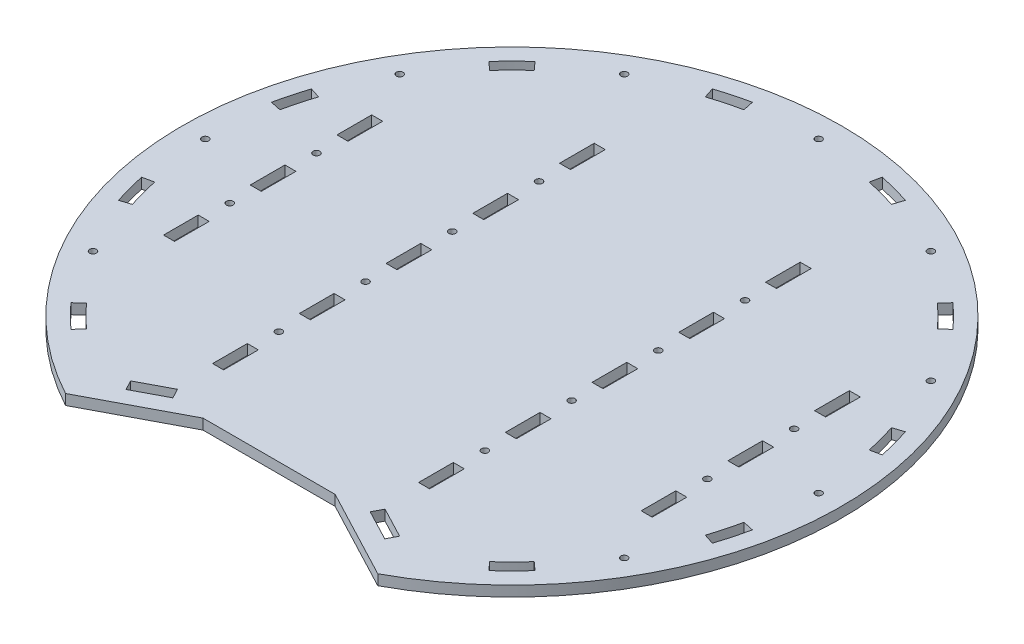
ISO-10303-21;
HEADER;
FILE_DESCRIPTION(('STEP AP214'),'2;1');
FILE_NAME('part.step','',(''),(''),'','','');
FILE_SCHEMA(('AUTOMOTIVE_DESIGN { 1 0 10303 214 1 1 1 1 }'));
ENDSEC;
DATA;
#1=APPLICATION_CONTEXT('core data for automotive mechanical design processes');
#2=APPLICATION_PROTOCOL_DEFINITION('international standard','automotive_design',2000,#1);
#3=PRODUCT_CONTEXT('',#1,'mechanical');
#4=PRODUCT('Part','Part','',(#3));
#5=PRODUCT_RELATED_PRODUCT_CATEGORY('part','',(#4));
#6=PRODUCT_DEFINITION_FORMATION('','',#4);
#7=PRODUCT_DEFINITION_CONTEXT('part definition',#1,'design');
#8=PRODUCT_DEFINITION('design','',#6,#7);
#9=PRODUCT_DEFINITION_SHAPE('','',#8);
#10=(LENGTH_UNIT() NAMED_UNIT(*) SI_UNIT(.MILLI.,.METRE.));
#11=(NAMED_UNIT(*) PLANE_ANGLE_UNIT() SI_UNIT($,.RADIAN.));
#12=(NAMED_UNIT(*) SI_UNIT($,.STERADIAN.) SOLID_ANGLE_UNIT());
#13=UNCERTAINTY_MEASURE_WITH_UNIT(LENGTH_MEASURE(1.E-05),#10,'distance_accuracy_value','');
#14=(GEOMETRIC_REPRESENTATION_CONTEXT(3) GLOBAL_UNCERTAINTY_ASSIGNED_CONTEXT((#13)) GLOBAL_UNIT_ASSIGNED_CONTEXT((#10,
#11,#12)) REPRESENTATION_CONTEXT('',''));
#15=CARTESIAN_POINT('',(0.,0.,0.));
#16=DIRECTION('',(0.,0.,1.));
#17=DIRECTION('',(1.,0.,0.));
#18=AXIS2_PLACEMENT_3D('',#15,#16,#17);
#19=CARTESIAN_POINT('',(0.,6.,0.));
#20=DIRECTION('',(-0.669130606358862,0.,-0.743144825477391));
#21=DIRECTION('',(-0.743144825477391,0.,0.669130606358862));
#22=AXIS2_PLACEMENT_3D('',#19,#20,#21);
#23=PLANE('',#22);
#24=DIRECTION('',(0.743144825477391,0.,-0.669130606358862));
#25=VECTOR('',#24,1.);
#26=CARTESIAN_POINT('',(0.,0.,0.));
#27=LINE('',#26,#25);
#28=CARTESIAN_POINT('',(129.047098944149,0.,-116.194529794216));
#29=VERTEX_POINT('',#28);
#30=CARTESIAN_POINT('',(133.766068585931,0.,-120.443509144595));
#31=VERTEX_POINT('',#30);
#32=EDGE_CURVE('E1324',#29,#31,#27,.T.);
#33=ORIENTED_EDGE('',*,*,#32,.F.);
#34=DIRECTION('',(0.,-1.,0.));
#35=VECTOR('',#34,1.);
#36=CARTESIAN_POINT('',(129.047098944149,6.,-116.194529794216));
#37=LINE('',#36,#35);
#38=CARTESIAN_POINT('',(129.047098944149,6.,-116.194529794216));
#39=VERTEX_POINT('',#38);
#40=EDGE_CURVE('E11',#39,#29,#37,.T.);
#41=ORIENTED_EDGE('',*,*,#40,.F.);
#42=DIRECTION('',(0.743144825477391,0.,-0.669130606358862));
#43=VECTOR('',#42,1.);
#44=CARTESIAN_POINT('',(0.,6.,0.));
#45=LINE('',#44,#43);
#46=CARTESIAN_POINT('',(133.766068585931,6.,-120.443509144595));
#47=VERTEX_POINT('',#46);
#48=EDGE_CURVE('E774',#39,#47,#45,.T.);
#49=ORIENTED_EDGE('',*,*,#48,.T.);
#50=DIRECTION('',(0.,-1.,0.));
#51=VECTOR('',#50,1.);
#52=CARTESIAN_POINT('',(133.766068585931,6.,-120.443509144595));
#53=LINE('',#52,#51);
#54=EDGE_CURVE('E65',#47,#31,#53,.T.);
#55=ORIENTED_EDGE('',*,*,#54,.T.);
#56=EDGE_LOOP('',(#33,#41,#49,#55));
#57=FACE_BOUND('',#56,.T.);
#58=ADVANCED_FACE('F45',(#57),#23,.T.);
#59=CARTESIAN_POINT('',(0.,6.,0.));
#60=DIRECTION('',(0.,-1.,0.));
#61=DIRECTION('',(0.,0.,-1.));
#62=AXIS2_PLACEMENT_3D('',#59,#60,#61);
#63=CYLINDRICAL_SURFACE('',#62,173.65);
#64=CARTESIAN_POINT('',(0.,0.,0.));
#65=DIRECTION('',(0.,1.,0.));
#66=DIRECTION('',(0.,0.,1.));
#67=AXIS2_PLACEMENT_3D('',#64,#65,#66);
#68=CIRCLE('',#67,173.65);
#69=CARTESIAN_POINT('',(116.194529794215,0.,-129.04709894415));
#70=VERTEX_POINT('',#69);
#71=EDGE_CURVE('E781',#29,#70,#68,.T.);
#72=ORIENTED_EDGE('',*,*,#71,.T.);
#73=DIRECTION('',(0.,-1.,0.));
#74=VECTOR('',#73,1.);
#75=CARTESIAN_POINT('',(116.194529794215,6.,-129.04709894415));
#76=LINE('',#75,#74);
#77=CARTESIAN_POINT('',(116.194529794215,6.,-129.04709894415));
#78=VERTEX_POINT('',#77);
#79=EDGE_CURVE('E56',#78,#70,#76,.T.);
#80=ORIENTED_EDGE('',*,*,#79,.F.);
#81=CARTESIAN_POINT('',(0.,6.,0.));
#82=DIRECTION('',(0.,1.,0.));
#83=DIRECTION('',(0.,0.,1.));
#84=AXIS2_PLACEMENT_3D('',#81,#82,#83);
#85=CIRCLE('',#84,173.65);
#86=EDGE_CURVE('E767',#39,#78,#85,.T.);
#87=ORIENTED_EDGE('',*,*,#86,.F.);
#88=ORIENTED_EDGE('',*,*,#40,.T.);
#89=EDGE_LOOP('',(#72,#80,#87,#88));
#90=FACE_BOUND('',#89,.T.);
#91=ADVANCED_FACE('F779',(#90),#63,.T.);
#92=CARTESIAN_POINT('',(-9.28188557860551E-13,6.,-8.35744731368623E-13));
#93=DIRECTION('',(0.743144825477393,0.,0.66913060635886));
#94=DIRECTION('',(0.66913060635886,0.,-0.743144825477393));
#95=AXIS2_PLACEMENT_3D('',#92,#93,#94);
#96=PLANE('',#95);
#97=DIRECTION('',(-0.66913060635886,0.,0.743144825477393));
#98=VECTOR('',#97,1.);
#99=CARTESIAN_POINT('',(-9.28188557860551E-13,0.,-8.35744731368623E-13));
#100=LINE('',#99,#98);
#101=CARTESIAN_POINT('',(120.443509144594,0.,-133.766068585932));
#102=VERTEX_POINT('',#101);
#103=EDGE_CURVE('E1329',#102,#70,#100,.T.);
#104=ORIENTED_EDGE('',*,*,#103,.F.);
#105=DIRECTION('',(0.,-1.,0.));
#106=VECTOR('',#105,1.);
#107=CARTESIAN_POINT('',(120.443509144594,6.,-133.766068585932));
#108=LINE('',#107,#106);
#109=CARTESIAN_POINT('',(120.443509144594,6.,-133.766068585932));
#110=VERTEX_POINT('',#109);
#111=EDGE_CURVE('E414',#110,#102,#108,.T.);
#112=ORIENTED_EDGE('',*,*,#111,.F.);
#113=DIRECTION('',(-0.66913060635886,0.,0.743144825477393));
#114=VECTOR('',#113,1.);
#115=CARTESIAN_POINT('',(-9.28188557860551E-13,6.,-8.35744731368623E-13));
#116=LINE('',#115,#114);
#117=EDGE_CURVE('E773',#110,#78,#116,.T.);
#118=ORIENTED_EDGE('',*,*,#117,.T.);
#119=ORIENTED_EDGE('',*,*,#79,.T.);
#120=EDGE_LOOP('',(#104,#112,#118,#119));
#121=FACE_BOUND('',#120,.T.);
#122=ADVANCED_FACE('F786',(#121),#96,.T.);
#123=CARTESIAN_POINT('',(0.,6.,2.17192397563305E-13));
#124=DIRECTION('',(-0.207911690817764,0.,-0.978147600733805));
#125=DIRECTION('',(-0.978147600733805,0.,0.207911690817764));
#126=AXIS2_PLACEMENT_3D('',#123,#124,#125);
#127=PLANE('',#126);
#128=DIRECTION('',(0.978147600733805,0.,-0.207911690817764));
#129=VECTOR('',#128,1.);
#130=CARTESIAN_POINT('',(0.,0.,2.17192397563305E-13));
#131=LINE('',#130,#129);
#132=CARTESIAN_POINT('',(169.855330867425,0.,-36.1038651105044));
#133=VERTEX_POINT('',#132);
#134=CARTESIAN_POINT('',(176.066568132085,0.,-37.4241043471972));
#135=VERTEX_POINT('',#134);
#136=EDGE_CURVE('E1308',#133,#135,#131,.T.);
#137=ORIENTED_EDGE('',*,*,#136,.F.);
#138=DIRECTION('',(0.,-1.,0.));
#139=VECTOR('',#138,1.);
#140=CARTESIAN_POINT('',(169.855330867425,6.,-36.1038651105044));
#141=LINE('',#140,#139);
#142=CARTESIAN_POINT('',(169.855330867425,6.,-36.1038651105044));
#143=VERTEX_POINT('',#142);
#144=EDGE_CURVE('E1359',#143,#133,#141,.T.);
#145=ORIENTED_EDGE('',*,*,#144,.F.);
#146=DIRECTION('',(0.978147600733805,0.,-0.207911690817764));
#147=VECTOR('',#146,1.);
#148=CARTESIAN_POINT('',(0.,6.,2.17192397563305E-13));
#149=LINE('',#148,#147);
#150=CARTESIAN_POINT('',(176.066568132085,6.,-37.4241043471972));
#151=VERTEX_POINT('',#150);
#152=EDGE_CURVE('E2142',#143,#151,#149,.T.);
#153=ORIENTED_EDGE('',*,*,#152,.T.);
#154=DIRECTION('',(0.,-1.,0.));
#155=VECTOR('',#154,1.);
#156=CARTESIAN_POINT('',(176.066568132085,6.,-37.4241043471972));
#157=LINE('',#156,#155);
#158=EDGE_CURVE('E1362',#151,#135,#157,.T.);
#159=ORIENTED_EDGE('',*,*,#158,.T.);
#160=EDGE_LOOP('',(#137,#145,#153,#159));
#161=FACE_BOUND('',#160,.T.);
#162=ADVANCED_FACE('F2188',(#161),#127,.T.);
#163=CARTESIAN_POINT('',(0.,6.,0.));
#164=DIRECTION('',(0.,-1.,0.));
#165=DIRECTION('',(0.,0.,-1.));
#166=AXIS2_PLACEMENT_3D('',#163,#164,#165);
#167=CYLINDRICAL_SURFACE('',#166,173.65);
#168=CARTESIAN_POINT('',(0.,0.,0.));
#169=DIRECTION('',(0.,1.,0.));
#170=DIRECTION('',(0.,0.,1.));
#171=AXIS2_PLACEMENT_3D('',#168,#169,#170);
#172=CIRCLE('',#171,173.65);
#173=CARTESIAN_POINT('',(165.150964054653,0.,-53.6608010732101));
#174=VERTEX_POINT('',#173);
#175=EDGE_CURVE('E1312',#133,#174,#172,.T.);
#176=ORIENTED_EDGE('',*,*,#175,.T.);
#177=DIRECTION('',(0.,-1.,0.));
#178=VECTOR('',#177,1.);
#179=CARTESIAN_POINT('',(165.150964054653,6.,-53.6608010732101));
#180=LINE('',#179,#178);
#181=CARTESIAN_POINT('',(165.150964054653,6.,-53.6608010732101));
#182=VERTEX_POINT('',#181);
#183=EDGE_CURVE('E1369',#182,#174,#180,.T.);
#184=ORIENTED_EDGE('',*,*,#183,.F.);
#185=CARTESIAN_POINT('',(0.,6.,0.));
#186=DIRECTION('',(0.,1.,0.));
#187=DIRECTION('',(0.,0.,1.));
#188=AXIS2_PLACEMENT_3D('',#185,#186,#187);
#189=CIRCLE('',#188,173.65);
#190=EDGE_CURVE('E2146',#143,#182,#189,.T.);
#191=ORIENTED_EDGE('',*,*,#190,.F.);
#192=ORIENTED_EDGE('',*,*,#144,.T.);
#193=EDGE_LOOP('',(#176,#184,#191,#192));
#194=FACE_BOUND('',#193,.T.);
#195=ADVANCED_FACE('F2184',(#194),#167,.T.);
#196=CARTESIAN_POINT('',(2.74891072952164E-12,6.,8.46027729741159E-12));
#197=DIRECTION('',(0.309016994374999,0.,0.951056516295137));
#198=DIRECTION('',(0.951056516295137,0.,-0.309016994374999));
#199=AXIS2_PLACEMENT_3D('',#196,#197,#198);
#200=PLANE('',#199);
#201=DIRECTION('',(-0.951056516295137,0.,0.309016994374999));
#202=VECTOR('',#201,1.);
#203=CARTESIAN_POINT('',(2.74891072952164E-12,0.,8.46027729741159E-12));
#204=LINE('',#203,#202);
#205=CARTESIAN_POINT('',(171.190172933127,0.,-55.6230589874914));
#206=VERTEX_POINT('',#205);
#207=EDGE_CURVE('E1316',#206,#174,#204,.T.);
#208=ORIENTED_EDGE('',*,*,#207,.F.);
#209=DIRECTION('',(0.,-1.,0.));
#210=VECTOR('',#209,1.);
#211=CARTESIAN_POINT('',(171.190172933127,6.,-55.6230589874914));
#212=LINE('',#211,#210);
#213=CARTESIAN_POINT('',(171.190172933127,6.,-55.6230589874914));
#214=VERTEX_POINT('',#213);
#215=EDGE_CURVE('E1365',#214,#206,#212,.T.);
#216=ORIENTED_EDGE('',*,*,#215,.F.);
#217=DIRECTION('',(-0.951056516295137,0.,0.309016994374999));
#218=VECTOR('',#217,1.);
#219=CARTESIAN_POINT('',(2.74891072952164E-12,6.,8.46027729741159E-12));
#220=LINE('',#219,#218);
#221=EDGE_CURVE('E2149',#214,#182,#220,.T.);
#222=ORIENTED_EDGE('',*,*,#221,.T.);
#223=ORIENTED_EDGE('',*,*,#183,.T.);
#224=EDGE_LOOP('',(#208,#216,#222,#223));
#225=FACE_BOUND('',#224,.T.);
#226=ADVANCED_FACE('F2180',(#225),#200,.T.);
#227=CARTESIAN_POINT('',(-3.50649010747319E-13,6.,3.15725787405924E-13));
#228=DIRECTION('',(0.743144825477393,0.,-0.66913060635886));
#229=DIRECTION('',(-0.66913060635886,0.,-0.743144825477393));
#230=AXIS2_PLACEMENT_3D('',#227,#228,#229);
#231=PLANE('',#230);
#232=DIRECTION('',(0.66913060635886,0.,0.743144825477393));
#233=VECTOR('',#232,1.);
#234=CARTESIAN_POINT('',(-3.50649010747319E-13,0.,3.15725787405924E-13));
#235=LINE('',#234,#233);
#236=CARTESIAN_POINT('',(116.194529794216,0.,129.04709894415));
#237=VERTEX_POINT('',#236);
#238=CARTESIAN_POINT('',(120.443509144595,0.,133.766068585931));
#239=VERTEX_POINT('',#238);
#240=EDGE_CURVE('E1292',#237,#239,#235,.T.);
#241=ORIENTED_EDGE('',*,*,#240,.F.);
#242=DIRECTION('',(0.,-1.,0.));
#243=VECTOR('',#242,1.);
#244=CARTESIAN_POINT('',(116.194529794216,6.,129.04709894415));
#245=LINE('',#244,#243);
#246=CARTESIAN_POINT('',(116.194529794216,6.,129.04709894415));
#247=VERTEX_POINT('',#246);
#248=EDGE_CURVE('E1366',#247,#237,#245,.T.);
#249=ORIENTED_EDGE('',*,*,#248,.F.);
#250=DIRECTION('',(0.66913060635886,0.,0.743144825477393));
#251=VECTOR('',#250,1.);
#252=CARTESIAN_POINT('',(-3.50649010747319E-13,6.,3.15725787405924E-13));
#253=LINE('',#252,#251);
#254=CARTESIAN_POINT('',(120.443509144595,6.,133.766068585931));
#255=VERTEX_POINT('',#254);
#256=EDGE_CURVE('E2127',#247,#255,#253,.T.);
#257=ORIENTED_EDGE('',*,*,#256,.T.);
#258=DIRECTION('',(0.,-1.,0.));
#259=VECTOR('',#258,1.);
#260=CARTESIAN_POINT('',(120.443509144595,6.,133.766068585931));
#261=LINE('',#260,#259);
#262=EDGE_CURVE('E1374',#255,#239,#261,.T.);
#263=ORIENTED_EDGE('',*,*,#262,.T.);
#264=EDGE_LOOP('',(#241,#249,#257,#263));
#265=FACE_BOUND('',#264,.T.);
#266=ADVANCED_FACE('F2183',(#265),#231,.T.);
#267=CARTESIAN_POINT('',(0.,6.,0.));
#268=DIRECTION('',(0.,-1.,0.));
#269=DIRECTION('',(0.,0.,-1.));
#270=AXIS2_PLACEMENT_3D('',#267,#268,#269);
#271=CYLINDRICAL_SURFACE('',#270,173.65);
#272=CARTESIAN_POINT('',(0.,0.,0.));
#273=DIRECTION('',(0.,1.,0.));
#274=DIRECTION('',(0.,0.,1.));
#275=AXIS2_PLACEMENT_3D('',#272,#273,#274);
#276=CIRCLE('',#275,173.65);
#277=CARTESIAN_POINT('',(129.047098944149,0.,116.194529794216));
#278=VERTEX_POINT('',#277);
#279=EDGE_CURVE('E1296',#237,#278,#276,.T.);
#280=ORIENTED_EDGE('',*,*,#279,.T.);
#281=DIRECTION('',(0.,-1.,0.));
#282=VECTOR('',#281,1.);
#283=CARTESIAN_POINT('',(129.047098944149,6.,116.194529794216));
#284=LINE('',#283,#282);
#285=CARTESIAN_POINT('',(129.047098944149,6.,116.194529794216));
#286=VERTEX_POINT('',#285);
#287=EDGE_CURVE('E1381',#286,#278,#284,.T.);
#288=ORIENTED_EDGE('',*,*,#287,.F.);
#289=CARTESIAN_POINT('',(0.,6.,0.));
#290=DIRECTION('',(0.,1.,0.));
#291=DIRECTION('',(0.,0.,1.));
#292=AXIS2_PLACEMENT_3D('',#289,#290,#291);
#293=CIRCLE('',#292,173.65);
#294=EDGE_CURVE('E2131',#247,#286,#293,.T.);
#295=ORIENTED_EDGE('',*,*,#294,.F.);
#296=ORIENTED_EDGE('',*,*,#248,.T.);
#297=EDGE_LOOP('',(#280,#288,#295,#296));
#298=FACE_BOUND('',#297,.T.);
#299=ADVANCED_FACE('F2201',(#298),#271,.T.);
#300=CARTESIAN_POINT('',(-5.55305943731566E-12,6.,6.16729730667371E-12));
#301=DIRECTION('',(-0.669130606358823,0.,0.743144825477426));
#302=DIRECTION('',(0.743144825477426,0.,0.669130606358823));
#303=AXIS2_PLACEMENT_3D('',#300,#301,#302);
#304=PLANE('',#303);
#305=DIRECTION('',(-0.743144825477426,0.,-0.669130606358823));
#306=VECTOR('',#305,1.);
#307=CARTESIAN_POINT('',(-5.55305943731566E-12,0.,6.16729730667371E-12));
#308=LINE('',#307,#306);
#309=CARTESIAN_POINT('',(133.766068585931,0.,120.443509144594));
#310=VERTEX_POINT('',#309);
#311=EDGE_CURVE('E1300',#310,#278,#308,.T.);
#312=ORIENTED_EDGE('',*,*,#311,.F.);
#313=DIRECTION('',(0.,-1.,0.));
#314=VECTOR('',#313,1.);
#315=CARTESIAN_POINT('',(133.766068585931,6.,120.443509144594));
#316=LINE('',#315,#314);
#317=CARTESIAN_POINT('',(133.766068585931,6.,120.443509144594));
#318=VERTEX_POINT('',#317);
#319=EDGE_CURVE('E1377',#318,#310,#316,.T.);
#320=ORIENTED_EDGE('',*,*,#319,.F.);
#321=DIRECTION('',(-0.743144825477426,0.,-0.669130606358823));
#322=VECTOR('',#321,1.);
#323=CARTESIAN_POINT('',(-5.55305943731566E-12,6.,6.16729730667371E-12));
#324=LINE('',#323,#322);
#325=EDGE_CURVE('E2134',#318,#286,#324,.T.);
#326=ORIENTED_EDGE('',*,*,#325,.T.);
#327=ORIENTED_EDGE('',*,*,#287,.T.);
#328=EDGE_LOOP('',(#312,#320,#326,#327));
#329=FACE_BOUND('',#328,.T.);
#330=ADVANCED_FACE('F2197',(#329),#304,.T.);
#331=CARTESIAN_POINT('',(62.5533280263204,6.,0.));
#332=DIRECTION('',(-1.,0.,0.));
#333=DIRECTION('',(0.,0.,1.));
#334=AXIS2_PLACEMENT_3D('',#331,#332,#333);
#335=PLANE('',#334);
#336=DIRECTION('',(0.,0.,-1.));
#337=VECTOR('',#336,1.);
#338=CARTESIAN_POINT('',(62.5533280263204,0.,0.));
#339=LINE('',#338,#337);
#340=CARTESIAN_POINT('',(62.5533280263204,0.,-40.));
#341=VERTEX_POINT('',#340);
#342=CARTESIAN_POINT('',(62.5533280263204,0.,-60.));
#343=VERTEX_POINT('',#342);
#344=EDGE_CURVE('E1276',#341,#343,#339,.T.);
#345=ORIENTED_EDGE('',*,*,#344,.F.);
#346=DIRECTION('',(0.,-1.,0.));
#347=VECTOR('',#346,1.);
#348=CARTESIAN_POINT('',(62.5533280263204,6.,-40.));
#349=LINE('',#348,#347);
#350=CARTESIAN_POINT('',(62.5533280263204,6.,-40.));
#351=VERTEX_POINT('',#350);
#352=EDGE_CURVE('E1378',#351,#341,#349,.T.);
#353=ORIENTED_EDGE('',*,*,#352,.F.);
#354=DIRECTION('',(0.,0.,-1.));
#355=VECTOR('',#354,1.);
#356=CARTESIAN_POINT('',(62.5533280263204,6.,0.));
#357=LINE('',#356,#355);
#358=CARTESIAN_POINT('',(62.5533280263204,6.,-60.));
#359=VERTEX_POINT('',#358);
#360=EDGE_CURVE('E2112',#351,#359,#357,.T.);
#361=ORIENTED_EDGE('',*,*,#360,.T.);
#362=DIRECTION('',(0.,-1.,0.));
#363=VECTOR('',#362,1.);
#364=CARTESIAN_POINT('',(62.5533280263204,6.,-60.));
#365=LINE('',#364,#363);
#366=EDGE_CURVE('E1386',#359,#343,#365,.T.);
#367=ORIENTED_EDGE('',*,*,#366,.T.);
#368=EDGE_LOOP('',(#345,#353,#361,#367));
#369=FACE_BOUND('',#368,.T.);
#370=ADVANCED_FACE('F2200',(#369),#335,.T.);
#371=CARTESIAN_POINT('',(0.,6.,-40.));
#372=DIRECTION('',(0.,0.,1.));
#373=DIRECTION('',(1.,0.,0.));
#374=AXIS2_PLACEMENT_3D('',#371,#372,#373);
#375=PLANE('',#374);
#376=DIRECTION('',(-1.,0.,0.));
#377=VECTOR('',#376,1.);
#378=CARTESIAN_POINT('',(0.,0.,-40.));
#379=LINE('',#378,#377);
#380=CARTESIAN_POINT('',(56.2033280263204,0.,-40.));
#381=VERTEX_POINT('',#380);
#382=EDGE_CURVE('E1280',#341,#381,#379,.T.);
#383=ORIENTED_EDGE('',*,*,#382,.T.);
#384=DIRECTION('',(0.,-1.,0.));
#385=VECTOR('',#384,1.);
#386=CARTESIAN_POINT('',(56.2033280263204,6.,-40.));
#387=LINE('',#386,#385);
#388=CARTESIAN_POINT('',(56.2033280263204,6.,-40.));
#389=VERTEX_POINT('',#388);
#390=EDGE_CURVE('E1393',#389,#381,#387,.T.);
#391=ORIENTED_EDGE('',*,*,#390,.F.);
#392=DIRECTION('',(-1.,0.,0.));
#393=VECTOR('',#392,1.);
#394=CARTESIAN_POINT('',(0.,6.,-40.));
#395=LINE('',#394,#393);
#396=EDGE_CURVE('E2116',#351,#389,#395,.T.);
#397=ORIENTED_EDGE('',*,*,#396,.F.);
#398=ORIENTED_EDGE('',*,*,#352,.T.);
#399=EDGE_LOOP('',(#383,#391,#397,#398));
#400=FACE_BOUND('',#399,.T.);
#401=ADVANCED_FACE('F2217',(#400),#375,.F.);
#402=CARTESIAN_POINT('',(56.2033280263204,6.,0.));
#403=DIRECTION('',(-1.,0.,0.));
#404=DIRECTION('',(0.,0.,1.));
#405=AXIS2_PLACEMENT_3D('',#402,#403,#404);
#406=PLANE('',#405);
#407=DIRECTION('',(0.,0.,-1.));
#408=VECTOR('',#407,1.);
#409=CARTESIAN_POINT('',(56.2033280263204,0.,0.));
#410=LINE('',#409,#408);
#411=CARTESIAN_POINT('',(56.2033280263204,0.,-60.));
#412=VERTEX_POINT('',#411);
#413=EDGE_CURVE('E1284',#381,#412,#410,.T.);
#414=ORIENTED_EDGE('',*,*,#413,.T.);
#415=DIRECTION('',(0.,-1.,0.));
#416=VECTOR('',#415,1.);
#417=CARTESIAN_POINT('',(56.2033280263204,6.,-60.));
#418=LINE('',#417,#416);
#419=CARTESIAN_POINT('',(56.2033280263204,6.,-60.));
#420=VERTEX_POINT('',#419);
#421=EDGE_CURVE('E1389',#420,#412,#418,.T.);
#422=ORIENTED_EDGE('',*,*,#421,.F.);
#423=DIRECTION('',(0.,0.,-1.));
#424=VECTOR('',#423,1.);
#425=CARTESIAN_POINT('',(56.2033280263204,6.,0.));
#426=LINE('',#425,#424);
#427=EDGE_CURVE('E2120',#389,#420,#426,.T.);
#428=ORIENTED_EDGE('',*,*,#427,.F.);
#429=ORIENTED_EDGE('',*,*,#390,.T.);
#430=EDGE_LOOP('',(#414,#422,#428,#429));
#431=FACE_BOUND('',#430,.T.);
#432=ADVANCED_FACE('F2213',(#431),#406,.F.);
#433=CARTESIAN_POINT('',(56.2033280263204,6.,0.));
#434=DIRECTION('',(1.,0.,0.));
#435=DIRECTION('',(0.,0.,-1.));
#436=AXIS2_PLACEMENT_3D('',#433,#434,#435);
#437=PLANE('',#436);
#438=DIRECTION('',(0.,0.,1.));
#439=VECTOR('',#438,1.);
#440=CARTESIAN_POINT('',(56.2033280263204,0.,0.));
#441=LINE('',#440,#439);
#442=CARTESIAN_POINT('',(56.2033280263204,0.,-10.));
#443=VERTEX_POINT('',#442);
#444=CARTESIAN_POINT('',(56.2033280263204,0.,10.));
#445=VERTEX_POINT('',#444);
#446=EDGE_CURVE('E1260',#443,#445,#441,.T.);
#447=ORIENTED_EDGE('',*,*,#446,.F.);
#448=DIRECTION('',(0.,-1.,0.));
#449=VECTOR('',#448,1.);
#450=CARTESIAN_POINT('',(56.2033280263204,6.,-10.));
#451=LINE('',#450,#449);
#452=CARTESIAN_POINT('',(56.2033280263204,6.,-10.));
#453=VERTEX_POINT('',#452);
#454=EDGE_CURVE('E1390',#453,#443,#451,.T.);
#455=ORIENTED_EDGE('',*,*,#454,.F.);
#456=DIRECTION('',(0.,0.,1.));
#457=VECTOR('',#456,1.);
#458=CARTESIAN_POINT('',(56.2033280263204,6.,0.));
#459=LINE('',#458,#457);
#460=CARTESIAN_POINT('',(56.2033280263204,6.,10.));
#461=VERTEX_POINT('',#460);
#462=EDGE_CURVE('E2097',#453,#461,#459,.T.);
#463=ORIENTED_EDGE('',*,*,#462,.T.);
#464=DIRECTION('',(0.,-1.,0.));
#465=VECTOR('',#464,1.);
#466=CARTESIAN_POINT('',(56.2033280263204,6.,10.));
#467=LINE('',#466,#465);
#468=EDGE_CURVE('E1399',#461,#445,#467,.T.);
#469=ORIENTED_EDGE('',*,*,#468,.T.);
#470=EDGE_LOOP('',(#447,#455,#463,#469));
#471=FACE_BOUND('',#470,.T.);
#472=ADVANCED_FACE('F2216',(#471),#437,.T.);
#473=CARTESIAN_POINT('',(0.,6.,-9.99999999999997));
#474=DIRECTION('',(0.,0.,-1.));
#475=DIRECTION('',(-1.,0.,0.));
#476=AXIS2_PLACEMENT_3D('',#473,#474,#475);
#477=PLANE('',#476);
#478=DIRECTION('',(1.,0.,0.));
#479=VECTOR('',#478,1.);
#480=CARTESIAN_POINT('',(0.,0.,-9.99999999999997));
#481=LINE('',#480,#479);
#482=CARTESIAN_POINT('',(62.5533280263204,0.,-10.));
#483=VERTEX_POINT('',#482);
#484=EDGE_CURVE('E1264',#443,#483,#481,.T.);
#485=ORIENTED_EDGE('',*,*,#484,.T.);
#486=DIRECTION('',(0.,-1.,0.));
#487=VECTOR('',#486,1.);
#488=CARTESIAN_POINT('',(62.5533280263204,6.,-10.));
#489=LINE('',#488,#487);
#490=CARTESIAN_POINT('',(62.5533280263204,6.,-10.));
#491=VERTEX_POINT('',#490);
#492=EDGE_CURVE('E1406',#491,#483,#489,.T.);
#493=ORIENTED_EDGE('',*,*,#492,.F.);
#494=DIRECTION('',(1.,0.,0.));
#495=VECTOR('',#494,1.);
#496=CARTESIAN_POINT('',(0.,6.,-9.99999999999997));
#497=LINE('',#496,#495);
#498=EDGE_CURVE('E2101',#453,#491,#497,.T.);
#499=ORIENTED_EDGE('',*,*,#498,.F.);
#500=ORIENTED_EDGE('',*,*,#454,.T.);
#501=EDGE_LOOP('',(#485,#493,#499,#500));
#502=FACE_BOUND('',#501,.T.);
#503=ADVANCED_FACE('F2233',(#502),#477,.F.);
#504=CARTESIAN_POINT('',(62.5533280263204,6.,0.));
#505=DIRECTION('',(1.,0.,0.));
#506=DIRECTION('',(0.,0.,-1.));
#507=AXIS2_PLACEMENT_3D('',#504,#505,#506);
#508=PLANE('',#507);
#509=DIRECTION('',(0.,0.,1.));
#510=VECTOR('',#509,1.);
#511=CARTESIAN_POINT('',(62.5533280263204,0.,0.));
#512=LINE('',#511,#510);
#513=CARTESIAN_POINT('',(62.5533280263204,0.,9.99999999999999));
#514=VERTEX_POINT('',#513);
#515=EDGE_CURVE('E1268',#483,#514,#512,.T.);
#516=ORIENTED_EDGE('',*,*,#515,.T.);
#517=DIRECTION('',(0.,-1.,0.));
#518=VECTOR('',#517,1.);
#519=CARTESIAN_POINT('',(62.5533280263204,6.,9.99999999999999));
#520=LINE('',#519,#518);
#521=CARTESIAN_POINT('',(62.5533280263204,6.,9.99999999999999));
#522=VERTEX_POINT('',#521);
#523=EDGE_CURVE('E1402',#522,#514,#520,.T.);
#524=ORIENTED_EDGE('',*,*,#523,.F.);
#525=DIRECTION('',(0.,0.,1.));
#526=VECTOR('',#525,1.);
#527=CARTESIAN_POINT('',(62.5533280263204,6.,0.));
#528=LINE('',#527,#526);
#529=EDGE_CURVE('E2105',#491,#522,#528,.T.);
#530=ORIENTED_EDGE('',*,*,#529,.F.);
#531=ORIENTED_EDGE('',*,*,#492,.T.);
#532=EDGE_LOOP('',(#516,#524,#530,#531));
#533=FACE_BOUND('',#532,.T.);
#534=ADVANCED_FACE('F2229',(#533),#508,.F.);
#535=CARTESIAN_POINT('',(62.5533280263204,6.,0.));
#536=DIRECTION('',(-1.,0.,0.));
#537=DIRECTION('',(0.,0.,1.));
#538=AXIS2_PLACEMENT_3D('',#535,#536,#537);
#539=PLANE('',#538);
#540=DIRECTION('',(0.,0.,-1.));
#541=VECTOR('',#540,1.);
#542=CARTESIAN_POINT('',(62.5533280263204,0.,0.));
#543=LINE('',#542,#541);
#544=CARTESIAN_POINT('',(62.5533280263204,0.,-90.));
#545=VERTEX_POINT('',#544);
#546=CARTESIAN_POINT('',(62.5533280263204,0.,-110.));
#547=VERTEX_POINT('',#546);
#548=EDGE_CURVE('E1244',#545,#547,#543,.T.);
#549=ORIENTED_EDGE('',*,*,#548,.F.);
#550=DIRECTION('',(0.,-1.,0.));
#551=VECTOR('',#550,1.);
#552=CARTESIAN_POINT('',(62.5533280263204,6.,-90.));
#553=LINE('',#552,#551);
#554=CARTESIAN_POINT('',(62.5533280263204,6.,-90.));
#555=VERTEX_POINT('',#554);
#556=EDGE_CURVE('E1403',#555,#545,#553,.T.);
#557=ORIENTED_EDGE('',*,*,#556,.F.);
#558=DIRECTION('',(0.,0.,-1.));
#559=VECTOR('',#558,1.);
#560=CARTESIAN_POINT('',(62.5533280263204,6.,0.));
#561=LINE('',#560,#559);
#562=CARTESIAN_POINT('',(62.5533280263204,6.,-110.));
#563=VERTEX_POINT('',#562);
#564=EDGE_CURVE('E2082',#555,#563,#561,.T.);
#565=ORIENTED_EDGE('',*,*,#564,.T.);
#566=DIRECTION('',(0.,-1.,0.));
#567=VECTOR('',#566,1.);
#568=CARTESIAN_POINT('',(62.5533280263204,6.,-110.));
#569=LINE('',#568,#567);
#570=EDGE_CURVE('E1412',#563,#547,#569,.T.);
#571=ORIENTED_EDGE('',*,*,#570,.T.);
#572=EDGE_LOOP('',(#549,#557,#565,#571));
#573=FACE_BOUND('',#572,.T.);
#574=ADVANCED_FACE('F2232',(#573),#539,.T.);
#575=CARTESIAN_POINT('',(0.,6.,-90.));
#576=DIRECTION('',(0.,0.,1.));
#577=DIRECTION('',(1.,0.,0.));
#578=AXIS2_PLACEMENT_3D('',#575,#576,#577);
#579=PLANE('',#578);
#580=DIRECTION('',(-1.,0.,0.));
#581=VECTOR('',#580,1.);
#582=CARTESIAN_POINT('',(0.,0.,-90.));
#583=LINE('',#582,#581);
#584=CARTESIAN_POINT('',(56.2033280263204,0.,-90.));
#585=VERTEX_POINT('',#584);
#586=EDGE_CURVE('E1248',#545,#585,#583,.T.);
#587=ORIENTED_EDGE('',*,*,#586,.T.);
#588=DIRECTION('',(0.,-1.,0.));
#589=VECTOR('',#588,1.);
#590=CARTESIAN_POINT('',(56.2033280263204,6.,-90.));
#591=LINE('',#590,#589);
#592=CARTESIAN_POINT('',(56.2033280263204,6.,-90.));
#593=VERTEX_POINT('',#592);
#594=EDGE_CURVE('E1419',#593,#585,#591,.T.);
#595=ORIENTED_EDGE('',*,*,#594,.F.);
#596=DIRECTION('',(-1.,0.,0.));
#597=VECTOR('',#596,1.);
#598=CARTESIAN_POINT('',(0.,6.,-90.));
#599=LINE('',#598,#597);
#600=EDGE_CURVE('E2086',#555,#593,#599,.T.);
#601=ORIENTED_EDGE('',*,*,#600,.F.);
#602=ORIENTED_EDGE('',*,*,#556,.T.);
#603=EDGE_LOOP('',(#587,#595,#601,#602));
#604=FACE_BOUND('',#603,.T.);
#605=ADVANCED_FACE('F2249',(#604),#579,.F.);
#606=CARTESIAN_POINT('',(56.2033280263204,6.,0.));
#607=DIRECTION('',(-1.,0.,0.));
#608=DIRECTION('',(0.,0.,1.));
#609=AXIS2_PLACEMENT_3D('',#606,#607,#608);
#610=PLANE('',#609);
#611=DIRECTION('',(0.,0.,-1.));
#612=VECTOR('',#611,1.);
#613=CARTESIAN_POINT('',(56.2033280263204,0.,0.));
#614=LINE('',#613,#612);
#615=CARTESIAN_POINT('',(56.2033280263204,0.,-110.));
#616=VERTEX_POINT('',#615);
#617=EDGE_CURVE('E1252',#585,#616,#614,.T.);
#618=ORIENTED_EDGE('',*,*,#617,.T.);
#619=DIRECTION('',(0.,-1.,0.));
#620=VECTOR('',#619,1.);
#621=CARTESIAN_POINT('',(56.2033280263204,6.,-110.));
#622=LINE('',#621,#620);
#623=CARTESIAN_POINT('',(56.2033280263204,6.,-110.));
#624=VERTEX_POINT('',#623);
#625=EDGE_CURVE('E1415',#624,#616,#622,.T.);
#626=ORIENTED_EDGE('',*,*,#625,.F.);
#627=DIRECTION('',(0.,0.,-1.));
#628=VECTOR('',#627,1.);
#629=CARTESIAN_POINT('',(56.2033280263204,6.,0.));
#630=LINE('',#629,#628);
#631=EDGE_CURVE('E2090',#593,#624,#630,.T.);
#632=ORIENTED_EDGE('',*,*,#631,.F.);
#633=ORIENTED_EDGE('',*,*,#594,.T.);
#634=EDGE_LOOP('',(#618,#626,#632,#633));
#635=FACE_BOUND('',#634,.T.);
#636=ADVANCED_FACE('F2245',(#635),#610,.F.);
#637=CARTESIAN_POINT('',(0.,6.,90.));
#638=DIRECTION('',(0.,0.,1.));
#639=DIRECTION('',(1.,0.,0.));
#640=AXIS2_PLACEMENT_3D('',#637,#638,#639);
#641=PLANE('',#640);
#642=DIRECTION('',(-1.,0.,0.));
#643=VECTOR('',#642,1.);
#644=CARTESIAN_POINT('',(0.,0.,90.));
#645=LINE('',#644,#643);
#646=CARTESIAN_POINT('',(62.5533280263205,0.,90.));
#647=VERTEX_POINT('',#646);
#648=CARTESIAN_POINT('',(56.2033280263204,0.,90.));
#649=VERTEX_POINT('',#648);
#650=EDGE_CURVE('E1228',#647,#649,#645,.T.);
#651=ORIENTED_EDGE('',*,*,#650,.F.);
#652=DIRECTION('',(0.,-1.,0.));
#653=VECTOR('',#652,1.);
#654=CARTESIAN_POINT('',(62.5533280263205,6.,90.));
#655=LINE('',#654,#653);
#656=CARTESIAN_POINT('',(62.5533280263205,6.,90.));
#657=VERTEX_POINT('',#656);
#658=EDGE_CURVE('E1416',#657,#647,#655,.T.);
#659=ORIENTED_EDGE('',*,*,#658,.F.);
#660=DIRECTION('',(-1.,0.,0.));
#661=VECTOR('',#660,1.);
#662=CARTESIAN_POINT('',(0.,6.,90.));
#663=LINE('',#662,#661);
#664=CARTESIAN_POINT('',(56.2033280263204,6.,90.));
#665=VERTEX_POINT('',#664);
#666=EDGE_CURVE('E2067',#657,#665,#663,.T.);
#667=ORIENTED_EDGE('',*,*,#666,.T.);
#668=DIRECTION('',(0.,-1.,0.));
#669=VECTOR('',#668,1.);
#670=CARTESIAN_POINT('',(56.2033280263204,6.,90.));
#671=LINE('',#670,#669);
#672=EDGE_CURVE('E1425',#665,#649,#671,.T.);
#673=ORIENTED_EDGE('',*,*,#672,.T.);
#674=EDGE_LOOP('',(#651,#659,#667,#673));
#675=FACE_BOUND('',#674,.T.);
#676=ADVANCED_FACE('F2248',(#675),#641,.T.);
#677=CARTESIAN_POINT('',(62.5533280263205,6.,0.));
#678=DIRECTION('',(1.,0.,0.));
#679=DIRECTION('',(0.,0.,-1.));
#680=AXIS2_PLACEMENT_3D('',#677,#678,#679);
#681=PLANE('',#680);
#682=DIRECTION('',(0.,0.,1.));
#683=VECTOR('',#682,1.);
#684=CARTESIAN_POINT('',(62.5533280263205,0.,0.));
#685=LINE('',#684,#683);
#686=CARTESIAN_POINT('',(62.5533280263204,0.,110.));
#687=VERTEX_POINT('',#686);
#688=EDGE_CURVE('E1232',#647,#687,#685,.T.);
#689=ORIENTED_EDGE('',*,*,#688,.T.);
#690=DIRECTION('',(0.,-1.,0.));
#691=VECTOR('',#690,1.);
#692=CARTESIAN_POINT('',(62.5533280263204,6.,110.));
#693=LINE('',#692,#691);
#694=CARTESIAN_POINT('',(62.5533280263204,6.,110.));
#695=VERTEX_POINT('',#694);
#696=EDGE_CURVE('E1432',#695,#687,#693,.T.);
#697=ORIENTED_EDGE('',*,*,#696,.F.);
#698=DIRECTION('',(0.,0.,1.));
#699=VECTOR('',#698,1.);
#700=CARTESIAN_POINT('',(62.5533280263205,6.,0.));
#701=LINE('',#700,#699);
#702=EDGE_CURVE('E2071',#657,#695,#701,.T.);
#703=ORIENTED_EDGE('',*,*,#702,.F.);
#704=ORIENTED_EDGE('',*,*,#658,.T.);
#705=EDGE_LOOP('',(#689,#697,#703,#704));
#706=FACE_BOUND('',#705,.T.);
#707=ADVANCED_FACE('F2265',(#706),#681,.F.);
#708=CARTESIAN_POINT('',(0.,6.,110.));
#709=DIRECTION('',(0.,0.,1.));
#710=DIRECTION('',(1.,0.,0.));
#711=AXIS2_PLACEMENT_3D('',#708,#709,#710);
#712=PLANE('',#711);
#713=DIRECTION('',(-1.,0.,0.));
#714=VECTOR('',#713,1.);
#715=CARTESIAN_POINT('',(0.,0.,110.));
#716=LINE('',#715,#714);
#717=CARTESIAN_POINT('',(56.2033280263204,0.,110.));
#718=VERTEX_POINT('',#717);
#719=EDGE_CURVE('E1236',#687,#718,#716,.T.);
#720=ORIENTED_EDGE('',*,*,#719,.T.);
#721=DIRECTION('',(0.,-1.,0.));
#722=VECTOR('',#721,1.);
#723=CARTESIAN_POINT('',(56.2033280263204,6.,110.));
#724=LINE('',#723,#722);
#725=CARTESIAN_POINT('',(56.2033280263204,6.,110.));
#726=VERTEX_POINT('',#725);
#727=EDGE_CURVE('E1428',#726,#718,#724,.T.);
#728=ORIENTED_EDGE('',*,*,#727,.F.);
#729=DIRECTION('',(-1.,0.,0.));
#730=VECTOR('',#729,1.);
#731=CARTESIAN_POINT('',(0.,6.,110.));
#732=LINE('',#731,#730);
#733=EDGE_CURVE('E2075',#695,#726,#732,.T.);
#734=ORIENTED_EDGE('',*,*,#733,.F.);
#735=ORIENTED_EDGE('',*,*,#696,.T.);
#736=EDGE_LOOP('',(#720,#728,#734,#735));
#737=FACE_BOUND('',#736,.T.);
#738=ADVANCED_FACE('F2261',(#737),#712,.F.);
#739=CARTESIAN_POINT('',(0.,6.,90.));
#740=DIRECTION('',(0.,0.,-1.));
#741=DIRECTION('',(-1.,0.,0.));
#742=AXIS2_PLACEMENT_3D('',#739,#740,#741);
#743=PLANE('',#742);
#744=DIRECTION('',(1.,0.,0.));
#745=VECTOR('',#744,1.);
#746=CARTESIAN_POINT('',(0.,0.,90.));
#747=LINE('',#746,#745);
#748=CARTESIAN_POINT('',(-62.5533280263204,0.,90.));
#749=VERTEX_POINT('',#748);
#750=CARTESIAN_POINT('',(-56.2033280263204,0.,90.));
#751=VERTEX_POINT('',#750);
#752=EDGE_CURVE('E1212',#749,#751,#747,.T.);
#753=ORIENTED_EDGE('',*,*,#752,.T.);
#754=DIRECTION('',(0.,-1.,0.));
#755=VECTOR('',#754,1.);
#756=CARTESIAN_POINT('',(-56.2033280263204,6.,90.));
#757=LINE('',#756,#755);
#758=CARTESIAN_POINT('',(-56.2033280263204,6.,90.));
#759=VERTEX_POINT('',#758);
#760=EDGE_CURVE('E1429',#759,#751,#757,.T.);
#761=ORIENTED_EDGE('',*,*,#760,.F.);
#762=DIRECTION('',(1.,0.,0.));
#763=VECTOR('',#762,1.);
#764=CARTESIAN_POINT('',(0.,6.,90.));
#765=LINE('',#764,#763);
#766=CARTESIAN_POINT('',(-62.5533280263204,6.,90.));
#767=VERTEX_POINT('',#766);
#768=EDGE_CURVE('E2052',#767,#759,#765,.T.);
#769=ORIENTED_EDGE('',*,*,#768,.F.);
#770=DIRECTION('',(0.,-1.,0.));
#771=VECTOR('',#770,1.);
#772=CARTESIAN_POINT('',(-62.5533280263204,6.,90.));
#773=LINE('',#772,#771);
#774=EDGE_CURVE('E1438',#767,#749,#773,.T.);
#775=ORIENTED_EDGE('',*,*,#774,.T.);
#776=EDGE_LOOP('',(#753,#761,#769,#775));
#777=FACE_BOUND('',#776,.T.);
#778=ADVANCED_FACE('F2264',(#777),#743,.F.);
#779=CARTESIAN_POINT('',(-56.2033280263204,6.,0.));
#780=DIRECTION('',(1.,0.,0.));
#781=DIRECTION('',(0.,0.,-1.));
#782=AXIS2_PLACEMENT_3D('',#779,#780,#781);
#783=PLANE('',#782);
#784=DIRECTION('',(0.,0.,1.));
#785=VECTOR('',#784,1.);
#786=CARTESIAN_POINT('',(-56.2033280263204,0.,0.));
#787=LINE('',#786,#785);
#788=CARTESIAN_POINT('',(-56.2033280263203,0.,110.));
#789=VERTEX_POINT('',#788);
#790=EDGE_CURVE('E1216',#751,#789,#787,.T.);
#791=ORIENTED_EDGE('',*,*,#790,.T.);
#792=DIRECTION('',(0.,-1.,0.));
#793=VECTOR('',#792,1.);
#794=CARTESIAN_POINT('',(-56.2033280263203,6.,110.));
#795=LINE('',#794,#793);
#796=CARTESIAN_POINT('',(-56.2033280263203,6.,110.));
#797=VERTEX_POINT('',#796);
#798=EDGE_CURVE('E1445',#797,#789,#795,.T.);
#799=ORIENTED_EDGE('',*,*,#798,.F.);
#800=DIRECTION('',(0.,0.,1.));
#801=VECTOR('',#800,1.);
#802=CARTESIAN_POINT('',(-56.2033280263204,6.,0.));
#803=LINE('',#802,#801);
#804=EDGE_CURVE('E2056',#759,#797,#803,.T.);
#805=ORIENTED_EDGE('',*,*,#804,.F.);
#806=ORIENTED_EDGE('',*,*,#760,.T.);
#807=EDGE_LOOP('',(#791,#799,#805,#806));
#808=FACE_BOUND('',#807,.T.);
#809=ADVANCED_FACE('F2281',(#808),#783,.F.);
#810=CARTESIAN_POINT('',(0.,6.,110.));
#811=DIRECTION('',(0.,0.,-1.));
#812=DIRECTION('',(-1.,0.,0.));
#813=AXIS2_PLACEMENT_3D('',#810,#811,#812);
#814=PLANE('',#813);
#815=DIRECTION('',(1.,0.,0.));
#816=VECTOR('',#815,1.);
#817=CARTESIAN_POINT('',(0.,0.,110.));
#818=LINE('',#817,#816);
#819=CARTESIAN_POINT('',(-62.5533280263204,0.,110.));
#820=VERTEX_POINT('',#819);
#821=EDGE_CURVE('E1220',#820,#789,#818,.T.);
#822=ORIENTED_EDGE('',*,*,#821,.F.);
#823=DIRECTION('',(0.,-1.,0.));
#824=VECTOR('',#823,1.);
#825=CARTESIAN_POINT('',(-62.5533280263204,6.,110.));
#826=LINE('',#825,#824);
#827=CARTESIAN_POINT('',(-62.5533280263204,6.,110.));
#828=VERTEX_POINT('',#827);
#829=EDGE_CURVE('E1441',#828,#820,#826,.T.);
#830=ORIENTED_EDGE('',*,*,#829,.F.);
#831=DIRECTION('',(1.,0.,0.));
#832=VECTOR('',#831,1.);
#833=CARTESIAN_POINT('',(0.,6.,110.));
#834=LINE('',#833,#832);
#835=EDGE_CURVE('E2059',#828,#797,#834,.T.);
#836=ORIENTED_EDGE('',*,*,#835,.T.);
#837=ORIENTED_EDGE('',*,*,#798,.T.);
#838=EDGE_LOOP('',(#822,#830,#836,#837));
#839=FACE_BOUND('',#838,.T.);
#840=ADVANCED_FACE('F2277',(#839),#814,.T.);
#841=CARTESIAN_POINT('',(0.,6.,40.));
#842=DIRECTION('',(0.,0.,-1.));
#843=DIRECTION('',(-1.,0.,0.));
#844=AXIS2_PLACEMENT_3D('',#841,#842,#843);
#845=PLANE('',#844);
#846=DIRECTION('',(1.,0.,0.));
#847=VECTOR('',#846,1.);
#848=CARTESIAN_POINT('',(0.,0.,40.));
#849=LINE('',#848,#847);
#850=CARTESIAN_POINT('',(-62.5533280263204,0.,40.));
#851=VERTEX_POINT('',#850);
#852=CARTESIAN_POINT('',(-56.2033280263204,0.,40.));
#853=VERTEX_POINT('',#852);
#854=EDGE_CURVE('E1196',#851,#853,#849,.T.);
#855=ORIENTED_EDGE('',*,*,#854,.T.);
#856=DIRECTION('',(0.,-1.,0.));
#857=VECTOR('',#856,1.);
#858=CARTESIAN_POINT('',(-56.2033280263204,6.,40.));
#859=LINE('',#858,#857);
#860=CARTESIAN_POINT('',(-56.2033280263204,6.,40.));
#861=VERTEX_POINT('',#860);
#862=EDGE_CURVE('E1442',#861,#853,#859,.T.);
#863=ORIENTED_EDGE('',*,*,#862,.F.);
#864=DIRECTION('',(1.,0.,0.));
#865=VECTOR('',#864,1.);
#866=CARTESIAN_POINT('',(0.,6.,40.));
#867=LINE('',#866,#865);
#868=CARTESIAN_POINT('',(-62.5533280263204,6.,40.));
#869=VERTEX_POINT('',#868);
#870=EDGE_CURVE('E2037',#869,#861,#867,.T.);
#871=ORIENTED_EDGE('',*,*,#870,.F.);
#872=DIRECTION('',(0.,-1.,0.));
#873=VECTOR('',#872,1.);
#874=CARTESIAN_POINT('',(-62.5533280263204,6.,40.));
#875=LINE('',#874,#873);
#876=EDGE_CURVE('E1451',#869,#851,#875,.T.);
#877=ORIENTED_EDGE('',*,*,#876,.T.);
#878=EDGE_LOOP('',(#855,#863,#871,#877));
#879=FACE_BOUND('',#878,.T.);
#880=ADVANCED_FACE('F2280',(#879),#845,.F.);
#881=CARTESIAN_POINT('',(-56.2033280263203,6.,0.));
#882=DIRECTION('',(1.,0.,0.));
#883=DIRECTION('',(0.,0.,-1.));
#884=AXIS2_PLACEMENT_3D('',#881,#882,#883);
#885=PLANE('',#884);
#886=DIRECTION('',(0.,0.,1.));
#887=VECTOR('',#886,1.);
#888=CARTESIAN_POINT('',(-56.2033280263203,0.,0.));
#889=LINE('',#888,#887);
#890=CARTESIAN_POINT('',(-56.2033280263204,0.,60.));
#891=VERTEX_POINT('',#890);
#892=EDGE_CURVE('E1200',#853,#891,#889,.T.);
#893=ORIENTED_EDGE('',*,*,#892,.T.);
#894=DIRECTION('',(0.,-1.,0.));
#895=VECTOR('',#894,1.);
#896=CARTESIAN_POINT('',(-56.2033280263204,6.,60.));
#897=LINE('',#896,#895);
#898=CARTESIAN_POINT('',(-56.2033280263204,6.,60.));
#899=VERTEX_POINT('',#898);
#900=EDGE_CURVE('E1458',#899,#891,#897,.T.);
#901=ORIENTED_EDGE('',*,*,#900,.F.);
#902=DIRECTION('',(0.,0.,1.));
#903=VECTOR('',#902,1.);
#904=CARTESIAN_POINT('',(-56.2033280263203,6.,0.));
#905=LINE('',#904,#903);
#906=EDGE_CURVE('E2041',#861,#899,#905,.T.);
#907=ORIENTED_EDGE('',*,*,#906,.F.);
#908=ORIENTED_EDGE('',*,*,#862,.T.);
#909=EDGE_LOOP('',(#893,#901,#907,#908));
#910=FACE_BOUND('',#909,.T.);
#911=ADVANCED_FACE('F2297',(#910),#885,.F.);
#912=CARTESIAN_POINT('',(0.,6.,60.));
#913=DIRECTION('',(0.,0.,-1.));
#914=DIRECTION('',(-1.,0.,0.));
#915=AXIS2_PLACEMENT_3D('',#912,#913,#914);
#916=PLANE('',#915);
#917=DIRECTION('',(1.,0.,0.));
#918=VECTOR('',#917,1.);
#919=CARTESIAN_POINT('',(0.,0.,60.));
#920=LINE('',#919,#918);
#921=CARTESIAN_POINT('',(-62.5533280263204,0.,60.));
#922=VERTEX_POINT('',#921);
#923=EDGE_CURVE('E1204',#922,#891,#920,.T.);
#924=ORIENTED_EDGE('',*,*,#923,.F.);
#925=DIRECTION('',(0.,-1.,0.));
#926=VECTOR('',#925,1.);
#927=CARTESIAN_POINT('',(-62.5533280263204,6.,60.));
#928=LINE('',#927,#926);
#929=CARTESIAN_POINT('',(-62.5533280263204,6.,60.));
#930=VERTEX_POINT('',#929);
#931=EDGE_CURVE('E1454',#930,#922,#928,.T.);
#932=ORIENTED_EDGE('',*,*,#931,.F.);
#933=DIRECTION('',(1.,0.,0.));
#934=VECTOR('',#933,1.);
#935=CARTESIAN_POINT('',(0.,6.,60.));
#936=LINE('',#935,#934);
#937=EDGE_CURVE('E2044',#930,#899,#936,.T.);
#938=ORIENTED_EDGE('',*,*,#937,.T.);
#939=ORIENTED_EDGE('',*,*,#900,.T.);
#940=EDGE_LOOP('',(#924,#932,#938,#939));
#941=FACE_BOUND('',#940,.T.);
#942=ADVANCED_FACE('F2293',(#941),#916,.T.);
#943=CARTESIAN_POINT('',(101.667360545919,6.,53.5409024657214));
#944=DIRECTION('',(-0.884804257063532,0.,-0.465962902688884));
#945=DIRECTION('',(-0.465962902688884,0.,0.884804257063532));
#946=AXIS2_PLACEMENT_3D('',#943,#944,#945);
#947=PLANE('',#946);
#948=DIRECTION('',(0.465962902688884,0.,-0.884804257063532));
#949=VECTOR('',#948,1.);
#950=CARTESIAN_POINT('',(101.667360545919,0.,53.5409024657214));
#951=LINE('',#950,#949);
#952=CARTESIAN_POINT('',(56.8792815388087,0.,138.587765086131));
#953=VERTEX_POINT('',#952);
#954=CARTESIAN_POINT('',(59.8381459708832,0.,132.969258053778));
#955=VERTEX_POINT('',#954);
#956=EDGE_CURVE('E1183',#953,#955,#951,.T.);
#957=ORIENTED_EDGE('',*,*,#956,.T.);
#958=DIRECTION('',(0.,-1.,0.));
#959=VECTOR('',#958,1.);
#960=CARTESIAN_POINT('',(59.8381459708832,6.,132.969258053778));
#961=LINE('',#960,#959);
#962=CARTESIAN_POINT('',(59.8381459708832,6.,132.969258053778));
#963=VERTEX_POINT('',#962);
#964=EDGE_CURVE('E1455',#963,#955,#961,.T.);
#965=ORIENTED_EDGE('',*,*,#964,.F.);
#966=DIRECTION('',(0.465962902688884,0.,-0.884804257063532));
#967=VECTOR('',#966,1.);
#968=CARTESIAN_POINT('',(101.667360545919,6.,53.5409024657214));
#969=LINE('',#968,#967);
#970=CARTESIAN_POINT('',(56.8792815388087,6.,138.587765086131));
#971=VERTEX_POINT('',#970);
#972=EDGE_CURVE('E2024',#971,#963,#969,.T.);
#973=ORIENTED_EDGE('',*,*,#972,.F.);
#974=DIRECTION('',(0.,-1.,0.));
#975=VECTOR('',#974,1.);
#976=CARTESIAN_POINT('',(56.8792815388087,6.,138.587765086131));
#977=LINE('',#976,#975);
#978=EDGE_CURVE('E1464',#971,#953,#977,.T.);
#979=ORIENTED_EDGE('',*,*,#978,.T.);
#980=EDGE_LOOP('',(#957,#965,#973,#979));
#981=FACE_BOUND('',#980,.T.);
#982=ADVANCED_FACE('F2296',(#981),#947,.F.);
#983=CARTESIAN_POINT('',(-41.8292145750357,6.,79.4283555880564));
#984=DIRECTION('',(0.465962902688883,0.,-0.884804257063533));
#985=DIRECTION('',(-0.884804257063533,0.,-0.465962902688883));
#986=AXIS2_PLACEMENT_3D('',#983,#984,#985);
#987=PLANE('',#986);
#988=DIRECTION('',(0.884804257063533,0.,0.465962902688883));
#989=VECTOR('',#988,1.);
#990=CARTESIAN_POINT('',(-41.8292145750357,0.,79.4283555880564));
#991=LINE('',#990,#989);
#992=CARTESIAN_POINT('',(77.5342311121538,0.,142.288516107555));
#993=VERTEX_POINT('',#992);
#994=EDGE_CURVE('E1187',#955,#993,#991,.T.);
#995=ORIENTED_EDGE('',*,*,#994,.T.);
#996=DIRECTION('',(0.,-1.,0.));
#997=VECTOR('',#996,1.);
#998=CARTESIAN_POINT('',(77.5342311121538,6.,142.288516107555));
#999=LINE('',#998,#997);
#1000=CARTESIAN_POINT('',(77.5342311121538,6.,142.288516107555));
#1001=VERTEX_POINT('',#1000);
#1002=EDGE_CURVE('E1473',#1001,#993,#999,.T.);
#1003=ORIENTED_EDGE('',*,*,#1002,.F.);
#1004=DIRECTION('',(0.884804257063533,0.,0.465962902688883));
#1005=VECTOR('',#1004,1.);
#1006=CARTESIAN_POINT('',(-41.8292145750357,6.,79.4283555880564));
#1007=LINE('',#1006,#1005);
#1008=EDGE_CURVE('E2028',#963,#1001,#1007,.T.);
#1009=ORIENTED_EDGE('',*,*,#1008,.F.);
#1010=ORIENTED_EDGE('',*,*,#964,.T.);
#1011=EDGE_LOOP('',(#995,#1003,#1009,#1010));
#1012=FACE_BOUND('',#1011,.T.);
#1013=ADVANCED_FACE('F2313',(#1012),#987,.F.);
#1014=CARTESIAN_POINT('',(119.36344568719,6.,62.8601605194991));
#1015=DIRECTION('',(0.884804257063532,0.,0.465962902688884));
#1016=DIRECTION('',(0.465962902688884,0.,-0.884804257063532));
#1017=AXIS2_PLACEMENT_3D('',#1014,#1015,#1016);
#1018=PLANE('',#1017);
#1019=DIRECTION('',(-0.465962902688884,0.,0.884804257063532));
#1020=VECTOR('',#1019,1.);
#1021=CARTESIAN_POINT('',(119.36344568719,0.,62.8601605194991));
#1022=LINE('',#1021,#1020);
#1023=CARTESIAN_POINT('',(74.5753666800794,0.,147.907023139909));
#1024=VERTEX_POINT('',#1023);
#1025=EDGE_CURVE('E1190',#993,#1024,#1022,.T.);
#1026=ORIENTED_EDGE('',*,*,#1025,.T.);
#1027=DIRECTION('',(0.,-1.,0.));
#1028=VECTOR('',#1027,1.);
#1029=CARTESIAN_POINT('',(74.5753666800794,6.,147.907023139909));
#1030=LINE('',#1029,#1028);
#1031=CARTESIAN_POINT('',(74.5753666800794,6.,147.907023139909));
#1032=VERTEX_POINT('',#1031);
#1033=EDGE_CURVE('E1468',#1032,#1024,#1030,.T.);
#1034=ORIENTED_EDGE('',*,*,#1033,.F.);
#1035=DIRECTION('',(-0.465962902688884,0.,0.884804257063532));
#1036=VECTOR('',#1035,1.);
#1037=CARTESIAN_POINT('',(119.36344568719,6.,62.8601605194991));
#1038=LINE('',#1037,#1036);
#1039=EDGE_CURVE('E2031',#1001,#1032,#1038,.T.);
#1040=ORIENTED_EDGE('',*,*,#1039,.F.);
#1041=ORIENTED_EDGE('',*,*,#1002,.T.);
#1042=EDGE_LOOP('',(#1026,#1034,#1040,#1041));
#1043=FACE_BOUND('',#1042,.T.);
#1044=ADVANCED_FACE('F2309',(#1043),#1018,.F.);
#1045=CARTESIAN_POINT('',(134.5,6.,0.));
#1046=DIRECTION('',(1.,0.,0.));
#1047=DIRECTION('',(0.,0.,-1.));
#1048=AXIS2_PLACEMENT_3D('',#1045,#1046,#1047);
#1049=PLANE('',#1048);
#1050=DIRECTION('',(0.,0.,1.));
#1051=VECTOR('',#1050,1.);
#1052=CARTESIAN_POINT('',(134.5,0.,0.));
#1053=LINE('',#1052,#1051);
#1054=CARTESIAN_POINT('',(134.5,0.,-10.));
#1055=VERTEX_POINT('',#1054);
#1056=CARTESIAN_POINT('',(134.5,0.,10.));
#1057=VERTEX_POINT('',#1056);
#1058=EDGE_CURVE('E1167',#1055,#1057,#1053,.T.);
#1059=ORIENTED_EDGE('',*,*,#1058,.F.);
#1060=DIRECTION('',(0.,-1.,0.));
#1061=VECTOR('',#1060,1.);
#1062=CARTESIAN_POINT('',(134.5,6.,-10.));
#1063=LINE('',#1062,#1061);
#1064=CARTESIAN_POINT('',(134.5,6.,-10.));
#1065=VERTEX_POINT('',#1064);
#1066=EDGE_CURVE('E1469',#1065,#1055,#1063,.T.);
#1067=ORIENTED_EDGE('',*,*,#1066,.F.);
#1068=DIRECTION('',(0.,0.,1.));
#1069=VECTOR('',#1068,1.);
#1070=CARTESIAN_POINT('',(134.5,6.,0.));
#1071=LINE('',#1070,#1069);
#1072=CARTESIAN_POINT('',(134.5,6.,10.));
#1073=VERTEX_POINT('',#1072);
#1074=EDGE_CURVE('E2009',#1065,#1073,#1071,.T.);
#1075=ORIENTED_EDGE('',*,*,#1074,.T.);
#1076=DIRECTION('',(0.,-1.,0.));
#1077=VECTOR('',#1076,1.);
#1078=CARTESIAN_POINT('',(134.5,6.,10.));
#1079=LINE('',#1078,#1077);
#1080=EDGE_CURVE('E1480',#1073,#1057,#1079,.T.);
#1081=ORIENTED_EDGE('',*,*,#1080,.T.);
#1082=EDGE_LOOP('',(#1059,#1067,#1075,#1081));
#1083=FACE_BOUND('',#1082,.T.);
#1084=ADVANCED_FACE('F2312',(#1083),#1049,.T.);
#1085=CARTESIAN_POINT('',(0.,6.,-9.99999999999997));
#1086=DIRECTION('',(0.,0.,-1.));
#1087=DIRECTION('',(-1.,0.,0.));
#1088=AXIS2_PLACEMENT_3D('',#1085,#1086,#1087);
#1089=PLANE('',#1088);
#1090=DIRECTION('',(1.,0.,0.));
#1091=VECTOR('',#1090,1.);
#1092=CARTESIAN_POINT('',(0.,0.,-9.99999999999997));
#1093=LINE('',#1092,#1091);
#1094=CARTESIAN_POINT('',(140.85,0.,-10.));
#1095=VERTEX_POINT('',#1094);
#1096=EDGE_CURVE('E1171',#1055,#1095,#1093,.T.);
#1097=ORIENTED_EDGE('',*,*,#1096,.T.);
#1098=DIRECTION('',(0.,-1.,0.));
#1099=VECTOR('',#1098,1.);
#1100=CARTESIAN_POINT('',(140.85,6.,-10.));
#1101=LINE('',#1100,#1099);
#1102=CARTESIAN_POINT('',(140.85,6.,-10.));
#1103=VERTEX_POINT('',#1102);
#1104=EDGE_CURVE('E1487',#1103,#1095,#1101,.T.);
#1105=ORIENTED_EDGE('',*,*,#1104,.F.);
#1106=DIRECTION('',(1.,0.,0.));
#1107=VECTOR('',#1106,1.);
#1108=CARTESIAN_POINT('',(0.,6.,-9.99999999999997));
#1109=LINE('',#1108,#1107);
#1110=EDGE_CURVE('E2013',#1065,#1103,#1109,.T.);
#1111=ORIENTED_EDGE('',*,*,#1110,.F.);
#1112=ORIENTED_EDGE('',*,*,#1066,.T.);
#1113=EDGE_LOOP('',(#1097,#1105,#1111,#1112));
#1114=FACE_BOUND('',#1113,.T.);
#1115=ADVANCED_FACE('F2329',(#1114),#1089,.F.);
#1116=CARTESIAN_POINT('',(140.85,6.,0.));
#1117=DIRECTION('',(1.,0.,0.));
#1118=DIRECTION('',(0.,0.,-1.));
#1119=AXIS2_PLACEMENT_3D('',#1116,#1117,#1118);
#1120=PLANE('',#1119);
#1121=DIRECTION('',(0.,0.,1.));
#1122=VECTOR('',#1121,1.);
#1123=CARTESIAN_POINT('',(140.85,0.,0.));
#1124=LINE('',#1123,#1122);
#1125=CARTESIAN_POINT('',(140.85,0.,10.));
#1126=VERTEX_POINT('',#1125);
#1127=EDGE_CURVE('E1175',#1095,#1126,#1124,.T.);
#1128=ORIENTED_EDGE('',*,*,#1127,.T.);
#1129=DIRECTION('',(0.,-1.,0.));
#1130=VECTOR('',#1129,1.);
#1131=CARTESIAN_POINT('',(140.85,6.,10.));
#1132=LINE('',#1131,#1130);
#1133=CARTESIAN_POINT('',(140.85,6.,10.));
#1134=VERTEX_POINT('',#1133);
#1135=EDGE_CURVE('E1483',#1134,#1126,#1132,.T.);
#1136=ORIENTED_EDGE('',*,*,#1135,.F.);
#1137=DIRECTION('',(0.,0.,1.));
#1138=VECTOR('',#1137,1.);
#1139=CARTESIAN_POINT('',(140.85,6.,0.));
#1140=LINE('',#1139,#1138);
#1141=EDGE_CURVE('E2017',#1103,#1134,#1140,.T.);
#1142=ORIENTED_EDGE('',*,*,#1141,.F.);
#1143=ORIENTED_EDGE('',*,*,#1104,.T.);
#1144=EDGE_LOOP('',(#1128,#1136,#1142,#1143));
#1145=FACE_BOUND('',#1144,.T.);
#1146=ADVANCED_FACE('F2325',(#1145),#1120,.F.);
#1147=CARTESIAN_POINT('',(134.5,6.,0.));
#1148=DIRECTION('',(1.,0.,0.));
#1149=DIRECTION('',(0.,0.,-1.));
#1150=AXIS2_PLACEMENT_3D('',#1147,#1148,#1149);
#1151=PLANE('',#1150);
#1152=DIRECTION('',(0.,0.,1.));
#1153=VECTOR('',#1152,1.);
#1154=CARTESIAN_POINT('',(134.5,0.,0.));
#1155=LINE('',#1154,#1153);
#1156=CARTESIAN_POINT('',(134.5,0.,40.));
#1157=VERTEX_POINT('',#1156);
#1158=CARTESIAN_POINT('',(134.5,0.,60.));
#1159=VERTEX_POINT('',#1158);
#1160=EDGE_CURVE('E1151',#1157,#1159,#1155,.T.);
#1161=ORIENTED_EDGE('',*,*,#1160,.F.);
#1162=DIRECTION('',(0.,-1.,0.));
#1163=VECTOR('',#1162,1.);
#1164=CARTESIAN_POINT('',(134.5,6.,40.));
#1165=LINE('',#1164,#1163);
#1166=CARTESIAN_POINT('',(134.5,6.,40.));
#1167=VERTEX_POINT('',#1166);
#1168=EDGE_CURVE('E1484',#1167,#1157,#1165,.T.);
#1169=ORIENTED_EDGE('',*,*,#1168,.F.);
#1170=DIRECTION('',(0.,0.,1.));
#1171=VECTOR('',#1170,1.);
#1172=CARTESIAN_POINT('',(134.5,6.,0.));
#1173=LINE('',#1172,#1171);
#1174=CARTESIAN_POINT('',(134.5,6.,60.));
#1175=VERTEX_POINT('',#1174);
#1176=EDGE_CURVE('E1994',#1167,#1175,#1173,.T.);
#1177=ORIENTED_EDGE('',*,*,#1176,.T.);
#1178=DIRECTION('',(0.,-1.,0.));
#1179=VECTOR('',#1178,1.);
#1180=CARTESIAN_POINT('',(134.5,6.,60.));
#1181=LINE('',#1180,#1179);
#1182=EDGE_CURVE('E1493',#1175,#1159,#1181,.T.);
#1183=ORIENTED_EDGE('',*,*,#1182,.T.);
#1184=EDGE_LOOP('',(#1161,#1169,#1177,#1183));
#1185=FACE_BOUND('',#1184,.T.);
#1186=ADVANCED_FACE('F2328',(#1185),#1151,.T.);
#1187=CARTESIAN_POINT('',(0.,6.,40.));
#1188=DIRECTION('',(0.,0.,-1.));
#1189=DIRECTION('',(-1.,0.,0.));
#1190=AXIS2_PLACEMENT_3D('',#1187,#1188,#1189);
#1191=PLANE('',#1190);
#1192=DIRECTION('',(1.,0.,0.));
#1193=VECTOR('',#1192,1.);
#1194=CARTESIAN_POINT('',(0.,0.,40.));
#1195=LINE('',#1194,#1193);
#1196=CARTESIAN_POINT('',(140.85,0.,40.));
#1197=VERTEX_POINT('',#1196);
#1198=EDGE_CURVE('E1155',#1157,#1197,#1195,.T.);
#1199=ORIENTED_EDGE('',*,*,#1198,.T.);
#1200=DIRECTION('',(0.,-1.,0.));
#1201=VECTOR('',#1200,1.);
#1202=CARTESIAN_POINT('',(140.85,6.,40.));
#1203=LINE('',#1202,#1201);
#1204=CARTESIAN_POINT('',(140.85,6.,40.));
#1205=VERTEX_POINT('',#1204);
#1206=EDGE_CURVE('E1500',#1205,#1197,#1203,.T.);
#1207=ORIENTED_EDGE('',*,*,#1206,.F.);
#1208=DIRECTION('',(1.,0.,0.));
#1209=VECTOR('',#1208,1.);
#1210=CARTESIAN_POINT('',(0.,6.,40.));
#1211=LINE('',#1210,#1209);
#1212=EDGE_CURVE('E1998',#1167,#1205,#1211,.T.);
#1213=ORIENTED_EDGE('',*,*,#1212,.F.);
#1214=ORIENTED_EDGE('',*,*,#1168,.T.);
#1215=EDGE_LOOP('',(#1199,#1207,#1213,#1214));
#1216=FACE_BOUND('',#1215,.T.);
#1217=ADVANCED_FACE('F2345',(#1216),#1191,.F.);
#1218=CARTESIAN_POINT('',(140.85,6.,0.));
#1219=DIRECTION('',(1.,0.,0.));
#1220=DIRECTION('',(0.,0.,-1.));
#1221=AXIS2_PLACEMENT_3D('',#1218,#1219,#1220);
#1222=PLANE('',#1221);
#1223=DIRECTION('',(0.,0.,1.));
#1224=VECTOR('',#1223,1.);
#1225=CARTESIAN_POINT('',(140.85,0.,0.));
#1226=LINE('',#1225,#1224);
#1227=CARTESIAN_POINT('',(140.85,0.,60.));
#1228=VERTEX_POINT('',#1227);
#1229=EDGE_CURVE('E1159',#1197,#1228,#1226,.T.);
#1230=ORIENTED_EDGE('',*,*,#1229,.T.);
#1231=DIRECTION('',(0.,-1.,0.));
#1232=VECTOR('',#1231,1.);
#1233=CARTESIAN_POINT('',(140.85,6.,60.));
#1234=LINE('',#1233,#1232);
#1235=CARTESIAN_POINT('',(140.85,6.,60.));
#1236=VERTEX_POINT('',#1235);
#1237=EDGE_CURVE('E1496',#1236,#1228,#1234,.T.);
#1238=ORIENTED_EDGE('',*,*,#1237,.F.);
#1239=DIRECTION('',(0.,0.,1.));
#1240=VECTOR('',#1239,1.);
#1241=CARTESIAN_POINT('',(140.85,6.,0.));
#1242=LINE('',#1241,#1240);
#1243=EDGE_CURVE('E2002',#1205,#1236,#1242,.T.);
#1244=ORIENTED_EDGE('',*,*,#1243,.F.);
#1245=ORIENTED_EDGE('',*,*,#1206,.T.);
#1246=EDGE_LOOP('',(#1230,#1238,#1244,#1245));
#1247=FACE_BOUND('',#1246,.T.);
#1248=ADVANCED_FACE('F2341',(#1247),#1222,.F.);
#1249=CARTESIAN_POINT('',(0.,6.,-40.));
#1250=DIRECTION('',(0.,0.,1.));
#1251=DIRECTION('',(1.,0.,0.));
#1252=AXIS2_PLACEMENT_3D('',#1249,#1250,#1251);
#1253=PLANE('',#1252);
#1254=DIRECTION('',(-1.,0.,0.));
#1255=VECTOR('',#1254,1.);
#1256=CARTESIAN_POINT('',(0.,0.,-40.));
#1257=LINE('',#1256,#1255);
#1258=CARTESIAN_POINT('',(-134.5,0.,-40.));
#1259=VERTEX_POINT('',#1258);
#1260=CARTESIAN_POINT('',(-140.85,0.,-40.));
#1261=VERTEX_POINT('',#1260);
#1262=EDGE_CURVE('E1135',#1259,#1261,#1257,.T.);
#1263=ORIENTED_EDGE('',*,*,#1262,.T.);
#1264=DIRECTION('',(0.,-1.,0.));
#1265=VECTOR('',#1264,1.);
#1266=CARTESIAN_POINT('',(-140.85,6.,-40.));
#1267=LINE('',#1266,#1265);
#1268=CARTESIAN_POINT('',(-140.85,6.,-40.));
#1269=VERTEX_POINT('',#1268);
#1270=EDGE_CURVE('E1497',#1269,#1261,#1267,.T.);
#1271=ORIENTED_EDGE('',*,*,#1270,.F.);
#1272=DIRECTION('',(-1.,0.,0.));
#1273=VECTOR('',#1272,1.);
#1274=CARTESIAN_POINT('',(0.,6.,-40.));
#1275=LINE('',#1274,#1273);
#1276=CARTESIAN_POINT('',(-134.5,6.,-40.));
#1277=VERTEX_POINT('',#1276);
#1278=EDGE_CURVE('E1979',#1277,#1269,#1275,.T.);
#1279=ORIENTED_EDGE('',*,*,#1278,.F.);
#1280=DIRECTION('',(0.,-1.,0.));
#1281=VECTOR('',#1280,1.);
#1282=CARTESIAN_POINT('',(-134.5,6.,-40.));
#1283=LINE('',#1282,#1281);
#1284=EDGE_CURVE('E1506',#1277,#1259,#1283,.T.);
#1285=ORIENTED_EDGE('',*,*,#1284,.T.);
#1286=EDGE_LOOP('',(#1263,#1271,#1279,#1285));
#1287=FACE_BOUND('',#1286,.T.);
#1288=ADVANCED_FACE('F2344',(#1287),#1253,.F.);
#1289=CARTESIAN_POINT('',(-140.85,6.,-1.95468641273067E-13));
#1290=DIRECTION('',(-1.,0.,0.));
#1291=DIRECTION('',(0.,0.,1.));
#1292=AXIS2_PLACEMENT_3D('',#1289,#1290,#1291);
#1293=PLANE('',#1292);
#1294=DIRECTION('',(0.,0.,-1.));
#1295=VECTOR('',#1294,1.);
#1296=CARTESIAN_POINT('',(-140.85,0.,-1.95468641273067E-13));
#1297=LINE('',#1296,#1295);
#1298=CARTESIAN_POINT('',(-140.85,0.,-60.));
#1299=VERTEX_POINT('',#1298);
#1300=EDGE_CURVE('E1139',#1261,#1299,#1297,.T.);
#1301=ORIENTED_EDGE('',*,*,#1300,.T.);
#1302=DIRECTION('',(0.,-1.,0.));
#1303=VECTOR('',#1302,1.);
#1304=CARTESIAN_POINT('',(-140.85,6.,-60.));
#1305=LINE('',#1304,#1303);
#1306=CARTESIAN_POINT('',(-140.85,6.,-60.));
#1307=VERTEX_POINT('',#1306);
#1308=EDGE_CURVE('E1513',#1307,#1299,#1305,.T.);
#1309=ORIENTED_EDGE('',*,*,#1308,.F.);
#1310=DIRECTION('',(0.,0.,-1.));
#1311=VECTOR('',#1310,1.);
#1312=CARTESIAN_POINT('',(-140.85,6.,-1.95468641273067E-13));
#1313=LINE('',#1312,#1311);
#1314=EDGE_CURVE('E1983',#1269,#1307,#1313,.T.);
#1315=ORIENTED_EDGE('',*,*,#1314,.F.);
#1316=ORIENTED_EDGE('',*,*,#1270,.T.);
#1317=EDGE_LOOP('',(#1301,#1309,#1315,#1316));
#1318=FACE_BOUND('',#1317,.T.);
#1319=ADVANCED_FACE('F2361',(#1318),#1293,.F.);
#1320=CARTESIAN_POINT('',(0.,6.,-60.));
#1321=DIRECTION('',(0.,0.,1.));
#1322=DIRECTION('',(1.,0.,0.));
#1323=AXIS2_PLACEMENT_3D('',#1320,#1321,#1322);
#1324=PLANE('',#1323);
#1325=DIRECTION('',(-1.,0.,0.));
#1326=VECTOR('',#1325,1.);
#1327=CARTESIAN_POINT('',(0.,0.,-60.));
#1328=LINE('',#1327,#1326);
#1329=CARTESIAN_POINT('',(-134.5,0.,-60.));
#1330=VERTEX_POINT('',#1329);
#1331=EDGE_CURVE('E1143',#1330,#1299,#1328,.T.);
#1332=ORIENTED_EDGE('',*,*,#1331,.F.);
#1333=DIRECTION('',(0.,-1.,0.));
#1334=VECTOR('',#1333,1.);
#1335=CARTESIAN_POINT('',(-134.5,6.,-60.));
#1336=LINE('',#1335,#1334);
#1337=CARTESIAN_POINT('',(-134.5,6.,-60.));
#1338=VERTEX_POINT('',#1337);
#1339=EDGE_CURVE('E1509',#1338,#1330,#1336,.T.);
#1340=ORIENTED_EDGE('',*,*,#1339,.F.);
#1341=DIRECTION('',(-1.,0.,0.));
#1342=VECTOR('',#1341,1.);
#1343=CARTESIAN_POINT('',(0.,6.,-60.));
#1344=LINE('',#1343,#1342);
#1345=EDGE_CURVE('E1986',#1338,#1307,#1344,.T.);
#1346=ORIENTED_EDGE('',*,*,#1345,.T.);
#1347=ORIENTED_EDGE('',*,*,#1308,.T.);
#1348=EDGE_LOOP('',(#1332,#1340,#1346,#1347));
#1349=FACE_BOUND('',#1348,.T.);
#1350=ADVANCED_FACE('F2357',(#1349),#1324,.T.);
#1351=CARTESIAN_POINT('',(-140.85,6.,0.));
#1352=DIRECTION('',(1.,0.,0.));
#1353=DIRECTION('',(0.,0.,-1.));
#1354=AXIS2_PLACEMENT_3D('',#1351,#1352,#1353);
#1355=PLANE('',#1354);
#1356=DIRECTION('',(0.,0.,1.));
#1357=VECTOR('',#1356,1.);
#1358=CARTESIAN_POINT('',(-140.85,0.,0.));
#1359=LINE('',#1358,#1357);
#1360=CARTESIAN_POINT('',(-140.85,0.,-10.));
#1361=VERTEX_POINT('',#1360);
#1362=CARTESIAN_POINT('',(-140.85,0.,10.));
#1363=VERTEX_POINT('',#1362);
#1364=EDGE_CURVE('E1119',#1361,#1363,#1359,.T.);
#1365=ORIENTED_EDGE('',*,*,#1364,.F.);
#1366=DIRECTION('',(0.,-1.,0.));
#1367=VECTOR('',#1366,1.);
#1368=CARTESIAN_POINT('',(-140.85,6.,-10.));
#1369=LINE('',#1368,#1367);
#1370=CARTESIAN_POINT('',(-140.85,6.,-10.));
#1371=VERTEX_POINT('',#1370);
#1372=EDGE_CURVE('E1510',#1371,#1361,#1369,.T.);
#1373=ORIENTED_EDGE('',*,*,#1372,.F.);
#1374=DIRECTION('',(0.,0.,1.));
#1375=VECTOR('',#1374,1.);
#1376=CARTESIAN_POINT('',(-140.85,6.,0.));
#1377=LINE('',#1376,#1375);
#1378=CARTESIAN_POINT('',(-140.85,6.,10.));
#1379=VERTEX_POINT('',#1378);
#1380=EDGE_CURVE('E1964',#1371,#1379,#1377,.T.);
#1381=ORIENTED_EDGE('',*,*,#1380,.T.);
#1382=DIRECTION('',(0.,-1.,0.));
#1383=VECTOR('',#1382,1.);
#1384=CARTESIAN_POINT('',(-140.85,6.,10.));
#1385=LINE('',#1384,#1383);
#1386=EDGE_CURVE('E1519',#1379,#1363,#1385,.T.);
#1387=ORIENTED_EDGE('',*,*,#1386,.T.);
#1388=EDGE_LOOP('',(#1365,#1373,#1381,#1387));
#1389=FACE_BOUND('',#1388,.T.);
#1390=ADVANCED_FACE('F2360',(#1389),#1355,.T.);
#1391=CARTESIAN_POINT('',(0.,6.,-9.99999999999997));
#1392=DIRECTION('',(0.,0.,1.));
#1393=DIRECTION('',(1.,0.,0.));
#1394=AXIS2_PLACEMENT_3D('',#1391,#1392,#1393);
#1395=PLANE('',#1394);
#1396=DIRECTION('',(-1.,0.,0.));
#1397=VECTOR('',#1396,1.);
#1398=CARTESIAN_POINT('',(0.,0.,-9.99999999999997));
#1399=LINE('',#1398,#1397);
#1400=CARTESIAN_POINT('',(-134.5,0.,-10.));
#1401=VERTEX_POINT('',#1400);
#1402=EDGE_CURVE('E1123',#1401,#1361,#1399,.T.);
#1403=ORIENTED_EDGE('',*,*,#1402,.F.);
#1404=DIRECTION('',(0.,-1.,0.));
#1405=VECTOR('',#1404,1.);
#1406=CARTESIAN_POINT('',(-134.5,6.,-10.));
#1407=LINE('',#1406,#1405);
#1408=CARTESIAN_POINT('',(-134.5,6.,-10.));
#1409=VERTEX_POINT('',#1408);
#1410=EDGE_CURVE('E1527',#1409,#1401,#1407,.T.);
#1411=ORIENTED_EDGE('',*,*,#1410,.F.);
#1412=DIRECTION('',(-1.,0.,0.));
#1413=VECTOR('',#1412,1.);
#1414=CARTESIAN_POINT('',(0.,6.,-9.99999999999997));
#1415=LINE('',#1414,#1413);
#1416=EDGE_CURVE('E1968',#1409,#1371,#1415,.T.);
#1417=ORIENTED_EDGE('',*,*,#1416,.T.);
#1418=ORIENTED_EDGE('',*,*,#1372,.T.);
#1419=EDGE_LOOP('',(#1403,#1411,#1417,#1418));
#1420=FACE_BOUND('',#1419,.T.);
#1421=ADVANCED_FACE('F2377',(#1420),#1395,.T.);
#1422=CARTESIAN_POINT('',(-134.5,6.,0.));
#1423=DIRECTION('',(1.,0.,0.));
#1424=DIRECTION('',(0.,0.,-1.));
#1425=AXIS2_PLACEMENT_3D('',#1422,#1423,#1424);
#1426=PLANE('',#1425);
#1427=DIRECTION('',(0.,0.,1.));
#1428=VECTOR('',#1427,1.);
#1429=CARTESIAN_POINT('',(-134.5,0.,0.));
#1430=LINE('',#1429,#1428);
#1431=CARTESIAN_POINT('',(-134.5,0.,10.));
#1432=VERTEX_POINT('',#1431);
#1433=EDGE_CURVE('E1127',#1401,#1432,#1430,.T.);
#1434=ORIENTED_EDGE('',*,*,#1433,.T.);
#1435=DIRECTION('',(0.,-1.,0.));
#1436=VECTOR('',#1435,1.);
#1437=CARTESIAN_POINT('',(-134.5,6.,10.));
#1438=LINE('',#1437,#1436);
#1439=CARTESIAN_POINT('',(-134.5,6.,10.));
#1440=VERTEX_POINT('',#1439);
#1441=EDGE_CURVE('E1522',#1440,#1432,#1438,.T.);
#1442=ORIENTED_EDGE('',*,*,#1441,.F.);
#1443=DIRECTION('',(0.,0.,1.));
#1444=VECTOR('',#1443,1.);
#1445=CARTESIAN_POINT('',(-134.5,6.,0.));
#1446=LINE('',#1445,#1444);
#1447=EDGE_CURVE('E1972',#1409,#1440,#1446,.T.);
#1448=ORIENTED_EDGE('',*,*,#1447,.F.);
#1449=ORIENTED_EDGE('',*,*,#1410,.T.);
#1450=EDGE_LOOP('',(#1434,#1442,#1448,#1449));
#1451=FACE_BOUND('',#1450,.T.);
#1452=ADVANCED_FACE('F2373',(#1451),#1426,.F.);
#1453=CARTESIAN_POINT('',(-140.85,6.,0.));
#1454=DIRECTION('',(1.,0.,0.));
#1455=DIRECTION('',(0.,0.,-1.));
#1456=AXIS2_PLACEMENT_3D('',#1453,#1454,#1455);
#1457=PLANE('',#1456);
#1458=DIRECTION('',(0.,0.,1.));
#1459=VECTOR('',#1458,1.);
#1460=CARTESIAN_POINT('',(-140.85,0.,0.));
#1461=LINE('',#1460,#1459);
#1462=CARTESIAN_POINT('',(-140.85,0.,40.));
#1463=VERTEX_POINT('',#1462);
#1464=CARTESIAN_POINT('',(-140.85,0.,60.));
#1465=VERTEX_POINT('',#1464);
#1466=EDGE_CURVE('E1103',#1463,#1465,#1461,.T.);
#1467=ORIENTED_EDGE('',*,*,#1466,.F.);
#1468=DIRECTION('',(0.,-1.,0.));
#1469=VECTOR('',#1468,1.);
#1470=CARTESIAN_POINT('',(-140.85,6.,40.));
#1471=LINE('',#1470,#1469);
#1472=CARTESIAN_POINT('',(-140.85,6.,40.));
#1473=VERTEX_POINT('',#1472);
#1474=EDGE_CURVE('E1523',#1473,#1463,#1471,.T.);
#1475=ORIENTED_EDGE('',*,*,#1474,.F.);
#1476=DIRECTION('',(0.,0.,1.));
#1477=VECTOR('',#1476,1.);
#1478=CARTESIAN_POINT('',(-140.85,6.,0.));
#1479=LINE('',#1478,#1477);
#1480=CARTESIAN_POINT('',(-140.85,6.,60.));
#1481=VERTEX_POINT('',#1480);
#1482=EDGE_CURVE('E1949',#1473,#1481,#1479,.T.);
#1483=ORIENTED_EDGE('',*,*,#1482,.T.);
#1484=DIRECTION('',(0.,-1.,0.));
#1485=VECTOR('',#1484,1.);
#1486=CARTESIAN_POINT('',(-140.85,6.,60.));
#1487=LINE('',#1486,#1485);
#1488=EDGE_CURVE('E1532',#1481,#1465,#1487,.T.);
#1489=ORIENTED_EDGE('',*,*,#1488,.T.);
#1490=EDGE_LOOP('',(#1467,#1475,#1483,#1489));
#1491=FACE_BOUND('',#1490,.T.);
#1492=ADVANCED_FACE('F2376',(#1491),#1457,.T.);
#1493=CARTESIAN_POINT('',(0.,6.,40.));
#1494=DIRECTION('',(0.,0.,1.));
#1495=DIRECTION('',(1.,0.,0.));
#1496=AXIS2_PLACEMENT_3D('',#1493,#1494,#1495);
#1497=PLANE('',#1496);
#1498=DIRECTION('',(-1.,0.,0.));
#1499=VECTOR('',#1498,1.);
#1500=CARTESIAN_POINT('',(0.,0.,40.));
#1501=LINE('',#1500,#1499);
#1502=CARTESIAN_POINT('',(-134.5,0.,40.));
#1503=VERTEX_POINT('',#1502);
#1504=EDGE_CURVE('E1107',#1503,#1463,#1501,.T.);
#1505=ORIENTED_EDGE('',*,*,#1504,.F.);
#1506=DIRECTION('',(0.,-1.,0.));
#1507=VECTOR('',#1506,1.);
#1508=CARTESIAN_POINT('',(-134.5,6.,40.));
#1509=LINE('',#1508,#1507);
#1510=CARTESIAN_POINT('',(-134.5,6.,40.));
#1511=VERTEX_POINT('',#1510);
#1512=EDGE_CURVE('E1540',#1511,#1503,#1509,.T.);
#1513=ORIENTED_EDGE('',*,*,#1512,.F.);
#1514=DIRECTION('',(-1.,0.,0.));
#1515=VECTOR('',#1514,1.);
#1516=CARTESIAN_POINT('',(0.,6.,40.));
#1517=LINE('',#1516,#1515);
#1518=EDGE_CURVE('E1953',#1511,#1473,#1517,.T.);
#1519=ORIENTED_EDGE('',*,*,#1518,.T.);
#1520=ORIENTED_EDGE('',*,*,#1474,.T.);
#1521=EDGE_LOOP('',(#1505,#1513,#1519,#1520));
#1522=FACE_BOUND('',#1521,.T.);
#1523=ADVANCED_FACE('F2393',(#1522),#1497,.T.);
#1524=CARTESIAN_POINT('',(-134.5,6.,0.));
#1525=DIRECTION('',(1.,0.,0.));
#1526=DIRECTION('',(0.,0.,-1.));
#1527=AXIS2_PLACEMENT_3D('',#1524,#1525,#1526);
#1528=PLANE('',#1527);
#1529=DIRECTION('',(0.,0.,1.));
#1530=VECTOR('',#1529,1.);
#1531=CARTESIAN_POINT('',(-134.5,0.,0.));
#1532=LINE('',#1531,#1530);
#1533=CARTESIAN_POINT('',(-134.5,0.,60.));
#1534=VERTEX_POINT('',#1533);
#1535=EDGE_CURVE('E1111',#1503,#1534,#1532,.T.);
#1536=ORIENTED_EDGE('',*,*,#1535,.T.);
#1537=DIRECTION('',(0.,-1.,0.));
#1538=VECTOR('',#1537,1.);
#1539=CARTESIAN_POINT('',(-134.5,6.,60.));
#1540=LINE('',#1539,#1538);
#1541=CARTESIAN_POINT('',(-134.5,6.,60.));
#1542=VERTEX_POINT('',#1541);
#1543=EDGE_CURVE('E1535',#1542,#1534,#1540,.T.);
#1544=ORIENTED_EDGE('',*,*,#1543,.F.);
#1545=DIRECTION('',(0.,0.,1.));
#1546=VECTOR('',#1545,1.);
#1547=CARTESIAN_POINT('',(-134.5,6.,0.));
#1548=LINE('',#1547,#1546);
#1549=EDGE_CURVE('E1957',#1511,#1542,#1548,.T.);
#1550=ORIENTED_EDGE('',*,*,#1549,.F.);
#1551=ORIENTED_EDGE('',*,*,#1512,.T.);
#1552=EDGE_LOOP('',(#1536,#1544,#1550,#1551));
#1553=FACE_BOUND('',#1552,.T.);
#1554=ADVANCED_FACE('F2389',(#1553),#1528,.F.);
#1555=CARTESIAN_POINT('',(0.,6.,-40.));
#1556=DIRECTION('',(0.,0.,-1.));
#1557=DIRECTION('',(-1.,0.,0.));
#1558=AXIS2_PLACEMENT_3D('',#1555,#1556,#1557);
#1559=PLANE('',#1558);
#1560=DIRECTION('',(1.,0.,0.));
#1561=VECTOR('',#1560,1.);
#1562=CARTESIAN_POINT('',(0.,0.,-40.));
#1563=LINE('',#1562,#1561);
#1564=CARTESIAN_POINT('',(134.5,0.,-40.));
#1565=VERTEX_POINT('',#1564);
#1566=CARTESIAN_POINT('',(140.85,0.,-40.));
#1567=VERTEX_POINT('',#1566);
#1568=EDGE_CURVE('E1087',#1565,#1567,#1563,.T.);
#1569=ORIENTED_EDGE('',*,*,#1568,.F.);
#1570=DIRECTION('',(0.,-1.,0.));
#1571=VECTOR('',#1570,1.);
#1572=CARTESIAN_POINT('',(134.5,6.,-40.));
#1573=LINE('',#1572,#1571);
#1574=CARTESIAN_POINT('',(134.5,6.,-40.));
#1575=VERTEX_POINT('',#1574);
#1576=EDGE_CURVE('E1536',#1575,#1565,#1573,.T.);
#1577=ORIENTED_EDGE('',*,*,#1576,.F.);
#1578=DIRECTION('',(1.,0.,0.));
#1579=VECTOR('',#1578,1.);
#1580=CARTESIAN_POINT('',(0.,6.,-40.));
#1581=LINE('',#1580,#1579);
#1582=CARTESIAN_POINT('',(140.85,6.,-40.));
#1583=VERTEX_POINT('',#1582);
#1584=EDGE_CURVE('E1934',#1575,#1583,#1581,.T.);
#1585=ORIENTED_EDGE('',*,*,#1584,.T.);
#1586=DIRECTION('',(0.,-1.,0.));
#1587=VECTOR('',#1586,1.);
#1588=CARTESIAN_POINT('',(140.85,6.,-40.));
#1589=LINE('',#1588,#1587);
#1590=EDGE_CURVE('E1545',#1583,#1567,#1589,.T.);
#1591=ORIENTED_EDGE('',*,*,#1590,.T.);
#1592=EDGE_LOOP('',(#1569,#1577,#1585,#1591));
#1593=FACE_BOUND('',#1592,.T.);
#1594=ADVANCED_FACE('F2392',(#1593),#1559,.T.);
#1595=CARTESIAN_POINT('',(134.5,6.,0.));
#1596=DIRECTION('',(-1.,0.,0.));
#1597=DIRECTION('',(0.,0.,1.));
#1598=AXIS2_PLACEMENT_3D('',#1595,#1596,#1597);
#1599=PLANE('',#1598);
#1600=DIRECTION('',(0.,0.,-1.));
#1601=VECTOR('',#1600,1.);
#1602=CARTESIAN_POINT('',(134.5,0.,0.));
#1603=LINE('',#1602,#1601);
#1604=CARTESIAN_POINT('',(134.5,0.,-60.));
#1605=VERTEX_POINT('',#1604);
#1606=EDGE_CURVE('E1091',#1565,#1605,#1603,.T.);
#1607=ORIENTED_EDGE('',*,*,#1606,.T.);
#1608=DIRECTION('',(0.,-1.,0.));
#1609=VECTOR('',#1608,1.);
#1610=CARTESIAN_POINT('',(134.5,6.,-60.));
#1611=LINE('',#1610,#1609);
#1612=CARTESIAN_POINT('',(134.5,6.,-60.));
#1613=VERTEX_POINT('',#1612);
#1614=EDGE_CURVE('E1552',#1613,#1605,#1611,.T.);
#1615=ORIENTED_EDGE('',*,*,#1614,.F.);
#1616=DIRECTION('',(0.,0.,-1.));
#1617=VECTOR('',#1616,1.);
#1618=CARTESIAN_POINT('',(134.5,6.,0.));
#1619=LINE('',#1618,#1617);
#1620=EDGE_CURVE('E1938',#1575,#1613,#1619,.T.);
#1621=ORIENTED_EDGE('',*,*,#1620,.F.);
#1622=ORIENTED_EDGE('',*,*,#1576,.T.);
#1623=EDGE_LOOP('',(#1607,#1615,#1621,#1622));
#1624=FACE_BOUND('',#1623,.T.);
#1625=ADVANCED_FACE('F2409',(#1624),#1599,.F.);
#1626=CARTESIAN_POINT('',(0.,6.,-60.));
#1627=DIRECTION('',(0.,0.,-1.));
#1628=DIRECTION('',(-1.,0.,0.));
#1629=AXIS2_PLACEMENT_3D('',#1626,#1627,#1628);
#1630=PLANE('',#1629);
#1631=DIRECTION('',(1.,0.,0.));
#1632=VECTOR('',#1631,1.);
#1633=CARTESIAN_POINT('',(0.,0.,-60.));
#1634=LINE('',#1633,#1632);
#1635=CARTESIAN_POINT('',(140.85,0.,-60.));
#1636=VERTEX_POINT('',#1635);
#1637=EDGE_CURVE('E1095',#1605,#1636,#1634,.T.);
#1638=ORIENTED_EDGE('',*,*,#1637,.T.);
#1639=DIRECTION('',(0.,-1.,0.));
#1640=VECTOR('',#1639,1.);
#1641=CARTESIAN_POINT('',(140.85,6.,-60.));
#1642=LINE('',#1641,#1640);
#1643=CARTESIAN_POINT('',(140.85,6.,-60.));
#1644=VERTEX_POINT('',#1643);
#1645=EDGE_CURVE('E1548',#1644,#1636,#1642,.T.);
#1646=ORIENTED_EDGE('',*,*,#1645,.F.);
#1647=DIRECTION('',(1.,0.,0.));
#1648=VECTOR('',#1647,1.);
#1649=CARTESIAN_POINT('',(0.,6.,-60.));
#1650=LINE('',#1649,#1648);
#1651=EDGE_CURVE('E1942',#1613,#1644,#1650,.T.);
#1652=ORIENTED_EDGE('',*,*,#1651,.F.);
#1653=ORIENTED_EDGE('',*,*,#1614,.T.);
#1654=EDGE_LOOP('',(#1638,#1646,#1652,#1653));
#1655=FACE_BOUND('',#1654,.T.);
#1656=ADVANCED_FACE('F2405',(#1655),#1630,.F.);
#1657=CARTESIAN_POINT('',(44.7880790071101,6.,85.0468626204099));
#1658=DIRECTION('',(-0.465962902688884,0.,-0.884804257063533));
#1659=DIRECTION('',(-0.884804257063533,0.,0.465962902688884));
#1660=AXIS2_PLACEMENT_3D('',#1657,#1658,#1659);
#1661=PLANE('',#1660);
#1662=DIRECTION('',(0.884804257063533,0.,-0.465962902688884));
#1663=VECTOR('',#1662,1.);
#1664=CARTESIAN_POINT('',(44.7880790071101,0.,85.0468626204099));
#1665=LINE('',#1664,#1663);
#1666=CARTESIAN_POINT('',(-74.5753666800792,0.,147.907023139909));
#1667=VERTEX_POINT('',#1666);
#1668=CARTESIAN_POINT('',(-56.8792815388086,0.,138.587765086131));
#1669=VERTEX_POINT('',#1668);
#1670=EDGE_CURVE('E1071',#1667,#1669,#1665,.T.);
#1671=ORIENTED_EDGE('',*,*,#1670,.F.);
#1672=DIRECTION('',(0.,-1.,0.));
#1673=VECTOR('',#1672,1.);
#1674=CARTESIAN_POINT('',(-74.5753666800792,6.,147.907023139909));
#1675=LINE('',#1674,#1673);
#1676=CARTESIAN_POINT('',(-74.5753666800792,6.,147.907023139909));
#1677=VERTEX_POINT('',#1676);
#1678=EDGE_CURVE('E1549',#1677,#1667,#1675,.T.);
#1679=ORIENTED_EDGE('',*,*,#1678,.F.);
#1680=DIRECTION('',(0.884804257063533,0.,-0.465962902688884));
#1681=VECTOR('',#1680,1.);
#1682=CARTESIAN_POINT('',(44.7880790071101,6.,85.0468626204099));
#1683=LINE('',#1682,#1681);
#1684=CARTESIAN_POINT('',(-56.8792815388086,6.,138.587765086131));
#1685=VERTEX_POINT('',#1684);
#1686=EDGE_CURVE('E1918',#1677,#1685,#1683,.T.);
#1687=ORIENTED_EDGE('',*,*,#1686,.T.);
#1688=DIRECTION('',(0.,-1.,0.));
#1689=VECTOR('',#1688,1.);
#1690=CARTESIAN_POINT('',(-56.8792815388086,6.,138.587765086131));
#1691=LINE('',#1690,#1689);
#1692=EDGE_CURVE('E1558',#1685,#1669,#1691,.T.);
#1693=ORIENTED_EDGE('',*,*,#1692,.T.);
#1694=EDGE_LOOP('',(#1671,#1679,#1687,#1693));
#1695=FACE_BOUND('',#1694,.T.);
#1696=ADVANCED_FACE('F2408',(#1695),#1661,.T.);
#1697=CARTESIAN_POINT('',(-119.363445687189,6.,62.8601605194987));
#1698=DIRECTION('',(0.884804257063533,0.,-0.465962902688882));
#1699=DIRECTION('',(-0.465962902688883,0.,-0.884804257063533));
#1700=AXIS2_PLACEMENT_3D('',#1697,#1698,#1699);
#1701=PLANE('',#1700);
#1702=DIRECTION('',(0.465962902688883,0.,0.884804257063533));
#1703=VECTOR('',#1702,1.);
#1704=CARTESIAN_POINT('',(-119.363445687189,0.,62.8601605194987));
#1705=LINE('',#1704,#1703);
#1706=CARTESIAN_POINT('',(-77.5342311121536,0.,142.288516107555));
#1707=VERTEX_POINT('',#1706);
#1708=EDGE_CURVE('E1075',#1707,#1667,#1705,.T.);
#1709=ORIENTED_EDGE('',*,*,#1708,.F.);
#1710=DIRECTION('',(0.,-1.,0.));
#1711=VECTOR('',#1710,1.);
#1712=CARTESIAN_POINT('',(-77.5342311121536,6.,142.288516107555));
#1713=LINE('',#1712,#1711);
#1714=CARTESIAN_POINT('',(-77.5342311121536,6.,142.288516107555));
#1715=VERTEX_POINT('',#1714);
#1716=EDGE_CURVE('E1565',#1715,#1707,#1713,.T.);
#1717=ORIENTED_EDGE('',*,*,#1716,.F.);
#1718=DIRECTION('',(0.465962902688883,0.,0.884804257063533));
#1719=VECTOR('',#1718,1.);
#1720=CARTESIAN_POINT('',(-119.363445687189,6.,62.8601605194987));
#1721=LINE('',#1720,#1719);
#1722=EDGE_CURVE('E1922',#1715,#1677,#1721,.T.);
#1723=ORIENTED_EDGE('',*,*,#1722,.T.);
#1724=ORIENTED_EDGE('',*,*,#1678,.T.);
#1725=EDGE_LOOP('',(#1709,#1717,#1723,#1724));
#1726=FACE_BOUND('',#1725,.T.);
#1727=ADVANCED_FACE('F2425',(#1726),#1701,.T.);
#1728=CARTESIAN_POINT('',(41.8292145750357,6.,79.4283555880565));
#1729=DIRECTION('',(0.465962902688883,0.,0.884804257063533));
#1730=DIRECTION('',(0.884804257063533,0.,-0.465962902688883));
#1731=AXIS2_PLACEMENT_3D('',#1728,#1729,#1730);
#1732=PLANE('',#1731);
#1733=DIRECTION('',(-0.884804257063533,0.,0.465962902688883));
#1734=VECTOR('',#1733,1.);
#1735=CARTESIAN_POINT('',(41.8292145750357,0.,79.4283555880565));
#1736=LINE('',#1735,#1734);
#1737=CARTESIAN_POINT('',(-59.838145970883,0.,132.969258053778));
#1738=VERTEX_POINT('',#1737);
#1739=EDGE_CURVE('E1079',#1738,#1707,#1736,.T.);
#1740=ORIENTED_EDGE('',*,*,#1739,.F.);
#1741=DIRECTION('',(0.,-1.,0.));
#1742=VECTOR('',#1741,1.);
#1743=CARTESIAN_POINT('',(-59.838145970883,6.,132.969258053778));
#1744=LINE('',#1743,#1742);
#1745=CARTESIAN_POINT('',(-59.838145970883,6.,132.969258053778));
#1746=VERTEX_POINT('',#1745);
#1747=EDGE_CURVE('E1561',#1746,#1738,#1744,.T.);
#1748=ORIENTED_EDGE('',*,*,#1747,.F.);
#1749=DIRECTION('',(-0.884804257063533,0.,0.465962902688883));
#1750=VECTOR('',#1749,1.);
#1751=CARTESIAN_POINT('',(41.8292145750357,6.,79.4283555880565));
#1752=LINE('',#1751,#1750);
#1753=EDGE_CURVE('E1926',#1746,#1715,#1752,.T.);
#1754=ORIENTED_EDGE('',*,*,#1753,.T.);
#1755=ORIENTED_EDGE('',*,*,#1716,.T.);
#1756=EDGE_LOOP('',(#1740,#1748,#1754,#1755));
#1757=FACE_BOUND('',#1756,.T.);
#1758=ADVANCED_FACE('F2421',(#1757),#1732,.T.);
#1759=CARTESIAN_POINT('',(-62.5533280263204,6.,0.));
#1760=DIRECTION('',(1.,0.,0.));
#1761=DIRECTION('',(0.,0.,-1.));
#1762=AXIS2_PLACEMENT_3D('',#1759,#1760,#1761);
#1763=PLANE('',#1762);
#1764=DIRECTION('',(0.,0.,1.));
#1765=VECTOR('',#1764,1.);
#1766=CARTESIAN_POINT('',(-62.5533280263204,0.,0.));
#1767=LINE('',#1766,#1765);
#1768=CARTESIAN_POINT('',(-62.5533280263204,0.,-10.));
#1769=VERTEX_POINT('',#1768);
#1770=CARTESIAN_POINT('',(-62.5533280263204,0.,9.99999999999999));
#1771=VERTEX_POINT('',#1770);
#1772=EDGE_CURVE('E1055',#1769,#1771,#1767,.T.);
#1773=ORIENTED_EDGE('',*,*,#1772,.F.);
#1774=DIRECTION('',(0.,-1.,0.));
#1775=VECTOR('',#1774,1.);
#1776=CARTESIAN_POINT('',(-62.5533280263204,6.,-10.));
#1777=LINE('',#1776,#1775);
#1778=CARTESIAN_POINT('',(-62.5533280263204,6.,-10.));
#1779=VERTEX_POINT('',#1778);
#1780=EDGE_CURVE('E1562',#1779,#1769,#1777,.T.);
#1781=ORIENTED_EDGE('',*,*,#1780,.F.);
#1782=DIRECTION('',(0.,0.,1.));
#1783=VECTOR('',#1782,1.);
#1784=CARTESIAN_POINT('',(-62.5533280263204,6.,0.));
#1785=LINE('',#1784,#1783);
#1786=CARTESIAN_POINT('',(-62.5533280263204,6.,9.99999999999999));
#1787=VERTEX_POINT('',#1786);
#1788=EDGE_CURVE('E1903',#1779,#1787,#1785,.T.);
#1789=ORIENTED_EDGE('',*,*,#1788,.T.);
#1790=DIRECTION('',(0.,-1.,0.));
#1791=VECTOR('',#1790,1.);
#1792=CARTESIAN_POINT('',(-62.5533280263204,6.,9.99999999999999));
#1793=LINE('',#1792,#1791);
#1794=EDGE_CURVE('E1570',#1787,#1771,#1793,.T.);
#1795=ORIENTED_EDGE('',*,*,#1794,.T.);
#1796=EDGE_LOOP('',(#1773,#1781,#1789,#1795));
#1797=FACE_BOUND('',#1796,.T.);
#1798=ADVANCED_FACE('F2424',(#1797),#1763,.T.);
#1799=CARTESIAN_POINT('',(0.,6.,-9.99999999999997));
#1800=DIRECTION('',(0.,0.,1.));
#1801=DIRECTION('',(1.,0.,0.));
#1802=AXIS2_PLACEMENT_3D('',#1799,#1800,#1801);
#1803=PLANE('',#1802);
#1804=DIRECTION('',(-1.,0.,0.));
#1805=VECTOR('',#1804,1.);
#1806=CARTESIAN_POINT('',(0.,0.,-9.99999999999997));
#1807=LINE('',#1806,#1805);
#1808=CARTESIAN_POINT('',(-56.2033280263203,0.,-10.));
#1809=VERTEX_POINT('',#1808);
#1810=EDGE_CURVE('E1059',#1809,#1769,#1807,.T.);
#1811=ORIENTED_EDGE('',*,*,#1810,.F.);
#1812=DIRECTION('',(0.,-1.,0.));
#1813=VECTOR('',#1812,1.);
#1814=CARTESIAN_POINT('',(-56.2033280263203,6.,-10.));
#1815=LINE('',#1814,#1813);
#1816=CARTESIAN_POINT('',(-56.2033280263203,6.,-10.));
#1817=VERTEX_POINT('',#1816);
#1818=EDGE_CURVE('E1578',#1817,#1809,#1815,.T.);
#1819=ORIENTED_EDGE('',*,*,#1818,.F.);
#1820=DIRECTION('',(-1.,0.,0.));
#1821=VECTOR('',#1820,1.);
#1822=CARTESIAN_POINT('',(0.,6.,-9.99999999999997));
#1823=LINE('',#1822,#1821);
#1824=EDGE_CURVE('E1907',#1817,#1779,#1823,.T.);
#1825=ORIENTED_EDGE('',*,*,#1824,.T.);
#1826=ORIENTED_EDGE('',*,*,#1780,.T.);
#1827=EDGE_LOOP('',(#1811,#1819,#1825,#1826));
#1828=FACE_BOUND('',#1827,.T.);
#1829=ADVANCED_FACE('F2441',(#1828),#1803,.T.);
#1830=CARTESIAN_POINT('',(-56.2033280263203,6.,0.));
#1831=DIRECTION('',(1.,0.,0.));
#1832=DIRECTION('',(0.,0.,-1.));
#1833=AXIS2_PLACEMENT_3D('',#1830,#1831,#1832);
#1834=PLANE('',#1833);
#1835=DIRECTION('',(0.,0.,1.));
#1836=VECTOR('',#1835,1.);
#1837=CARTESIAN_POINT('',(-56.2033280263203,0.,0.));
#1838=LINE('',#1837,#1836);
#1839=CARTESIAN_POINT('',(-56.2033280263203,0.,10.));
#1840=VERTEX_POINT('',#1839);
#1841=EDGE_CURVE('E1063',#1809,#1840,#1838,.T.);
#1842=ORIENTED_EDGE('',*,*,#1841,.T.);
#1843=DIRECTION('',(0.,-1.,0.));
#1844=VECTOR('',#1843,1.);
#1845=CARTESIAN_POINT('',(-56.2033280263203,6.,10.));
#1846=LINE('',#1845,#1844);
#1847=CARTESIAN_POINT('',(-56.2033280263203,6.,10.));
#1848=VERTEX_POINT('',#1847);
#1849=EDGE_CURVE('E1573',#1848,#1840,#1846,.T.);
#1850=ORIENTED_EDGE('',*,*,#1849,.F.);
#1851=DIRECTION('',(0.,0.,1.));
#1852=VECTOR('',#1851,1.);
#1853=CARTESIAN_POINT('',(-56.2033280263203,6.,0.));
#1854=LINE('',#1853,#1852);
#1855=EDGE_CURVE('E1911',#1817,#1848,#1854,.T.);
#1856=ORIENTED_EDGE('',*,*,#1855,.F.);
#1857=ORIENTED_EDGE('',*,*,#1818,.T.);
#1858=EDGE_LOOP('',(#1842,#1850,#1856,#1857));
#1859=FACE_BOUND('',#1858,.T.);
#1860=ADVANCED_FACE('F2437',(#1859),#1834,.F.);
#1861=CARTESIAN_POINT('',(-56.2033280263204,6.,0.));
#1862=DIRECTION('',(-1.,0.,0.));
#1863=DIRECTION('',(0.,0.,1.));
#1864=AXIS2_PLACEMENT_3D('',#1861,#1862,#1863);
#1865=PLANE('',#1864);
#1866=DIRECTION('',(0.,0.,-1.));
#1867=VECTOR('',#1866,1.);
#1868=CARTESIAN_POINT('',(-56.2033280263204,0.,0.));
#1869=LINE('',#1868,#1867);
#1870=CARTESIAN_POINT('',(-56.2033280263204,0.,-40.));
#1871=VERTEX_POINT('',#1870);
#1872=CARTESIAN_POINT('',(-56.2033280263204,0.,-60.));
#1873=VERTEX_POINT('',#1872);
#1874=EDGE_CURVE('E1039',#1871,#1873,#1869,.T.);
#1875=ORIENTED_EDGE('',*,*,#1874,.F.);
#1876=DIRECTION('',(0.,-1.,0.));
#1877=VECTOR('',#1876,1.);
#1878=CARTESIAN_POINT('',(-56.2033280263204,6.,-40.));
#1879=LINE('',#1878,#1877);
#1880=CARTESIAN_POINT('',(-56.2033280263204,6.,-40.));
#1881=VERTEX_POINT('',#1880);
#1882=EDGE_CURVE('E1574',#1881,#1871,#1879,.T.);
#1883=ORIENTED_EDGE('',*,*,#1882,.F.);
#1884=DIRECTION('',(0.,0.,-1.));
#1885=VECTOR('',#1884,1.);
#1886=CARTESIAN_POINT('',(-56.2033280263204,6.,0.));
#1887=LINE('',#1886,#1885);
#1888=CARTESIAN_POINT('',(-56.2033280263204,6.,-60.));
#1889=VERTEX_POINT('',#1888);
#1890=EDGE_CURVE('E1888',#1881,#1889,#1887,.T.);
#1891=ORIENTED_EDGE('',*,*,#1890,.T.);
#1892=DIRECTION('',(0.,-1.,0.));
#1893=VECTOR('',#1892,1.);
#1894=CARTESIAN_POINT('',(-56.2033280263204,6.,-60.));
#1895=LINE('',#1894,#1893);
#1896=EDGE_CURVE('E1583',#1889,#1873,#1895,.T.);
#1897=ORIENTED_EDGE('',*,*,#1896,.T.);
#1898=EDGE_LOOP('',(#1875,#1883,#1891,#1897));
#1899=FACE_BOUND('',#1898,.T.);
#1900=ADVANCED_FACE('F2440',(#1899),#1865,.T.);
#1901=CARTESIAN_POINT('',(0.,6.,-40.));
#1902=DIRECTION('',(0.,0.,-1.));
#1903=DIRECTION('',(-1.,0.,0.));
#1904=AXIS2_PLACEMENT_3D('',#1901,#1902,#1903);
#1905=PLANE('',#1904);
#1906=DIRECTION('',(1.,0.,0.));
#1907=VECTOR('',#1906,1.);
#1908=CARTESIAN_POINT('',(0.,0.,-40.));
#1909=LINE('',#1908,#1907);
#1910=CARTESIAN_POINT('',(-62.5533280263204,0.,-40.));
#1911=VERTEX_POINT('',#1910);
#1912=EDGE_CURVE('E1043',#1911,#1871,#1909,.T.);
#1913=ORIENTED_EDGE('',*,*,#1912,.F.);
#1914=DIRECTION('',(0.,-1.,0.));
#1915=VECTOR('',#1914,1.);
#1916=CARTESIAN_POINT('',(-62.5533280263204,6.,-40.));
#1917=LINE('',#1916,#1915);
#1918=CARTESIAN_POINT('',(-62.5533280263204,6.,-40.));
#1919=VERTEX_POINT('',#1918);
#1920=EDGE_CURVE('E1591',#1919,#1911,#1917,.T.);
#1921=ORIENTED_EDGE('',*,*,#1920,.F.);
#1922=DIRECTION('',(1.,0.,0.));
#1923=VECTOR('',#1922,1.);
#1924=CARTESIAN_POINT('',(0.,6.,-40.));
#1925=LINE('',#1924,#1923);
#1926=EDGE_CURVE('E1892',#1919,#1881,#1925,.T.);
#1927=ORIENTED_EDGE('',*,*,#1926,.T.);
#1928=ORIENTED_EDGE('',*,*,#1882,.T.);
#1929=EDGE_LOOP('',(#1913,#1921,#1927,#1928));
#1930=FACE_BOUND('',#1929,.T.);
#1931=ADVANCED_FACE('F2457',(#1930),#1905,.T.);
#1932=CARTESIAN_POINT('',(-62.5533280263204,6.,0.));
#1933=DIRECTION('',(-1.,0.,0.));
#1934=DIRECTION('',(0.,0.,1.));
#1935=AXIS2_PLACEMENT_3D('',#1932,#1933,#1934);
#1936=PLANE('',#1935);
#1937=DIRECTION('',(0.,0.,-1.));
#1938=VECTOR('',#1937,1.);
#1939=CARTESIAN_POINT('',(-62.5533280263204,0.,0.));
#1940=LINE('',#1939,#1938);
#1941=CARTESIAN_POINT('',(-62.5533280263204,0.,-60.));
#1942=VERTEX_POINT('',#1941);
#1943=EDGE_CURVE('E1047',#1911,#1942,#1940,.T.);
#1944=ORIENTED_EDGE('',*,*,#1943,.T.);
#1945=DIRECTION('',(0.,-1.,0.));
#1946=VECTOR('',#1945,1.);
#1947=CARTESIAN_POINT('',(-62.5533280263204,6.,-60.));
#1948=LINE('',#1947,#1946);
#1949=CARTESIAN_POINT('',(-62.5533280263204,6.,-60.));
#1950=VERTEX_POINT('',#1949);
#1951=EDGE_CURVE('E1586',#1950,#1942,#1948,.T.);
#1952=ORIENTED_EDGE('',*,*,#1951,.F.);
#1953=DIRECTION('',(0.,0.,-1.));
#1954=VECTOR('',#1953,1.);
#1955=CARTESIAN_POINT('',(-62.5533280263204,6.,0.));
#1956=LINE('',#1955,#1954);
#1957=EDGE_CURVE('E1896',#1919,#1950,#1956,.T.);
#1958=ORIENTED_EDGE('',*,*,#1957,.F.);
#1959=ORIENTED_EDGE('',*,*,#1920,.T.);
#1960=EDGE_LOOP('',(#1944,#1952,#1958,#1959));
#1961=FACE_BOUND('',#1960,.T.);
#1962=ADVANCED_FACE('F2453',(#1961),#1936,.F.);
#1963=CARTESIAN_POINT('',(-56.2033280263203,6.,0.));
#1964=DIRECTION('',(-1.,0.,0.));
#1965=DIRECTION('',(0.,0.,1.));
#1966=AXIS2_PLACEMENT_3D('',#1963,#1964,#1965);
#1967=PLANE('',#1966);
#1968=DIRECTION('',(0.,0.,-1.));
#1969=VECTOR('',#1968,1.);
#1970=CARTESIAN_POINT('',(-56.2033280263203,0.,0.));
#1971=LINE('',#1970,#1969);
#1972=CARTESIAN_POINT('',(-56.2033280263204,0.,-90.));
#1973=VERTEX_POINT('',#1972);
#1974=CARTESIAN_POINT('',(-56.2033280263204,0.,-110.));
#1975=VERTEX_POINT('',#1974);
#1976=EDGE_CURVE('E1023',#1973,#1975,#1971,.T.);
#1977=ORIENTED_EDGE('',*,*,#1976,.F.);
#1978=DIRECTION('',(0.,-1.,0.));
#1979=VECTOR('',#1978,1.);
#1980=CARTESIAN_POINT('',(-56.2033280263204,6.,-90.));
#1981=LINE('',#1980,#1979);
#1982=CARTESIAN_POINT('',(-56.2033280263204,6.,-90.));
#1983=VERTEX_POINT('',#1982);
#1984=EDGE_CURVE('E1587',#1983,#1973,#1981,.T.);
#1985=ORIENTED_EDGE('',*,*,#1984,.F.);
#1986=DIRECTION('',(0.,0.,-1.));
#1987=VECTOR('',#1986,1.);
#1988=CARTESIAN_POINT('',(-56.2033280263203,6.,0.));
#1989=LINE('',#1988,#1987);
#1990=CARTESIAN_POINT('',(-56.2033280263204,6.,-110.));
#1991=VERTEX_POINT('',#1990);
#1992=EDGE_CURVE('E1873',#1983,#1991,#1989,.T.);
#1993=ORIENTED_EDGE('',*,*,#1992,.T.);
#1994=DIRECTION('',(0.,-1.,0.));
#1995=VECTOR('',#1994,1.);
#1996=CARTESIAN_POINT('',(-56.2033280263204,6.,-110.));
#1997=LINE('',#1996,#1995);
#1998=EDGE_CURVE('E1596',#1991,#1975,#1997,.T.);
#1999=ORIENTED_EDGE('',*,*,#1998,.T.);
#2000=EDGE_LOOP('',(#1977,#1985,#1993,#1999));
#2001=FACE_BOUND('',#2000,.T.);
#2002=ADVANCED_FACE('F2456',(#2001),#1967,.T.);
#2003=CARTESIAN_POINT('',(0.,6.,-90.));
#2004=DIRECTION('',(0.,0.,-1.));
#2005=DIRECTION('',(-1.,0.,0.));
#2006=AXIS2_PLACEMENT_3D('',#2003,#2004,#2005);
#2007=PLANE('',#2006);
#2008=DIRECTION('',(1.,0.,0.));
#2009=VECTOR('',#2008,1.);
#2010=CARTESIAN_POINT('',(0.,0.,-90.));
#2011=LINE('',#2010,#2009);
#2012=CARTESIAN_POINT('',(-62.5533280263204,0.,-90.));
#2013=VERTEX_POINT('',#2012);
#2014=EDGE_CURVE('E1027',#2013,#1973,#2011,.T.);
#2015=ORIENTED_EDGE('',*,*,#2014,.F.);
#2016=DIRECTION('',(0.,-1.,0.));
#2017=VECTOR('',#2016,1.);
#2018=CARTESIAN_POINT('',(-62.5533280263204,6.,-90.));
#2019=LINE('',#2018,#2017);
#2020=CARTESIAN_POINT('',(-62.5533280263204,6.,-90.));
#2021=VERTEX_POINT('',#2020);
#2022=EDGE_CURVE('E1604',#2021,#2013,#2019,.T.);
#2023=ORIENTED_EDGE('',*,*,#2022,.F.);
#2024=DIRECTION('',(1.,0.,0.));
#2025=VECTOR('',#2024,1.);
#2026=CARTESIAN_POINT('',(0.,6.,-90.));
#2027=LINE('',#2026,#2025);
#2028=EDGE_CURVE('E1877',#2021,#1983,#2027,.T.);
#2029=ORIENTED_EDGE('',*,*,#2028,.T.);
#2030=ORIENTED_EDGE('',*,*,#1984,.T.);
#2031=EDGE_LOOP('',(#2015,#2023,#2029,#2030));
#2032=FACE_BOUND('',#2031,.T.);
#2033=ADVANCED_FACE('F2473',(#2032),#2007,.T.);
#2034=CARTESIAN_POINT('',(-62.5533280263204,6.,0.));
#2035=DIRECTION('',(-1.,0.,0.));
#2036=DIRECTION('',(0.,0.,1.));
#2037=AXIS2_PLACEMENT_3D('',#2034,#2035,#2036);
#2038=PLANE('',#2037);
#2039=DIRECTION('',(0.,0.,-1.));
#2040=VECTOR('',#2039,1.);
#2041=CARTESIAN_POINT('',(-62.5533280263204,0.,0.));
#2042=LINE('',#2041,#2040);
#2043=CARTESIAN_POINT('',(-62.5533280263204,0.,-110.));
#2044=VERTEX_POINT('',#2043);
#2045=EDGE_CURVE('E1031',#2013,#2044,#2042,.T.);
#2046=ORIENTED_EDGE('',*,*,#2045,.T.);
#2047=DIRECTION('',(0.,-1.,0.));
#2048=VECTOR('',#2047,1.);
#2049=CARTESIAN_POINT('',(-62.5533280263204,6.,-110.));
#2050=LINE('',#2049,#2048);
#2051=CARTESIAN_POINT('',(-62.5533280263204,6.,-110.));
#2052=VERTEX_POINT('',#2051);
#2053=EDGE_CURVE('E1599',#2052,#2044,#2050,.T.);
#2054=ORIENTED_EDGE('',*,*,#2053,.F.);
#2055=DIRECTION('',(0.,0.,-1.));
#2056=VECTOR('',#2055,1.);
#2057=CARTESIAN_POINT('',(-62.5533280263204,6.,0.));
#2058=LINE('',#2057,#2056);
#2059=EDGE_CURVE('E1881',#2021,#2052,#2058,.T.);
#2060=ORIENTED_EDGE('',*,*,#2059,.F.);
#2061=ORIENTED_EDGE('',*,*,#2022,.T.);
#2062=EDGE_LOOP('',(#2046,#2054,#2060,#2061));
#2063=FACE_BOUND('',#2062,.T.);
#2064=ADVANCED_FACE('F2469',(#2063),#2038,.F.);
#2065=CARTESIAN_POINT('',(0.,6.,40.));
#2066=DIRECTION('',(0.,0.,1.));
#2067=DIRECTION('',(1.,0.,0.));
#2068=AXIS2_PLACEMENT_3D('',#2065,#2066,#2067);
#2069=PLANE('',#2068);
#2070=DIRECTION('',(-1.,0.,0.));
#2071=VECTOR('',#2070,1.);
#2072=CARTESIAN_POINT('',(0.,0.,40.));
#2073=LINE('',#2072,#2071);
#2074=CARTESIAN_POINT('',(62.5533280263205,0.,40.));
#2075=VERTEX_POINT('',#2074);
#2076=CARTESIAN_POINT('',(56.2033280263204,0.,40.));
#2077=VERTEX_POINT('',#2076);
#2078=EDGE_CURVE('E1007',#2075,#2077,#2073,.T.);
#2079=ORIENTED_EDGE('',*,*,#2078,.F.);
#2080=DIRECTION('',(0.,-1.,0.));
#2081=VECTOR('',#2080,1.);
#2082=CARTESIAN_POINT('',(62.5533280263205,6.,40.));
#2083=LINE('',#2082,#2081);
#2084=CARTESIAN_POINT('',(62.5533280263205,6.,40.));
#2085=VERTEX_POINT('',#2084);
#2086=EDGE_CURVE('E1600',#2085,#2075,#2083,.T.);
#2087=ORIENTED_EDGE('',*,*,#2086,.F.);
#2088=DIRECTION('',(-1.,0.,0.));
#2089=VECTOR('',#2088,1.);
#2090=CARTESIAN_POINT('',(0.,6.,40.));
#2091=LINE('',#2090,#2089);
#2092=CARTESIAN_POINT('',(56.2033280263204,6.,40.));
#2093=VERTEX_POINT('',#2092);
#2094=EDGE_CURVE('E1858',#2085,#2093,#2091,.T.);
#2095=ORIENTED_EDGE('',*,*,#2094,.T.);
#2096=DIRECTION('',(0.,-1.,0.));
#2097=VECTOR('',#2096,1.);
#2098=CARTESIAN_POINT('',(56.2033280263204,6.,40.));
#2099=LINE('',#2098,#2097);
#2100=EDGE_CURVE('E1609',#2093,#2077,#2099,.T.);
#2101=ORIENTED_EDGE('',*,*,#2100,.T.);
#2102=EDGE_LOOP('',(#2079,#2087,#2095,#2101));
#2103=FACE_BOUND('',#2102,.T.);
#2104=ADVANCED_FACE('F2472',(#2103),#2069,.T.);
#2105=CARTESIAN_POINT('',(62.5533280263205,6.,0.));
#2106=DIRECTION('',(1.,0.,0.));
#2107=DIRECTION('',(0.,0.,-1.));
#2108=AXIS2_PLACEMENT_3D('',#2105,#2106,#2107);
#2109=PLANE('',#2108);
#2110=DIRECTION('',(0.,0.,1.));
#2111=VECTOR('',#2110,1.);
#2112=CARTESIAN_POINT('',(62.5533280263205,0.,0.));
#2113=LINE('',#2112,#2111);
#2114=CARTESIAN_POINT('',(62.5533280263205,0.,60.));
#2115=VERTEX_POINT('',#2114);
#2116=EDGE_CURVE('E1011',#2075,#2115,#2113,.T.);
#2117=ORIENTED_EDGE('',*,*,#2116,.T.);
#2118=DIRECTION('',(0.,-1.,0.));
#2119=VECTOR('',#2118,1.);
#2120=CARTESIAN_POINT('',(62.5533280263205,6.,60.));
#2121=LINE('',#2120,#2119);
#2122=CARTESIAN_POINT('',(62.5533280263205,6.,60.));
#2123=VERTEX_POINT('',#2122);
#2124=EDGE_CURVE('E1616',#2123,#2115,#2121,.T.);
#2125=ORIENTED_EDGE('',*,*,#2124,.F.);
#2126=DIRECTION('',(0.,0.,1.));
#2127=VECTOR('',#2126,1.);
#2128=CARTESIAN_POINT('',(62.5533280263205,6.,0.));
#2129=LINE('',#2128,#2127);
#2130=EDGE_CURVE('E1862',#2085,#2123,#2129,.T.);
#2131=ORIENTED_EDGE('',*,*,#2130,.F.);
#2132=ORIENTED_EDGE('',*,*,#2086,.T.);
#2133=EDGE_LOOP('',(#2117,#2125,#2131,#2132));
#2134=FACE_BOUND('',#2133,.T.);
#2135=ADVANCED_FACE('F2489',(#2134),#2109,.F.);
#2136=CARTESIAN_POINT('',(0.,6.,60.));
#2137=DIRECTION('',(0.,0.,1.));
#2138=DIRECTION('',(1.,0.,0.));
#2139=AXIS2_PLACEMENT_3D('',#2136,#2137,#2138);
#2140=PLANE('',#2139);
#2141=DIRECTION('',(-1.,0.,0.));
#2142=VECTOR('',#2141,1.);
#2143=CARTESIAN_POINT('',(0.,0.,60.));
#2144=LINE('',#2143,#2142);
#2145=CARTESIAN_POINT('',(56.2033280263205,0.,60.));
#2146=VERTEX_POINT('',#2145);
#2147=EDGE_CURVE('E1015',#2115,#2146,#2144,.T.);
#2148=ORIENTED_EDGE('',*,*,#2147,.T.);
#2149=DIRECTION('',(0.,-1.,0.));
#2150=VECTOR('',#2149,1.);
#2151=CARTESIAN_POINT('',(56.2033280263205,6.,60.));
#2152=LINE('',#2151,#2150);
#2153=CARTESIAN_POINT('',(56.2033280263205,6.,60.));
#2154=VERTEX_POINT('',#2153);
#2155=EDGE_CURVE('E1612',#2154,#2146,#2152,.T.);
#2156=ORIENTED_EDGE('',*,*,#2155,.F.);
#2157=DIRECTION('',(-1.,0.,0.));
#2158=VECTOR('',#2157,1.);
#2159=CARTESIAN_POINT('',(0.,6.,60.));
#2160=LINE('',#2159,#2158);
#2161=EDGE_CURVE('E1866',#2123,#2154,#2160,.T.);
#2162=ORIENTED_EDGE('',*,*,#2161,.F.);
#2163=ORIENTED_EDGE('',*,*,#2124,.T.);
#2164=EDGE_LOOP('',(#2148,#2156,#2162,#2163));
#2165=FACE_BOUND('',#2164,.T.);
#2166=ADVANCED_FACE('F2485',(#2165),#2140,.F.);
#2167=CARTESIAN_POINT('',(0.,6.,0.));
#2168=DIRECTION('',(0.,-1.,0.));
#2169=DIRECTION('',(0.,0.,-1.));
#2170=AXIS2_PLACEMENT_3D('',#2167,#2168,#2169);
#2171=CYLINDRICAL_SURFACE('',#2170,190.);
#2172=CARTESIAN_POINT('',(0.,0.,0.));
#2173=DIRECTION('',(0.,1.,0.));
#2174=DIRECTION('',(0.,0.,1.));
#2175=AXIS2_PLACEMENT_3D('',#2172,#2173,#2174);
#2176=CIRCLE('',#2175,190.);
#2177=CARTESIAN_POINT('',(-90.,0.,167.332005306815));
#2178=VERTEX_POINT('',#2177);
#2179=CARTESIAN_POINT('',(90.,0.,167.332005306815));
#2180=VERTEX_POINT('',#2179);
#2181=EDGE_CURVE('E991',#2178,#2180,#2176,.F.);
#2182=ORIENTED_EDGE('',*,*,#2181,.F.);
#2183=DIRECTION('',(0.,-1.,0.));
#2184=VECTOR('',#2183,1.);
#2185=CARTESIAN_POINT('',(-90.,6.,167.332005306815));
#2186=LINE('',#2185,#2184);
#2187=CARTESIAN_POINT('',(-90.,6.,167.332005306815));
#2188=VERTEX_POINT('',#2187);
#2189=EDGE_CURVE('E1613',#2188,#2178,#2186,.T.);
#2190=ORIENTED_EDGE('',*,*,#2189,.F.);
#2191=CARTESIAN_POINT('',(0.,6.,0.));
#2192=DIRECTION('',(0.,1.,0.));
#2193=DIRECTION('',(0.,0.,1.));
#2194=AXIS2_PLACEMENT_3D('',#2191,#2192,#2193);
#2195=CIRCLE('',#2194,190.);
#2196=CARTESIAN_POINT('',(90.,6.,167.332005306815));
#2197=VERTEX_POINT('',#2196);
#2198=EDGE_CURVE('E1843',#2188,#2197,#2195,.F.);
#2199=ORIENTED_EDGE('',*,*,#2198,.T.);
#2200=DIRECTION('',(0.,-1.,0.));
#2201=VECTOR('',#2200,1.);
#2202=CARTESIAN_POINT('',(90.,6.,167.332005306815));
#2203=LINE('',#2202,#2201);
#2204=EDGE_CURVE('E1622',#2197,#2180,#2203,.T.);
#2205=ORIENTED_EDGE('',*,*,#2204,.T.);
#2206=EDGE_LOOP('',(#2182,#2190,#2199,#2205));
#2207=FACE_BOUND('',#2206,.T.);
#2208=ADVANCED_FACE('F2488',(#2207),#2171,.T.);
#2209=CARTESIAN_POINT('',(49.4477080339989,6.,93.8949051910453));
#2210=DIRECTION('',(-0.465962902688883,0.,-0.884804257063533));
#2211=DIRECTION('',(-0.884804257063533,0.,0.465962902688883));
#2212=AXIS2_PLACEMENT_3D('',#2209,#2210,#2211);
#2213=PLANE('',#2212);
#2214=DIRECTION('',(0.884804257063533,0.,-0.465962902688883));
#2215=VECTOR('',#2214,1.);
#2216=CARTESIAN_POINT('',(49.4477080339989,0.,93.8949051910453));
#2217=LINE('',#2216,#2215);
#2218=CARTESIAN_POINT('',(-38.1,0.,140.));
#2219=VERTEX_POINT('',#2218);
#2220=EDGE_CURVE('E995',#2178,#2219,#2217,.T.);
#2221=ORIENTED_EDGE('',*,*,#2220,.T.);
#2222=DIRECTION('',(0.,-1.,0.));
#2223=VECTOR('',#2222,1.);
#2224=CARTESIAN_POINT('',(-38.1,6.,140.));
#2225=LINE('',#2224,#2223);
#2226=CARTESIAN_POINT('',(-38.1,6.,140.));
#2227=VERTEX_POINT('',#2226);
#2228=EDGE_CURVE('E1630',#2227,#2219,#2225,.T.);
#2229=ORIENTED_EDGE('',*,*,#2228,.F.);
#2230=DIRECTION('',(0.884804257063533,0.,-0.465962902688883));
#2231=VECTOR('',#2230,1.);
#2232=CARTESIAN_POINT('',(49.4477080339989,6.,93.8949051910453));
#2233=LINE('',#2232,#2231);
#2234=EDGE_CURVE('E1847',#2188,#2227,#2233,.T.);
#2235=ORIENTED_EDGE('',*,*,#2234,.F.);
#2236=ORIENTED_EDGE('',*,*,#2189,.T.);
#2237=EDGE_LOOP('',(#2221,#2229,#2235,#2236));
#2238=FACE_BOUND('',#2237,.T.);
#2239=ADVANCED_FACE('F2505',(#2238),#2213,.F.);
#2240=CARTESIAN_POINT('',(0.,6.,140.));
#2241=DIRECTION('',(0.,0.,-1.));
#2242=DIRECTION('',(-1.,0.,0.));
#2243=AXIS2_PLACEMENT_3D('',#2240,#2241,#2242);
#2244=PLANE('',#2243);
#2245=DIRECTION('',(1.,0.,0.));
#2246=VECTOR('',#2245,1.);
#2247=CARTESIAN_POINT('',(0.,0.,140.));
#2248=LINE('',#2247,#2246);
#2249=CARTESIAN_POINT('',(38.1,0.,140.));
#2250=VERTEX_POINT('',#2249);
#2251=EDGE_CURVE('E999',#2219,#2250,#2248,.T.);
#2252=ORIENTED_EDGE('',*,*,#2251,.T.);
#2253=DIRECTION('',(0.,-1.,0.));
#2254=VECTOR('',#2253,1.);
#2255=CARTESIAN_POINT('',(38.1,6.,140.));
#2256=LINE('',#2255,#2254);
#2257=CARTESIAN_POINT('',(38.1,6.,140.));
#2258=VERTEX_POINT('',#2257);
#2259=EDGE_CURVE('E1625',#2258,#2250,#2256,.T.);
#2260=ORIENTED_EDGE('',*,*,#2259,.F.);
#2261=DIRECTION('',(1.,0.,0.));
#2262=VECTOR('',#2261,1.);
#2263=CARTESIAN_POINT('',(0.,6.,140.));
#2264=LINE('',#2263,#2262);
#2265=EDGE_CURVE('E1851',#2227,#2258,#2264,.T.);
#2266=ORIENTED_EDGE('',*,*,#2265,.F.);
#2267=ORIENTED_EDGE('',*,*,#2228,.T.);
#2268=EDGE_LOOP('',(#2252,#2260,#2266,#2267));
#2269=FACE_BOUND('',#2268,.T.);
#2270=ADVANCED_FACE('F2501',(#2269),#2244,.F.);
#2271=CARTESIAN_POINT('',(0.,6.,0.));
#2272=DIRECTION('',(0.,-1.,0.));
#2273=DIRECTION('',(0.,0.,-1.));
#2274=AXIS2_PLACEMENT_3D('',#2271,#2272,#2273);
#2275=CYLINDRICAL_SURFACE('',#2274,173.65);
#2276=CARTESIAN_POINT('',(0.,0.,0.));
#2277=DIRECTION('',(0.,1.,0.));
#2278=DIRECTION('',(0.,0.,1.));
#2279=AXIS2_PLACEMENT_3D('',#2276,#2277,#2278);
#2280=CIRCLE('',#2279,173.65);
#2281=CARTESIAN_POINT('',(-53.6608010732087,0.,-165.150964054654));
#2282=VERTEX_POINT('',#2281);
#2283=CARTESIAN_POINT('',(-36.1038651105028,0.,-169.855330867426));
#2284=VERTEX_POINT('',#2283);
#2285=EDGE_CURVE('E975',#2282,#2284,#2280,.F.);
#2286=ORIENTED_EDGE('',*,*,#2285,.F.);
#2287=DIRECTION('',(0.,-1.,0.));
#2288=VECTOR('',#2287,1.);
#2289=CARTESIAN_POINT('',(-53.6608010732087,6.,-165.150964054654));
#2290=LINE('',#2289,#2288);
#2291=CARTESIAN_POINT('',(-53.6608010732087,6.,-165.150964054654));
#2292=VERTEX_POINT('',#2291);
#2293=EDGE_CURVE('E1626',#2292,#2282,#2290,.T.);
#2294=ORIENTED_EDGE('',*,*,#2293,.F.);
#2295=CARTESIAN_POINT('',(0.,6.,0.));
#2296=DIRECTION('',(0.,1.,0.));
#2297=DIRECTION('',(0.,0.,1.));
#2298=AXIS2_PLACEMENT_3D('',#2295,#2296,#2297);
#2299=CIRCLE('',#2298,173.65);
#2300=CARTESIAN_POINT('',(-36.1038651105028,6.,-169.855330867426));
#2301=VERTEX_POINT('',#2300);
#2302=EDGE_CURVE('E1828',#2292,#2301,#2299,.F.);
#2303=ORIENTED_EDGE('',*,*,#2302,.T.);
#2304=DIRECTION('',(0.,-1.,0.));
#2305=VECTOR('',#2304,1.);
#2306=CARTESIAN_POINT('',(-36.1038651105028,6.,-169.855330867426));
#2307=LINE('',#2306,#2305);
#2308=EDGE_CURVE('E1636',#2301,#2284,#2307,.T.);
#2309=ORIENTED_EDGE('',*,*,#2308,.T.);
#2310=EDGE_LOOP('',(#2286,#2294,#2303,#2309));
#2311=FACE_BOUND('',#2310,.T.);
#2312=ADVANCED_FACE('F2504',(#2311),#2275,.T.);
#2313=CARTESIAN_POINT('',(0.,6.,0.));
#2314=DIRECTION('',(-0.951056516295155,0.,0.309016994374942));
#2315=DIRECTION('',(0.309016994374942,0.,0.951056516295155));
#2316=AXIS2_PLACEMENT_3D('',#2313,#2314,#2315);
#2317=PLANE('',#2316);
#2318=DIRECTION('',(-0.309016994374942,0.,-0.951056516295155));
#2319=VECTOR('',#2318,1.);
#2320=CARTESIAN_POINT('',(0.,0.,0.));
#2321=LINE('',#2320,#2319);
#2322=CARTESIAN_POINT('',(-55.6230589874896,0.,-171.190172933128));
#2323=VERTEX_POINT('',#2322);
#2324=EDGE_CURVE('E979',#2282,#2323,#2321,.T.);
#2325=ORIENTED_EDGE('',*,*,#2324,.T.);
#2326=DIRECTION('',(0.,-1.,0.));
#2327=VECTOR('',#2326,1.);
#2328=CARTESIAN_POINT('',(-55.6230589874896,6.,-171.190172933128));
#2329=LINE('',#2328,#2327);
#2330=CARTESIAN_POINT('',(-55.6230589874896,6.,-171.190172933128));
#2331=VERTEX_POINT('',#2330);
#2332=EDGE_CURVE('E1644',#2331,#2323,#2329,.T.);
#2333=ORIENTED_EDGE('',*,*,#2332,.F.);
#2334=DIRECTION('',(-0.309016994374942,0.,-0.951056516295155));
#2335=VECTOR('',#2334,1.);
#2336=CARTESIAN_POINT('',(0.,6.,0.));
#2337=LINE('',#2336,#2335);
#2338=EDGE_CURVE('E1832',#2292,#2331,#2337,.T.);
#2339=ORIENTED_EDGE('',*,*,#2338,.F.);
#2340=ORIENTED_EDGE('',*,*,#2293,.T.);
#2341=EDGE_LOOP('',(#2325,#2333,#2339,#2340));
#2342=FACE_BOUND('',#2341,.T.);
#2343=ADVANCED_FACE('F2521',(#2342),#2317,.F.);
#2344=CARTESIAN_POINT('',(0.,6.,0.));
#2345=DIRECTION('',(0.,-1.,0.));
#2346=DIRECTION('',(0.,0.,-1.));
#2347=AXIS2_PLACEMENT_3D('',#2344,#2345,#2346);
#2348=CYLINDRICAL_SURFACE('',#2347,180.);
#2349=CARTESIAN_POINT('',(0.,0.,0.));
#2350=DIRECTION('',(0.,1.,0.));
#2351=DIRECTION('',(0.,0.,1.));
#2352=AXIS2_PLACEMENT_3D('',#2349,#2350,#2351);
#2353=CIRCLE('',#2352,180.);
#2354=CARTESIAN_POINT('',(-37.4241043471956,0.,-176.066568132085));
#2355=VERTEX_POINT('',#2354);
#2356=EDGE_CURVE('E983',#2323,#2355,#2353,.F.);
#2357=ORIENTED_EDGE('',*,*,#2356,.T.);
#2358=DIRECTION('',(0.,-1.,0.));
#2359=VECTOR('',#2358,1.);
#2360=CARTESIAN_POINT('',(-37.4241043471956,6.,-176.066568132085));
#2361=LINE('',#2360,#2359);
#2362=CARTESIAN_POINT('',(-37.4241043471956,6.,-176.066568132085));
#2363=VERTEX_POINT('',#2362);
#2364=EDGE_CURVE('E1639',#2363,#2355,#2361,.T.);
#2365=ORIENTED_EDGE('',*,*,#2364,.F.);
#2366=CARTESIAN_POINT('',(0.,6.,0.));
#2367=DIRECTION('',(0.,1.,0.));
#2368=DIRECTION('',(0.,0.,1.));
#2369=AXIS2_PLACEMENT_3D('',#2366,#2367,#2368);
#2370=CIRCLE('',#2369,180.);
#2371=EDGE_CURVE('E1836',#2331,#2363,#2370,.F.);
#2372=ORIENTED_EDGE('',*,*,#2371,.F.);
#2373=ORIENTED_EDGE('',*,*,#2332,.T.);
#2374=EDGE_LOOP('',(#2357,#2365,#2372,#2373));
#2375=FACE_BOUND('',#2374,.T.);
#2376=ADVANCED_FACE('F2517',(#2375),#2348,.F.);
#2377=CARTESIAN_POINT('',(0.,6.,0.));
#2378=DIRECTION('',(0.,-1.,0.));
#2379=DIRECTION('',(0.,0.,-1.));
#2380=AXIS2_PLACEMENT_3D('',#2377,#2378,#2379);
#2381=CYLINDRICAL_SURFACE('',#2380,173.65);
#2382=CARTESIAN_POINT('',(0.,0.,0.));
#2383=DIRECTION('',(0.,1.,0.));
#2384=DIRECTION('',(0.,0.,1.));
#2385=AXIS2_PLACEMENT_3D('',#2382,#2383,#2384);
#2386=CIRCLE('',#2385,173.65);
#2387=CARTESIAN_POINT('',(-129.047098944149,0.,-116.194529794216));
#2388=VERTEX_POINT('',#2387);
#2389=CARTESIAN_POINT('',(-116.194529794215,0.,-129.04709894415));
#2390=VERTEX_POINT('',#2389);
#2391=EDGE_CURVE('E959',#2388,#2390,#2386,.F.);
#2392=ORIENTED_EDGE('',*,*,#2391,.F.);
#2393=DIRECTION('',(0.,-1.,0.));
#2394=VECTOR('',#2393,1.);
#2395=CARTESIAN_POINT('',(-129.047098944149,6.,-116.194529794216));
#2396=LINE('',#2395,#2394);
#2397=CARTESIAN_POINT('',(-129.047098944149,6.,-116.194529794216));
#2398=VERTEX_POINT('',#2397);
#2399=EDGE_CURVE('E1640',#2398,#2388,#2396,.T.);
#2400=ORIENTED_EDGE('',*,*,#2399,.F.);
#2401=CARTESIAN_POINT('',(0.,6.,0.));
#2402=DIRECTION('',(0.,1.,0.));
#2403=DIRECTION('',(0.,0.,1.));
#2404=AXIS2_PLACEMENT_3D('',#2401,#2402,#2403);
#2405=CIRCLE('',#2404,173.65);
#2406=CARTESIAN_POINT('',(-116.194529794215,6.,-129.04709894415));
#2407=VERTEX_POINT('',#2406);
#2408=EDGE_CURVE('E1813',#2398,#2407,#2405,.F.);
#2409=ORIENTED_EDGE('',*,*,#2408,.T.);
#2410=DIRECTION('',(0.,-1.,0.));
#2411=VECTOR('',#2410,1.);
#2412=CARTESIAN_POINT('',(-116.194529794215,6.,-129.04709894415));
#2413=LINE('',#2412,#2411);
#2414=EDGE_CURVE('E1650',#2407,#2390,#2413,.T.);
#2415=ORIENTED_EDGE('',*,*,#2414,.T.);
#2416=EDGE_LOOP('',(#2392,#2400,#2409,#2415));
#2417=FACE_BOUND('',#2416,.T.);
#2418=ADVANCED_FACE('F2520',(#2417),#2381,.T.);
#2419=CARTESIAN_POINT('',(0.,6.,0.));
#2420=DIRECTION('',(-0.669130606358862,0.,0.743144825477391));
#2421=DIRECTION('',(0.743144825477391,0.,0.669130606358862));
#2422=AXIS2_PLACEMENT_3D('',#2419,#2420,#2421);
#2423=PLANE('',#2422);
#2424=DIRECTION('',(-0.743144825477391,0.,-0.669130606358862));
#2425=VECTOR('',#2424,1.);
#2426=CARTESIAN_POINT('',(0.,0.,0.));
#2427=LINE('',#2426,#2425);
#2428=CARTESIAN_POINT('',(-133.76606858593,0.,-120.443509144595));
#2429=VERTEX_POINT('',#2428);
#2430=EDGE_CURVE('E963',#2388,#2429,#2427,.T.);
#2431=ORIENTED_EDGE('',*,*,#2430,.T.);
#2432=DIRECTION('',(0.,-1.,0.));
#2433=VECTOR('',#2432,1.);
#2434=CARTESIAN_POINT('',(-133.76606858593,6.,-120.443509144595));
#2435=LINE('',#2434,#2433);
#2436=CARTESIAN_POINT('',(-133.76606858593,6.,-120.443509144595));
#2437=VERTEX_POINT('',#2436);
#2438=EDGE_CURVE('E1658',#2437,#2429,#2435,.T.);
#2439=ORIENTED_EDGE('',*,*,#2438,.F.);
#2440=DIRECTION('',(-0.743144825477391,0.,-0.669130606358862));
#2441=VECTOR('',#2440,1.);
#2442=CARTESIAN_POINT('',(0.,6.,0.));
#2443=LINE('',#2442,#2441);
#2444=EDGE_CURVE('E1817',#2398,#2437,#2443,.T.);
#2445=ORIENTED_EDGE('',*,*,#2444,.F.);
#2446=ORIENTED_EDGE('',*,*,#2399,.T.);
#2447=EDGE_LOOP('',(#2431,#2439,#2445,#2446));
#2448=FACE_BOUND('',#2447,.T.);
#2449=ADVANCED_FACE('F2537',(#2448),#2423,.F.);
#2450=CARTESIAN_POINT('',(0.,6.,0.));
#2451=DIRECTION('',(0.,-1.,0.));
#2452=DIRECTION('',(0.,0.,-1.));
#2453=AXIS2_PLACEMENT_3D('',#2450,#2451,#2452);
#2454=CYLINDRICAL_SURFACE('',#2453,180.);
#2455=CARTESIAN_POINT('',(0.,0.,0.));
#2456=DIRECTION('',(0.,1.,0.));
#2457=DIRECTION('',(0.,0.,1.));
#2458=AXIS2_PLACEMENT_3D('',#2455,#2456,#2457);
#2459=CIRCLE('',#2458,180.);
#2460=CARTESIAN_POINT('',(-120.443509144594,0.,-133.766068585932));
#2461=VERTEX_POINT('',#2460);
#2462=EDGE_CURVE('E967',#2429,#2461,#2459,.F.);
#2463=ORIENTED_EDGE('',*,*,#2462,.T.);
#2464=DIRECTION('',(0.,-1.,0.));
#2465=VECTOR('',#2464,1.);
#2466=CARTESIAN_POINT('',(-120.443509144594,6.,-133.766068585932));
#2467=LINE('',#2466,#2465);
#2468=CARTESIAN_POINT('',(-120.443509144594,6.,-133.766068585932));
#2469=VERTEX_POINT('',#2468);
#2470=EDGE_CURVE('E1653',#2469,#2461,#2467,.T.);
#2471=ORIENTED_EDGE('',*,*,#2470,.F.);
#2472=CARTESIAN_POINT('',(0.,6.,0.));
#2473=DIRECTION('',(0.,1.,0.));
#2474=DIRECTION('',(0.,0.,1.));
#2475=AXIS2_PLACEMENT_3D('',#2472,#2473,#2474);
#2476=CIRCLE('',#2475,180.);
#2477=EDGE_CURVE('E1821',#2437,#2469,#2476,.F.);
#2478=ORIENTED_EDGE('',*,*,#2477,.F.);
#2479=ORIENTED_EDGE('',*,*,#2438,.T.);
#2480=EDGE_LOOP('',(#2463,#2471,#2478,#2479));
#2481=FACE_BOUND('',#2480,.T.);
#2482=ADVANCED_FACE('F2533',(#2481),#2454,.F.);
#2483=CARTESIAN_POINT('',(0.,6.,0.));
#2484=DIRECTION('',(0.,-1.,0.));
#2485=DIRECTION('',(0.,0.,-1.));
#2486=AXIS2_PLACEMENT_3D('',#2483,#2484,#2485);
#2487=CYLINDRICAL_SURFACE('',#2486,173.65);
#2488=CARTESIAN_POINT('',(0.,0.,0.));
#2489=DIRECTION('',(0.,1.,0.));
#2490=DIRECTION('',(0.,0.,1.));
#2491=AXIS2_PLACEMENT_3D('',#2488,#2489,#2490);
#2492=CIRCLE('',#2491,173.65);
#2493=CARTESIAN_POINT('',(-169.855330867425,0.,-36.1038651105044));
#2494=VERTEX_POINT('',#2493);
#2495=CARTESIAN_POINT('',(-165.150964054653,0.,-53.6608010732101));
#2496=VERTEX_POINT('',#2495);
#2497=EDGE_CURVE('E943',#2494,#2496,#2492,.F.);
#2498=ORIENTED_EDGE('',*,*,#2497,.F.);
#2499=DIRECTION('',(0.,-1.,0.));
#2500=VECTOR('',#2499,1.);
#2501=CARTESIAN_POINT('',(-169.855330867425,6.,-36.1038651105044));
#2502=LINE('',#2501,#2500);
#2503=CARTESIAN_POINT('',(-169.855330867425,6.,-36.1038651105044));
#2504=VERTEX_POINT('',#2503);
#2505=EDGE_CURVE('E1654',#2504,#2494,#2502,.T.);
#2506=ORIENTED_EDGE('',*,*,#2505,.F.);
#2507=CARTESIAN_POINT('',(0.,6.,0.));
#2508=DIRECTION('',(0.,1.,0.));
#2509=DIRECTION('',(0.,0.,1.));
#2510=AXIS2_PLACEMENT_3D('',#2507,#2508,#2509);
#2511=CIRCLE('',#2510,173.65);
#2512=CARTESIAN_POINT('',(-165.150964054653,6.,-53.6608010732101));
#2513=VERTEX_POINT('',#2512);
#2514=EDGE_CURVE('E1798',#2504,#2513,#2511,.F.);
#2515=ORIENTED_EDGE('',*,*,#2514,.T.);
#2516=DIRECTION('',(0.,-1.,0.));
#2517=VECTOR('',#2516,1.);
#2518=CARTESIAN_POINT('',(-165.150964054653,6.,-53.6608010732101));
#2519=LINE('',#2518,#2517);
#2520=EDGE_CURVE('E1664',#2513,#2496,#2519,.T.);
#2521=ORIENTED_EDGE('',*,*,#2520,.T.);
#2522=EDGE_LOOP('',(#2498,#2506,#2515,#2521));
#2523=FACE_BOUND('',#2522,.T.);
#2524=ADVANCED_FACE('F2536',(#2523),#2487,.T.);
#2525=CARTESIAN_POINT('',(0.,6.,2.44341447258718E-13));
#2526=DIRECTION('',(-0.207911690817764,0.,0.978147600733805));
#2527=DIRECTION('',(0.978147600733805,0.,0.207911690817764));
#2528=AXIS2_PLACEMENT_3D('',#2525,#2526,#2527);
#2529=PLANE('',#2528);
#2530=DIRECTION('',(-0.978147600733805,0.,-0.207911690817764));
#2531=VECTOR('',#2530,1.);
#2532=CARTESIAN_POINT('',(0.,0.,2.44341447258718E-13));
#2533=LINE('',#2532,#2531);
#2534=CARTESIAN_POINT('',(-176.066568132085,0.,-37.4241043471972));
#2535=VERTEX_POINT('',#2534);
#2536=EDGE_CURVE('E947',#2494,#2535,#2533,.T.);
#2537=ORIENTED_EDGE('',*,*,#2536,.T.);
#2538=DIRECTION('',(0.,-1.,0.));
#2539=VECTOR('',#2538,1.);
#2540=CARTESIAN_POINT('',(-176.066568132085,6.,-37.4241043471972));
#2541=LINE('',#2540,#2539);
#2542=CARTESIAN_POINT('',(-176.066568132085,6.,-37.4241043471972));
#2543=VERTEX_POINT('',#2542);
#2544=EDGE_CURVE('E1672',#2543,#2535,#2541,.T.);
#2545=ORIENTED_EDGE('',*,*,#2544,.F.);
#2546=DIRECTION('',(-0.978147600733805,0.,-0.207911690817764));
#2547=VECTOR('',#2546,1.);
#2548=CARTESIAN_POINT('',(0.,6.,2.44341447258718E-13));
#2549=LINE('',#2548,#2547);
#2550=EDGE_CURVE('E1802',#2504,#2543,#2549,.T.);
#2551=ORIENTED_EDGE('',*,*,#2550,.F.);
#2552=ORIENTED_EDGE('',*,*,#2505,.T.);
#2553=EDGE_LOOP('',(#2537,#2545,#2551,#2552));
#2554=FACE_BOUND('',#2553,.T.);
#2555=ADVANCED_FACE('F2553',(#2554),#2529,.F.);
#2556=CARTESIAN_POINT('',(0.,6.,0.));
#2557=DIRECTION('',(0.,-1.,0.));
#2558=DIRECTION('',(0.,0.,-1.));
#2559=AXIS2_PLACEMENT_3D('',#2556,#2557,#2558);
#2560=CYLINDRICAL_SURFACE('',#2559,180.);
#2561=CARTESIAN_POINT('',(0.,0.,0.));
#2562=DIRECTION('',(0.,1.,0.));
#2563=DIRECTION('',(0.,0.,1.));
#2564=AXIS2_PLACEMENT_3D('',#2561,#2562,#2563);
#2565=CIRCLE('',#2564,180.);
#2566=CARTESIAN_POINT('',(-171.190172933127,0.,-55.6230589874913));
#2567=VERTEX_POINT('',#2566);
#2568=EDGE_CURVE('E951',#2535,#2567,#2565,.F.);
#2569=ORIENTED_EDGE('',*,*,#2568,.T.);
#2570=DIRECTION('',(0.,-1.,0.));
#2571=VECTOR('',#2570,1.);
#2572=CARTESIAN_POINT('',(-171.190172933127,6.,-55.6230589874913));
#2573=LINE('',#2572,#2571);
#2574=CARTESIAN_POINT('',(-171.190172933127,6.,-55.6230589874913));
#2575=VERTEX_POINT('',#2574);
#2576=EDGE_CURVE('E1667',#2575,#2567,#2573,.T.);
#2577=ORIENTED_EDGE('',*,*,#2576,.F.);
#2578=CARTESIAN_POINT('',(0.,6.,0.));
#2579=DIRECTION('',(0.,1.,0.));
#2580=DIRECTION('',(0.,0.,1.));
#2581=AXIS2_PLACEMENT_3D('',#2578,#2579,#2580);
#2582=CIRCLE('',#2581,180.);
#2583=EDGE_CURVE('E1806',#2543,#2575,#2582,.F.);
#2584=ORIENTED_EDGE('',*,*,#2583,.F.);
#2585=ORIENTED_EDGE('',*,*,#2544,.T.);
#2586=EDGE_LOOP('',(#2569,#2577,#2584,#2585));
#2587=FACE_BOUND('',#2586,.T.);
#2588=ADVANCED_FACE('F2549',(#2587),#2560,.F.);
#2589=CARTESIAN_POINT('',(0.,6.,0.));
#2590=DIRECTION('',(0.,-1.,0.));
#2591=DIRECTION('',(0.,0.,-1.));
#2592=AXIS2_PLACEMENT_3D('',#2589,#2590,#2591);
#2593=CYLINDRICAL_SURFACE('',#2592,173.65);
#2594=CARTESIAN_POINT('',(0.,0.,0.));
#2595=DIRECTION('',(0.,1.,0.));
#2596=DIRECTION('',(0.,0.,1.));
#2597=AXIS2_PLACEMENT_3D('',#2594,#2595,#2596);
#2598=CIRCLE('',#2597,173.65);
#2599=CARTESIAN_POINT('',(-165.150964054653,0.,53.6608010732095));
#2600=VERTEX_POINT('',#2599);
#2601=CARTESIAN_POINT('',(-169.855330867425,0.,36.1038651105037));
#2602=VERTEX_POINT('',#2601);
#2603=EDGE_CURVE('E927',#2600,#2602,#2598,.F.);
#2604=ORIENTED_EDGE('',*,*,#2603,.F.);
#2605=DIRECTION('',(0.,-1.,0.));
#2606=VECTOR('',#2605,1.);
#2607=CARTESIAN_POINT('',(-165.150964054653,6.,53.6608010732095));
#2608=LINE('',#2607,#2606);
#2609=CARTESIAN_POINT('',(-165.150964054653,6.,53.6608010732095));
#2610=VERTEX_POINT('',#2609);
#2611=EDGE_CURVE('E1668',#2610,#2600,#2608,.T.);
#2612=ORIENTED_EDGE('',*,*,#2611,.F.);
#2613=CARTESIAN_POINT('',(0.,6.,0.));
#2614=DIRECTION('',(0.,1.,0.));
#2615=DIRECTION('',(0.,0.,1.));
#2616=AXIS2_PLACEMENT_3D('',#2613,#2614,#2615);
#2617=CIRCLE('',#2616,173.65);
#2618=CARTESIAN_POINT('',(-169.855330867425,6.,36.1038651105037));
#2619=VERTEX_POINT('',#2618);
#2620=EDGE_CURVE('E1783',#2610,#2619,#2617,.F.);
#2621=ORIENTED_EDGE('',*,*,#2620,.T.);
#2622=DIRECTION('',(0.,-1.,0.));
#2623=VECTOR('',#2622,1.);
#2624=CARTESIAN_POINT('',(-169.855330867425,6.,36.1038651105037));
#2625=LINE('',#2624,#2623);
#2626=EDGE_CURVE('E1678',#2619,#2602,#2625,.T.);
#2627=ORIENTED_EDGE('',*,*,#2626,.T.);
#2628=EDGE_LOOP('',(#2604,#2612,#2621,#2627));
#2629=FACE_BOUND('',#2628,.T.);
#2630=ADVANCED_FACE('F2552',(#2629),#2593,.T.);
#2631=CARTESIAN_POINT('',(1.32942640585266E-13,6.,4.09155376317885E-13));
#2632=DIRECTION('',(0.309016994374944,0.,0.951056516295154));
#2633=DIRECTION('',(0.951056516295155,0.,-0.309016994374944));
#2634=AXIS2_PLACEMENT_3D('',#2631,#2632,#2633);
#2635=PLANE('',#2634);
#2636=DIRECTION('',(-0.951056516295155,0.,0.309016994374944));
#2637=VECTOR('',#2636,1.);
#2638=CARTESIAN_POINT('',(1.32942640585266E-13,0.,4.09155376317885E-13));
#2639=LINE('',#2638,#2637);
#2640=CARTESIAN_POINT('',(-171.190172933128,0.,55.6230589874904));
#2641=VERTEX_POINT('',#2640);
#2642=EDGE_CURVE('E931',#2600,#2641,#2639,.T.);
#2643=ORIENTED_EDGE('',*,*,#2642,.T.);
#2644=DIRECTION('',(0.,-1.,0.));
#2645=VECTOR('',#2644,1.);
#2646=CARTESIAN_POINT('',(-171.190172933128,6.,55.6230589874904));
#2647=LINE('',#2646,#2645);
#2648=CARTESIAN_POINT('',(-171.190172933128,6.,55.6230589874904));
#2649=VERTEX_POINT('',#2648);
#2650=EDGE_CURVE('E1686',#2649,#2641,#2647,.T.);
#2651=ORIENTED_EDGE('',*,*,#2650,.F.);
#2652=DIRECTION('',(-0.951056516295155,0.,0.309016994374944));
#2653=VECTOR('',#2652,1.);
#2654=CARTESIAN_POINT('',(1.32942640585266E-13,6.,4.09155376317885E-13));
#2655=LINE('',#2654,#2653);
#2656=EDGE_CURVE('E1787',#2610,#2649,#2655,.T.);
#2657=ORIENTED_EDGE('',*,*,#2656,.F.);
#2658=ORIENTED_EDGE('',*,*,#2611,.T.);
#2659=EDGE_LOOP('',(#2643,#2651,#2657,#2658));
#2660=FACE_BOUND('',#2659,.T.);
#2661=ADVANCED_FACE('F2569',(#2660),#2635,.F.);
#2662=CARTESIAN_POINT('',(0.,6.,0.));
#2663=DIRECTION('',(0.,-1.,0.));
#2664=DIRECTION('',(0.,0.,-1.));
#2665=AXIS2_PLACEMENT_3D('',#2662,#2663,#2664);
#2666=CYLINDRICAL_SURFACE('',#2665,180.);
#2667=CARTESIAN_POINT('',(0.,0.,0.));
#2668=DIRECTION('',(0.,1.,0.));
#2669=DIRECTION('',(0.,0.,1.));
#2670=AXIS2_PLACEMENT_3D('',#2667,#2668,#2669);
#2671=CIRCLE('',#2670,180.);
#2672=CARTESIAN_POINT('',(-176.066568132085,0.,37.4241043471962));
#2673=VERTEX_POINT('',#2672);
#2674=EDGE_CURVE('E935',#2641,#2673,#2671,.F.);
#2675=ORIENTED_EDGE('',*,*,#2674,.T.);
#2676=DIRECTION('',(0.,-1.,0.));
#2677=VECTOR('',#2676,1.);
#2678=CARTESIAN_POINT('',(-176.066568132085,6.,37.4241043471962));
#2679=LINE('',#2678,#2677);
#2680=CARTESIAN_POINT('',(-176.066568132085,6.,37.4241043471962));
#2681=VERTEX_POINT('',#2680);
#2682=EDGE_CURVE('E1681',#2681,#2673,#2679,.T.);
#2683=ORIENTED_EDGE('',*,*,#2682,.F.);
#2684=CARTESIAN_POINT('',(0.,6.,0.));
#2685=DIRECTION('',(0.,1.,0.));
#2686=DIRECTION('',(0.,0.,1.));
#2687=AXIS2_PLACEMENT_3D('',#2684,#2685,#2686);
#2688=CIRCLE('',#2687,180.);
#2689=EDGE_CURVE('E1791',#2649,#2681,#2688,.F.);
#2690=ORIENTED_EDGE('',*,*,#2689,.F.);
#2691=ORIENTED_EDGE('',*,*,#2650,.T.);
#2692=EDGE_LOOP('',(#2675,#2683,#2690,#2691));
#2693=FACE_BOUND('',#2692,.T.);
#2694=ADVANCED_FACE('F2565',(#2693),#2666,.F.);
#2695=CARTESIAN_POINT('',(0.,6.,0.));
#2696=DIRECTION('',(0.,-1.,0.));
#2697=DIRECTION('',(0.,0.,-1.));
#2698=AXIS2_PLACEMENT_3D('',#2695,#2696,#2697);
#2699=CYLINDRICAL_SURFACE('',#2698,173.65);
#2700=CARTESIAN_POINT('',(0.,0.,0.));
#2701=DIRECTION('',(0.,1.,0.));
#2702=DIRECTION('',(0.,0.,1.));
#2703=AXIS2_PLACEMENT_3D('',#2700,#2701,#2702);
#2704=CIRCLE('',#2703,173.65);
#2705=CARTESIAN_POINT('',(-116.194529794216,0.,129.04709894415));
#2706=VERTEX_POINT('',#2705);
#2707=CARTESIAN_POINT('',(-129.047098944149,0.,116.194529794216));
#2708=VERTEX_POINT('',#2707);
#2709=EDGE_CURVE('E911',#2706,#2708,#2704,.F.);
#2710=ORIENTED_EDGE('',*,*,#2709,.F.);
#2711=DIRECTION('',(0.,-1.,0.));
#2712=VECTOR('',#2711,1.);
#2713=CARTESIAN_POINT('',(-116.194529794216,6.,129.04709894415));
#2714=LINE('',#2713,#2712);
#2715=CARTESIAN_POINT('',(-116.194529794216,6.,129.04709894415));
#2716=VERTEX_POINT('',#2715);
#2717=EDGE_CURVE('E1682',#2716,#2706,#2714,.T.);
#2718=ORIENTED_EDGE('',*,*,#2717,.F.);
#2719=CARTESIAN_POINT('',(0.,6.,0.));
#2720=DIRECTION('',(0.,1.,0.));
#2721=DIRECTION('',(0.,0.,1.));
#2722=AXIS2_PLACEMENT_3D('',#2719,#2720,#2721);
#2723=CIRCLE('',#2722,173.65);
#2724=CARTESIAN_POINT('',(-129.047098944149,6.,116.194529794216));
#2725=VERTEX_POINT('',#2724);
#2726=EDGE_CURVE('E1768',#2716,#2725,#2723,.F.);
#2727=ORIENTED_EDGE('',*,*,#2726,.T.);
#2728=DIRECTION('',(0.,-1.,0.));
#2729=VECTOR('',#2728,1.);
#2730=CARTESIAN_POINT('',(-129.047098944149,6.,116.194529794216));
#2731=LINE('',#2730,#2729);
#2732=EDGE_CURVE('E1692',#2725,#2708,#2731,.T.);
#2733=ORIENTED_EDGE('',*,*,#2732,.T.);
#2734=EDGE_LOOP('',(#2710,#2718,#2727,#2733));
#2735=FACE_BOUND('',#2734,.T.);
#2736=ADVANCED_FACE('F2568',(#2735),#2699,.T.);
#2737=CARTESIAN_POINT('',(4.12528247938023E-13,6.,3.71442102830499E-13));
#2738=DIRECTION('',(0.743144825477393,0.,0.66913060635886));
#2739=DIRECTION('',(0.66913060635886,0.,-0.743144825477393));
#2740=AXIS2_PLACEMENT_3D('',#2737,#2738,#2739);
#2741=PLANE('',#2740);
#2742=DIRECTION('',(-0.66913060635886,0.,0.743144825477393));
#2743=VECTOR('',#2742,1.);
#2744=CARTESIAN_POINT('',(4.12528247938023E-13,0.,3.71442102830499E-13));
#2745=LINE('',#2744,#2743);
#2746=CARTESIAN_POINT('',(-120.443509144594,0.,133.766068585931));
#2747=VERTEX_POINT('',#2746);
#2748=EDGE_CURVE('E915',#2706,#2747,#2745,.T.);
#2749=ORIENTED_EDGE('',*,*,#2748,.T.);
#2750=DIRECTION('',(0.,-1.,0.));
#2751=VECTOR('',#2750,1.);
#2752=CARTESIAN_POINT('',(-120.443509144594,6.,133.766068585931));
#2753=LINE('',#2752,#2751);
#2754=CARTESIAN_POINT('',(-120.443509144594,6.,133.766068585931));
#2755=VERTEX_POINT('',#2754);
#2756=EDGE_CURVE('E1700',#2755,#2747,#2753,.T.);
#2757=ORIENTED_EDGE('',*,*,#2756,.F.);
#2758=DIRECTION('',(-0.66913060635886,0.,0.743144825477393));
#2759=VECTOR('',#2758,1.);
#2760=CARTESIAN_POINT('',(4.12528247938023E-13,6.,3.71442102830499E-13));
#2761=LINE('',#2760,#2759);
#2762=EDGE_CURVE('E1772',#2716,#2755,#2761,.T.);
#2763=ORIENTED_EDGE('',*,*,#2762,.F.);
#2764=ORIENTED_EDGE('',*,*,#2717,.T.);
#2765=EDGE_LOOP('',(#2749,#2757,#2763,#2764));
#2766=FACE_BOUND('',#2765,.T.);
#2767=ADVANCED_FACE('F2585',(#2766),#2741,.F.);
#2768=CARTESIAN_POINT('',(0.,6.,0.));
#2769=DIRECTION('',(0.,-1.,0.));
#2770=DIRECTION('',(0.,0.,-1.));
#2771=AXIS2_PLACEMENT_3D('',#2768,#2769,#2770);
#2772=CYLINDRICAL_SURFACE('',#2771,180.);
#2773=CARTESIAN_POINT('',(0.,0.,0.));
#2774=DIRECTION('',(0.,1.,0.));
#2775=DIRECTION('',(0.,0.,1.));
#2776=AXIS2_PLACEMENT_3D('',#2773,#2774,#2775);
#2777=CIRCLE('',#2776,180.);
#2778=CARTESIAN_POINT('',(-133.766068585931,0.,120.443509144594));
#2779=VERTEX_POINT('',#2778);
#2780=EDGE_CURVE('E919',#2747,#2779,#2777,.F.);
#2781=ORIENTED_EDGE('',*,*,#2780,.T.);
#2782=DIRECTION('',(0.,-1.,0.));
#2783=VECTOR('',#2782,1.);
#2784=CARTESIAN_POINT('',(-133.766068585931,6.,120.443509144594));
#2785=LINE('',#2784,#2783);
#2786=CARTESIAN_POINT('',(-133.766068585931,6.,120.443509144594));
#2787=VERTEX_POINT('',#2786);
#2788=EDGE_CURVE('E1695',#2787,#2779,#2785,.T.);
#2789=ORIENTED_EDGE('',*,*,#2788,.F.);
#2790=CARTESIAN_POINT('',(0.,6.,0.));
#2791=DIRECTION('',(0.,1.,0.));
#2792=DIRECTION('',(0.,0.,1.));
#2793=AXIS2_PLACEMENT_3D('',#2790,#2791,#2792);
#2794=CIRCLE('',#2793,180.);
#2795=EDGE_CURVE('E1776',#2755,#2787,#2794,.F.);
#2796=ORIENTED_EDGE('',*,*,#2795,.F.);
#2797=ORIENTED_EDGE('',*,*,#2756,.T.);
#2798=EDGE_LOOP('',(#2781,#2789,#2796,#2797));
#2799=FACE_BOUND('',#2798,.T.);
#2800=ADVANCED_FACE('F2581',(#2799),#2772,.F.);
#2801=CARTESIAN_POINT('',(0.,6.,0.));
#2802=DIRECTION('',(0.,-1.,0.));
#2803=DIRECTION('',(0.,0.,-1.));
#2804=AXIS2_PLACEMENT_3D('',#2801,#2802,#2803);
#2805=CYLINDRICAL_SURFACE('',#2804,180.);
#2806=CARTESIAN_POINT('',(0.,0.,0.));
#2807=DIRECTION('',(0.,1.,0.));
#2808=DIRECTION('',(0.,0.,1.));
#2809=AXIS2_PLACEMENT_3D('',#2806,#2807,#2808);
#2810=CIRCLE('',#2809,180.);
#2811=CARTESIAN_POINT('',(171.190172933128,0.,55.6230589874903));
#2812=VERTEX_POINT('',#2811);
#2813=CARTESIAN_POINT('',(176.066568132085,0.,37.4241043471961));
#2814=VERTEX_POINT('',#2813);
#2815=EDGE_CURVE('E895',#2812,#2814,#2810,.T.);
#2816=ORIENTED_EDGE('',*,*,#2815,.F.);
#2817=DIRECTION('',(0.,-1.,0.));
#2818=VECTOR('',#2817,1.);
#2819=CARTESIAN_POINT('',(171.190172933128,6.,55.6230589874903));
#2820=LINE('',#2819,#2818);
#2821=CARTESIAN_POINT('',(171.190172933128,6.,55.6230589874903));
#2822=VERTEX_POINT('',#2821);
#2823=EDGE_CURVE('E1696',#2822,#2812,#2820,.T.);
#2824=ORIENTED_EDGE('',*,*,#2823,.F.);
#2825=CARTESIAN_POINT('',(0.,6.,0.));
#2826=DIRECTION('',(0.,1.,0.));
#2827=DIRECTION('',(0.,0.,1.));
#2828=AXIS2_PLACEMENT_3D('',#2825,#2826,#2827);
#2829=CIRCLE('',#2828,180.);
#2830=CARTESIAN_POINT('',(176.066568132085,6.,37.4241043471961));
#2831=VERTEX_POINT('',#2830);
#2832=EDGE_CURVE('E1748',#2822,#2831,#2829,.T.);
#2833=ORIENTED_EDGE('',*,*,#2832,.T.);
#2834=DIRECTION('',(0.,-1.,0.));
#2835=VECTOR('',#2834,1.);
#2836=CARTESIAN_POINT('',(176.066568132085,6.,37.4241043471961));
#2837=LINE('',#2836,#2835);
#2838=EDGE_CURVE('E1706',#2831,#2814,#2837,.T.);
#2839=ORIENTED_EDGE('',*,*,#2838,.T.);
#2840=EDGE_LOOP('',(#2816,#2824,#2833,#2839));
#2841=FACE_BOUND('',#2840,.T.);
#2842=ADVANCED_FACE('F2584',(#2841),#2805,.F.);
#2843=CARTESIAN_POINT('',(-1.1578875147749E-13,6.,3.56361134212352E-13));
#2844=DIRECTION('',(0.309016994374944,0.,-0.951056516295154));
#2845=DIRECTION('',(-0.951056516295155,0.,-0.309016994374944));
#2846=AXIS2_PLACEMENT_3D('',#2843,#2844,#2845);
#2847=PLANE('',#2846);
#2848=DIRECTION('',(0.951056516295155,0.,0.309016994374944));
#2849=VECTOR('',#2848,1.);
#2850=CARTESIAN_POINT('',(-1.1578875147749E-13,0.,3.56361134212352E-13));
#2851=LINE('',#2850,#2849);
#2852=CARTESIAN_POINT('',(165.150964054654,0.,53.6608010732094));
#2853=VERTEX_POINT('',#2852);
#2854=EDGE_CURVE('E899',#2853,#2812,#2851,.T.);
#2855=ORIENTED_EDGE('',*,*,#2854,.F.);
#2856=DIRECTION('',(0.,-1.,0.));
#2857=VECTOR('',#2856,1.);
#2858=CARTESIAN_POINT('',(165.150964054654,6.,53.6608010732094));
#2859=LINE('',#2858,#2857);
#2860=CARTESIAN_POINT('',(165.150964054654,6.,53.6608010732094));
#2861=VERTEX_POINT('',#2860);
#2862=EDGE_CURVE('E1712',#2861,#2853,#2859,.T.);
#2863=ORIENTED_EDGE('',*,*,#2862,.F.);
#2864=DIRECTION('',(0.951056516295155,0.,0.309016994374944));
#2865=VECTOR('',#2864,1.);
#2866=CARTESIAN_POINT('',(-1.1578875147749E-13,6.,3.56361134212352E-13));
#2867=LINE('',#2866,#2865);
#2868=EDGE_CURVE('E1753',#2861,#2822,#2867,.T.);
#2869=ORIENTED_EDGE('',*,*,#2868,.T.);
#2870=ORIENTED_EDGE('',*,*,#2823,.T.);
#2871=EDGE_LOOP('',(#2855,#2863,#2869,#2870));
#2872=FACE_BOUND('',#2871,.T.);
#2873=ADVANCED_FACE('F2599',(#2872),#2847,.T.);
#2874=CARTESIAN_POINT('',(0.,6.,0.));
#2875=DIRECTION('',(0.,-1.,0.));
#2876=DIRECTION('',(0.,0.,-1.));
#2877=AXIS2_PLACEMENT_3D('',#2874,#2875,#2876);
#2878=CYLINDRICAL_SURFACE('',#2877,173.65);
#2879=CARTESIAN_POINT('',(0.,0.,0.));
#2880=DIRECTION('',(0.,1.,0.));
#2881=DIRECTION('',(0.,0.,1.));
#2882=AXIS2_PLACEMENT_3D('',#2879,#2880,#2881);
#2883=CIRCLE('',#2882,173.65);
#2884=CARTESIAN_POINT('',(169.855330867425,0.,36.1038651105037));
#2885=VERTEX_POINT('',#2884);
#2886=EDGE_CURVE('E903',#2853,#2885,#2883,.T.);
#2887=ORIENTED_EDGE('',*,*,#2886,.T.);
#2888=DIRECTION('',(0.,-1.,0.));
#2889=VECTOR('',#2888,1.);
#2890=CARTESIAN_POINT('',(169.855330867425,6.,36.1038651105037));
#2891=LINE('',#2890,#2889);
#2892=CARTESIAN_POINT('',(169.855330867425,6.,36.1038651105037));
#2893=VERTEX_POINT('',#2892);
#2894=EDGE_CURVE('E1709',#2893,#2885,#2891,.T.);
#2895=ORIENTED_EDGE('',*,*,#2894,.F.);
#2896=CARTESIAN_POINT('',(0.,6.,0.));
#2897=DIRECTION('',(0.,1.,0.));
#2898=DIRECTION('',(0.,0.,1.));
#2899=AXIS2_PLACEMENT_3D('',#2896,#2897,#2898);
#2900=CIRCLE('',#2899,173.65);
#2901=EDGE_CURVE('E1761',#2861,#2893,#2900,.T.);
#2902=ORIENTED_EDGE('',*,*,#2901,.F.);
#2903=ORIENTED_EDGE('',*,*,#2862,.T.);
#2904=EDGE_LOOP('',(#2887,#2895,#2902,#2903));
#2905=FACE_BOUND('',#2904,.T.);
#2906=ADVANCED_FACE('F2596',(#2905),#2878,.T.);
#2907=CARTESIAN_POINT('',(0.,6.,0.));
#2908=DIRECTION('',(0.,-1.,0.));
#2909=DIRECTION('',(0.,0.,-1.));
#2910=AXIS2_PLACEMENT_3D('',#2907,#2908,#2909);
#2911=CYLINDRICAL_SURFACE('',#2910,180.);
#2912=CARTESIAN_POINT('',(0.,0.,0.));
#2913=DIRECTION('',(0.,1.,0.));
#2914=DIRECTION('',(0.,0.,1.));
#2915=AXIS2_PLACEMENT_3D('',#2912,#2913,#2914);
#2916=CIRCLE('',#2915,180.);
#2917=CARTESIAN_POINT('',(55.6230589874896,0.,-171.190172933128));
#2918=VERTEX_POINT('',#2917);
#2919=CARTESIAN_POINT('',(37.4241043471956,0.,-176.066568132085));
#2920=VERTEX_POINT('',#2919);
#2921=EDGE_CURVE('E879',#2918,#2920,#2916,.T.);
#2922=ORIENTED_EDGE('',*,*,#2921,.F.);
#2923=DIRECTION('',(0.,-1.,0.));
#2924=VECTOR('',#2923,1.);
#2925=CARTESIAN_POINT('',(55.6230589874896,6.,-171.190172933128));
#2926=LINE('',#2925,#2924);
#2927=CARTESIAN_POINT('',(55.6230589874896,6.,-171.190172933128));
#2928=VERTEX_POINT('',#2927);
#2929=EDGE_CURVE('E49',#2928,#2918,#2926,.T.);
#2930=ORIENTED_EDGE('',*,*,#2929,.F.);
#2931=CARTESIAN_POINT('',(0.,6.,0.));
#2932=DIRECTION('',(0.,1.,0.));
#2933=DIRECTION('',(0.,0.,1.));
#2934=AXIS2_PLACEMENT_3D('',#2931,#2932,#2933);
#2935=CIRCLE('',#2934,180.);
#2936=CARTESIAN_POINT('',(37.4241043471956,6.,-176.066568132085));
#2937=VERTEX_POINT('',#2936);
#2938=EDGE_CURVE('E3935',#2928,#2937,#2935,.T.);
#2939=ORIENTED_EDGE('',*,*,#2938,.T.);
#2940=DIRECTION('',(0.,-1.,0.));
#2941=VECTOR('',#2940,1.);
#2942=CARTESIAN_POINT('',(37.4241043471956,6.,-176.066568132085));
#2943=LINE('',#2942,#2941);
#2944=EDGE_CURVE('E814',#2937,#2920,#2943,.T.);
#2945=ORIENTED_EDGE('',*,*,#2944,.T.);
#2946=EDGE_LOOP('',(#2922,#2930,#2939,#2945));
#2947=FACE_BOUND('',#2946,.T.);
#2948=ADVANCED_FACE('F1733',(#2947),#2911,.F.);
#2949=CARTESIAN_POINT('',(1.64982006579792E-13,6.,0.));
#2950=DIRECTION('',(-0.951056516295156,0.,-0.309016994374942));
#2951=DIRECTION('',(-0.309016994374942,0.,0.951056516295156));
#2952=AXIS2_PLACEMENT_3D('',#2949,#2950,#2951);
#2953=PLANE('',#2952);
#2954=DIRECTION('',(0.309016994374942,0.,-0.951056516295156));
#2955=VECTOR('',#2954,1.);
#2956=CARTESIAN_POINT('',(1.64982006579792E-13,0.,0.));
#2957=LINE('',#2956,#2955);
#2958=CARTESIAN_POINT('',(53.6608010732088,0.,-165.150964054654));
#2959=VERTEX_POINT('',#2958);
#2960=EDGE_CURVE('E883',#2959,#2918,#2957,.T.);
#2961=ORIENTED_EDGE('',*,*,#2960,.F.);
#2962=DIRECTION('',(0.,-1.,0.));
#2963=VECTOR('',#2962,1.);
#2964=CARTESIAN_POINT('',(53.6608010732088,6.,-165.150964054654));
#2965=LINE('',#2964,#2963);
#2966=CARTESIAN_POINT('',(53.6608010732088,6.,-165.150964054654));
#2967=VERTEX_POINT('',#2966);
#2968=EDGE_CURVE('E1721',#2967,#2959,#2965,.T.);
#2969=ORIENTED_EDGE('',*,*,#2968,.F.);
#2970=DIRECTION('',(0.309016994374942,0.,-0.951056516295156));
#2971=VECTOR('',#2970,1.);
#2972=CARTESIAN_POINT('',(1.64982006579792E-13,6.,0.));
#2973=LINE('',#2972,#2971);
#2974=EDGE_CURVE('E1732',#2967,#2928,#2973,.T.);
#2975=ORIENTED_EDGE('',*,*,#2974,.T.);
#2976=ORIENTED_EDGE('',*,*,#2929,.T.);
#2977=EDGE_LOOP('',(#2961,#2969,#2975,#2976));
#2978=FACE_BOUND('',#2977,.T.);
#2979=ADVANCED_FACE('F1730',(#2978),#2953,.T.);
#2980=CARTESIAN_POINT('',(0.,6.,0.));
#2981=DIRECTION('',(0.,-1.,0.));
#2982=DIRECTION('',(0.,0.,-1.));
#2983=AXIS2_PLACEMENT_3D('',#2980,#2981,#2982);
#2984=CYLINDRICAL_SURFACE('',#2983,173.65);
#2985=CARTESIAN_POINT('',(0.,0.,0.));
#2986=DIRECTION('',(0.,1.,0.));
#2987=DIRECTION('',(0.,0.,1.));
#2988=AXIS2_PLACEMENT_3D('',#2985,#2986,#2987);
#2989=CIRCLE('',#2988,173.65);
#2990=CARTESIAN_POINT('',(36.1038651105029,0.,-169.855330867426));
#2991=VERTEX_POINT('',#2990);
#2992=EDGE_CURVE('E887',#2959,#2991,#2989,.T.);
#2993=ORIENTED_EDGE('',*,*,#2992,.T.);
#2994=DIRECTION('',(0.,-1.,0.));
#2995=VECTOR('',#2994,1.);
#2996=CARTESIAN_POINT('',(36.1038651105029,6.,-169.855330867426));
#2997=LINE('',#2996,#2995);
#2998=CARTESIAN_POINT('',(36.1038651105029,6.,-169.855330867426));
#2999=VERTEX_POINT('',#2998);
#3000=EDGE_CURVE('E1719',#2999,#2991,#2997,.T.);
#3001=ORIENTED_EDGE('',*,*,#3000,.F.);
#3002=CARTESIAN_POINT('',(0.,6.,0.));
#3003=DIRECTION('',(0.,1.,0.));
#3004=DIRECTION('',(0.,0.,1.));
#3005=AXIS2_PLACEMENT_3D('',#3002,#3003,#3004);
#3006=CIRCLE('',#3005,173.65);
#3007=EDGE_CURVE('E1741',#2967,#2999,#3006,.T.);
#3008=ORIENTED_EDGE('',*,*,#3007,.F.);
#3009=ORIENTED_EDGE('',*,*,#2968,.T.);
#3010=EDGE_LOOP('',(#2993,#3001,#3008,#3009));
#3011=FACE_BOUND('',#3010,.T.);
#3012=ADVANCED_FACE('F1739',(#3011),#2984,.T.);
#3013=CARTESIAN_POINT('',(59.3783280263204,6.,-25.));
#3014=DIRECTION('',(0.,-1.,0.));
#3015=DIRECTION('',(0.,0.,-1.));
#3016=AXIS2_PLACEMENT_3D('',#3013,#3014,#3015);
#3017=CYLINDRICAL_SURFACE('',#3016,1.9558);
#3018=CARTESIAN_POINT('',(59.3783280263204,6.,-25.));
#3019=DIRECTION('',(0.,1.,0.));
#3020=DIRECTION('',(0.,0.,1.));
#3021=AXIS2_PLACEMENT_3D('',#3018,#3019,#3020);
#3022=CIRCLE('',#3021,1.9558);
#3023=CARTESIAN_POINT('',(59.3783280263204,6.,-23.0442));
#3024=VERTEX_POINT('',#3023);
#3025=EDGE_CURVE('E806',#3024,#3024,#3022,.F.);
#3026=ORIENTED_EDGE('',*,*,#3025,.F.);
#3027=EDGE_LOOP('',(#3026));
#3028=FACE_BOUND('',#3027,.T.);
#3029=CARTESIAN_POINT('',(59.3783280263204,0.,-25.));
#3030=DIRECTION('',(0.,1.,0.));
#3031=DIRECTION('',(0.,0.,1.));
#3032=AXIS2_PLACEMENT_3D('',#3029,#3030,#3031);
#3033=CIRCLE('',#3032,1.9558);
#3034=CARTESIAN_POINT('',(59.3783280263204,0.,-23.0442));
#3035=VERTEX_POINT('',#3034);
#3036=EDGE_CURVE('E1348',#3035,#3035,#3033,.F.);
#3037=ORIENTED_EDGE('',*,*,#3036,.T.);
#3038=EDGE_LOOP('',(#3037));
#3039=FACE_BOUND('',#3038,.T.);
#3040=ADVANCED_FACE('F2612',(#3028,#3039),#3017,.F.);
#3041=CARTESIAN_POINT('',(137.675,6.,25.));
#3042=DIRECTION('',(0.,-1.,0.));
#3043=DIRECTION('',(0.,0.,-1.));
#3044=AXIS2_PLACEMENT_3D('',#3041,#3042,#3043);
#3045=CYLINDRICAL_SURFACE('',#3044,1.9558);
#3046=CARTESIAN_POINT('',(137.675,6.,25.));
#3047=DIRECTION('',(0.,1.,0.));
#3048=DIRECTION('',(0.,0.,1.));
#3049=AXIS2_PLACEMENT_3D('',#3046,#3047,#3048);
#3050=CIRCLE('',#3049,1.9558);
#3051=CARTESIAN_POINT('',(137.675,6.,26.9558));
#3052=VERTEX_POINT('',#3051);
#3053=EDGE_CURVE('E802',#3052,#3052,#3050,.F.);
#3054=ORIENTED_EDGE('',*,*,#3053,.F.);
#3055=EDGE_LOOP('',(#3054));
#3056=FACE_BOUND('',#3055,.T.);
#3057=CARTESIAN_POINT('',(137.675,0.,25.));
#3058=DIRECTION('',(0.,1.,0.));
#3059=DIRECTION('',(0.,0.,1.));
#3060=AXIS2_PLACEMENT_3D('',#3057,#3058,#3059);
#3061=CIRCLE('',#3060,1.9558);
#3062=CARTESIAN_POINT('',(137.675,0.,26.9558));
#3063=VERTEX_POINT('',#3062);
#3064=EDGE_CURVE('E1344',#3063,#3063,#3061,.F.);
#3065=ORIENTED_EDGE('',*,*,#3064,.T.);
#3066=EDGE_LOOP('',(#3065));
#3067=FACE_BOUND('',#3066,.T.);
#3068=ADVANCED_FACE('F2742',(#3056,#3067),#3045,.F.);
#3069=CARTESIAN_POINT('',(176.805718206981,6.,-4.44706563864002E-12));
#3070=DIRECTION('',(0.,-1.,0.));
#3071=DIRECTION('',(0.,0.,-1.));
#3072=AXIS2_PLACEMENT_3D('',#3069,#3070,#3071);
#3073=CYLINDRICAL_SURFACE('',#3072,1.95579999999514);
#3074=CARTESIAN_POINT('',(176.805718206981,6.,-4.44706563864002E-12));
#3075=DIRECTION('',(0.,1.,0.));
#3076=DIRECTION('',(0.,0.,1.));
#3077=AXIS2_PLACEMENT_3D('',#3074,#3075,#3076);
#3078=CIRCLE('',#3077,1.95579999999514);
#3079=CARTESIAN_POINT('',(176.805718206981,6.,1.9557999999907));
#3080=VERTEX_POINT('',#3079);
#3081=EDGE_CURVE('E798',#3080,#3080,#3078,.F.);
#3082=ORIENTED_EDGE('',*,*,#3081,.F.);
#3083=EDGE_LOOP('',(#3082));
#3084=FACE_BOUND('',#3083,.T.);
#3085=CARTESIAN_POINT('',(176.805718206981,0.,-4.44706563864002E-12));
#3086=DIRECTION('',(0.,1.,0.));
#3087=DIRECTION('',(0.,0.,1.));
#3088=AXIS2_PLACEMENT_3D('',#3085,#3086,#3087);
#3089=CIRCLE('',#3088,1.95579999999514);
#3090=CARTESIAN_POINT('',(176.805718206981,0.,1.9557999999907));
#3091=VERTEX_POINT('',#3090);
#3092=EDGE_CURVE('E1340',#3091,#3091,#3089,.F.);
#3093=ORIENTED_EDGE('',*,*,#3092,.T.);
#3094=EDGE_LOOP('',(#3093));
#3095=FACE_BOUND('',#3094,.T.);
#3096=ADVANCED_FACE('F2169',(#3084,#3095),#3073,.F.);
#3097=CARTESIAN_POINT('',(59.3783280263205,6.,75.));
#3098=DIRECTION('',(0.,-1.,0.));
#3099=DIRECTION('',(0.,0.,-1.));
#3100=AXIS2_PLACEMENT_3D('',#3097,#3098,#3099);
#3101=CYLINDRICAL_SURFACE('',#3100,1.9558);
#3102=CARTESIAN_POINT('',(59.3783280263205,6.,75.));
#3103=DIRECTION('',(0.,1.,0.));
#3104=DIRECTION('',(0.,0.,1.));
#3105=AXIS2_PLACEMENT_3D('',#3102,#3103,#3104);
#3106=CIRCLE('',#3105,1.9558);
#3107=CARTESIAN_POINT('',(59.3783280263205,6.,76.9558));
#3108=VERTEX_POINT('',#3107);
#3109=EDGE_CURVE('E791',#3108,#3108,#3106,.F.);
#3110=ORIENTED_EDGE('',*,*,#3109,.F.);
#3111=EDGE_LOOP('',(#3110));
#3112=FACE_BOUND('',#3111,.T.);
#3113=CARTESIAN_POINT('',(59.3783280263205,0.,75.));
#3114=DIRECTION('',(0.,1.,0.));
#3115=DIRECTION('',(0.,0.,1.));
#3116=AXIS2_PLACEMENT_3D('',#3113,#3114,#3115);
#3117=CIRCLE('',#3116,1.9558);
#3118=CARTESIAN_POINT('',(59.3783280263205,0.,76.9558));
#3119=VERTEX_POINT('',#3118);
#3120=EDGE_CURVE('E1336',#3119,#3119,#3117,.F.);
#3121=ORIENTED_EDGE('',*,*,#3120,.T.);
#3122=EDGE_LOOP('',(#3121));
#3123=FACE_BOUND('',#3122,.T.);
#3124=ADVANCED_FACE('F2160',(#3112,#3123),#3101,.F.);
#3125=CARTESIAN_POINT('',(0.,6.,0.));
#3126=DIRECTION('',(0.,-1.,0.));
#3127=DIRECTION('',(0.,0.,-1.));
#3128=AXIS2_PLACEMENT_3D('',#3125,#3126,#3127);
#3129=CYLINDRICAL_SURFACE('',#3128,180.);
#3130=CARTESIAN_POINT('',(0.,0.,0.));
#3131=DIRECTION('',(0.,1.,0.));
#3132=DIRECTION('',(0.,0.,1.));
#3133=AXIS2_PLACEMENT_3D('',#3130,#3131,#3132);
#3134=CIRCLE('',#3133,180.);
#3135=EDGE_CURVE('E1332',#31,#102,#3134,.T.);
#3136=ORIENTED_EDGE('',*,*,#3135,.F.);
#3137=ORIENTED_EDGE('',*,*,#54,.F.);
#3138=CARTESIAN_POINT('',(0.,6.,0.));
#3139=DIRECTION('',(0.,1.,0.));
#3140=DIRECTION('',(0.,0.,1.));
#3141=AXIS2_PLACEMENT_3D('',#3138,#3139,#3140);
#3142=CIRCLE('',#3141,180.);
#3143=EDGE_CURVE('E788',#47,#110,#3142,.T.);
#3144=ORIENTED_EDGE('',*,*,#3143,.T.);
#3145=ORIENTED_EDGE('',*,*,#111,.T.);
#3146=EDGE_LOOP('',(#3136,#3137,#3144,#3145));
#3147=FACE_BOUND('',#3146,.T.);
#3148=ADVANCED_FACE('F2157',(#3147),#3129,.F.);
#3149=CARTESIAN_POINT('',(0.,6.,0.));
#3150=DIRECTION('',(0.,-1.,0.));
#3151=DIRECTION('',(0.,0.,-1.));
#3152=AXIS2_PLACEMENT_3D('',#3149,#3150,#3151);
#3153=CYLINDRICAL_SURFACE('',#3152,180.);
#3154=CARTESIAN_POINT('',(0.,0.,0.));
#3155=DIRECTION('',(0.,1.,0.));
#3156=DIRECTION('',(0.,0.,1.));
#3157=AXIS2_PLACEMENT_3D('',#3154,#3155,#3156);
#3158=CIRCLE('',#3157,180.);
#3159=EDGE_CURVE('E1320',#135,#206,#3158,.T.);
#3160=ORIENTED_EDGE('',*,*,#3159,.F.);
#3161=ORIENTED_EDGE('',*,*,#158,.F.);
#3162=CARTESIAN_POINT('',(0.,6.,0.));
#3163=DIRECTION('',(0.,1.,0.));
#3164=DIRECTION('',(0.,0.,1.));
#3165=AXIS2_PLACEMENT_3D('',#3162,#3163,#3164);
#3166=CIRCLE('',#3165,180.);
#3167=EDGE_CURVE('E2153',#151,#214,#3166,.T.);
#3168=ORIENTED_EDGE('',*,*,#3167,.T.);
#3169=ORIENTED_EDGE('',*,*,#215,.T.);
#3170=EDGE_LOOP('',(#3160,#3161,#3168,#3169));
#3171=FACE_BOUND('',#3170,.T.);
#3172=ADVANCED_FACE('F2159',(#3171),#3153,.F.);
#3173=CARTESIAN_POINT('',(0.,6.,0.));
#3174=DIRECTION('',(0.,-1.,0.));
#3175=DIRECTION('',(0.,0.,-1.));
#3176=AXIS2_PLACEMENT_3D('',#3173,#3174,#3175);
#3177=CYLINDRICAL_SURFACE('',#3176,180.);
#3178=CARTESIAN_POINT('',(0.,0.,0.));
#3179=DIRECTION('',(0.,1.,0.));
#3180=DIRECTION('',(0.,0.,1.));
#3181=AXIS2_PLACEMENT_3D('',#3178,#3179,#3180);
#3182=CIRCLE('',#3181,180.);
#3183=EDGE_CURVE('E1304',#239,#310,#3182,.T.);
#3184=ORIENTED_EDGE('',*,*,#3183,.F.);
#3185=ORIENTED_EDGE('',*,*,#262,.F.);
#3186=CARTESIAN_POINT('',(0.,6.,0.));
#3187=DIRECTION('',(0.,1.,0.));
#3188=DIRECTION('',(0.,0.,1.));
#3189=AXIS2_PLACEMENT_3D('',#3186,#3187,#3188);
#3190=CIRCLE('',#3189,180.);
#3191=EDGE_CURVE('E2138',#255,#318,#3190,.T.);
#3192=ORIENTED_EDGE('',*,*,#3191,.T.);
#3193=ORIENTED_EDGE('',*,*,#319,.T.);
#3194=EDGE_LOOP('',(#3184,#3185,#3192,#3193));
#3195=FACE_BOUND('',#3194,.T.);
#3196=ADVANCED_FACE('F2166',(#3195),#3177,.F.);
#3197=CARTESIAN_POINT('',(0.,6.,-60.));
#3198=DIRECTION('',(0.,0.,1.));
#3199=DIRECTION('',(1.,0.,0.));
#3200=AXIS2_PLACEMENT_3D('',#3197,#3198,#3199);
#3201=PLANE('',#3200);
#3202=DIRECTION('',(-1.,0.,0.));
#3203=VECTOR('',#3202,1.);
#3204=CARTESIAN_POINT('',(0.,0.,-60.));
#3205=LINE('',#3204,#3203);
#3206=EDGE_CURVE('E1288',#343,#412,#3205,.T.);
#3207=ORIENTED_EDGE('',*,*,#3206,.F.);
#3208=ORIENTED_EDGE('',*,*,#366,.F.);
#3209=DIRECTION('',(-1.,0.,0.));
#3210=VECTOR('',#3209,1.);
#3211=CARTESIAN_POINT('',(0.,6.,-60.));
#3212=LINE('',#3211,#3210);
#3213=EDGE_CURVE('E2123',#359,#420,#3212,.T.);
#3214=ORIENTED_EDGE('',*,*,#3213,.T.);
#3215=ORIENTED_EDGE('',*,*,#421,.T.);
#3216=EDGE_LOOP('',(#3207,#3208,#3214,#3215));
#3217=FACE_BOUND('',#3216,.T.);
#3218=ADVANCED_FACE('F2195',(#3217),#3201,.T.);
#3219=CARTESIAN_POINT('',(0.,6.,10.));
#3220=DIRECTION('',(0.,0.,-1.));
#3221=DIRECTION('',(-1.,0.,0.));
#3222=AXIS2_PLACEMENT_3D('',#3219,#3220,#3221);
#3223=PLANE('',#3222);
#3224=DIRECTION('',(1.,0.,0.));
#3225=VECTOR('',#3224,1.);
#3226=CARTESIAN_POINT('',(0.,0.,10.));
#3227=LINE('',#3226,#3225);
#3228=EDGE_CURVE('E1272',#445,#514,#3227,.T.);
#3229=ORIENTED_EDGE('',*,*,#3228,.F.);
#3230=ORIENTED_EDGE('',*,*,#468,.F.);
#3231=DIRECTION('',(1.,0.,0.));
#3232=VECTOR('',#3231,1.);
#3233=CARTESIAN_POINT('',(0.,6.,10.));
#3234=LINE('',#3233,#3232);
#3235=EDGE_CURVE('E2108',#461,#522,#3234,.T.);
#3236=ORIENTED_EDGE('',*,*,#3235,.T.);
#3237=ORIENTED_EDGE('',*,*,#523,.T.);
#3238=EDGE_LOOP('',(#3229,#3230,#3236,#3237));
#3239=FACE_BOUND('',#3238,.T.);
#3240=ADVANCED_FACE('F2211',(#3239),#3223,.T.);
#3241=CARTESIAN_POINT('',(0.,6.,-110.));
#3242=DIRECTION('',(0.,0.,1.));
#3243=DIRECTION('',(1.,0.,0.));
#3244=AXIS2_PLACEMENT_3D('',#3241,#3242,#3243);
#3245=PLANE('',#3244);
#3246=DIRECTION('',(-1.,0.,0.));
#3247=VECTOR('',#3246,1.);
#3248=CARTESIAN_POINT('',(0.,0.,-110.));
#3249=LINE('',#3248,#3247);
#3250=EDGE_CURVE('E1256',#547,#616,#3249,.T.);
#3251=ORIENTED_EDGE('',*,*,#3250,.F.);
#3252=ORIENTED_EDGE('',*,*,#570,.F.);
#3253=DIRECTION('',(-1.,0.,0.));
#3254=VECTOR('',#3253,1.);
#3255=CARTESIAN_POINT('',(0.,6.,-110.));
#3256=LINE('',#3255,#3254);
#3257=EDGE_CURVE('E2093',#563,#624,#3256,.T.);
#3258=ORIENTED_EDGE('',*,*,#3257,.T.);
#3259=ORIENTED_EDGE('',*,*,#625,.T.);
#3260=EDGE_LOOP('',(#3251,#3252,#3258,#3259));
#3261=FACE_BOUND('',#3260,.T.);
#3262=ADVANCED_FACE('F2227',(#3261),#3245,.T.);
#3263=CARTESIAN_POINT('',(56.2033280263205,6.,0.));
#3264=DIRECTION('',(1.,0.,0.));
#3265=DIRECTION('',(0.,0.,-1.));
#3266=AXIS2_PLACEMENT_3D('',#3263,#3264,#3265);
#3267=PLANE('',#3266);
#3268=DIRECTION('',(0.,0.,1.));
#3269=VECTOR('',#3268,1.);
#3270=CARTESIAN_POINT('',(56.2033280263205,0.,0.));
#3271=LINE('',#3270,#3269);
#3272=EDGE_CURVE('E1240',#649,#718,#3271,.T.);
#3273=ORIENTED_EDGE('',*,*,#3272,.F.);
#3274=ORIENTED_EDGE('',*,*,#672,.F.);
#3275=DIRECTION('',(0.,0.,1.));
#3276=VECTOR('',#3275,1.);
#3277=CARTESIAN_POINT('',(56.2033280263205,6.,0.));
#3278=LINE('',#3277,#3276);
#3279=EDGE_CURVE('E2078',#665,#726,#3278,.T.);
#3280=ORIENTED_EDGE('',*,*,#3279,.T.);
#3281=ORIENTED_EDGE('',*,*,#727,.T.);
#3282=EDGE_LOOP('',(#3273,#3274,#3280,#3281));
#3283=FACE_BOUND('',#3282,.T.);
#3284=ADVANCED_FACE('F2243',(#3283),#3267,.T.);
#3285=CARTESIAN_POINT('',(-62.5533280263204,6.,0.));
#3286=DIRECTION('',(1.,0.,0.));
#3287=DIRECTION('',(0.,0.,-1.));
#3288=AXIS2_PLACEMENT_3D('',#3285,#3286,#3287);
#3289=PLANE('',#3288);
#3290=DIRECTION('',(0.,0.,1.));
#3291=VECTOR('',#3290,1.);
#3292=CARTESIAN_POINT('',(-62.5533280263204,0.,0.));
#3293=LINE('',#3292,#3291);
#3294=EDGE_CURVE('E1224',#749,#820,#3293,.T.);
#3295=ORIENTED_EDGE('',*,*,#3294,.F.);
#3296=ORIENTED_EDGE('',*,*,#774,.F.);
#3297=DIRECTION('',(0.,0.,1.));
#3298=VECTOR('',#3297,1.);
#3299=CARTESIAN_POINT('',(-62.5533280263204,6.,0.));
#3300=LINE('',#3299,#3298);
#3301=EDGE_CURVE('E2063',#767,#828,#3300,.T.);
#3302=ORIENTED_EDGE('',*,*,#3301,.T.);
#3303=ORIENTED_EDGE('',*,*,#829,.T.);
#3304=EDGE_LOOP('',(#3295,#3296,#3302,#3303));
#3305=FACE_BOUND('',#3304,.T.);
#3306=ADVANCED_FACE('F2259',(#3305),#3289,.T.);
#3307=CARTESIAN_POINT('',(-62.5533280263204,6.,0.));
#3308=DIRECTION('',(1.,0.,0.));
#3309=DIRECTION('',(0.,0.,-1.));
#3310=AXIS2_PLACEMENT_3D('',#3307,#3308,#3309);
#3311=PLANE('',#3310);
#3312=DIRECTION('',(0.,0.,1.));
#3313=VECTOR('',#3312,1.);
#3314=CARTESIAN_POINT('',(-62.5533280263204,0.,0.));
#3315=LINE('',#3314,#3313);
#3316=EDGE_CURVE('E1208',#851,#922,#3315,.T.);
#3317=ORIENTED_EDGE('',*,*,#3316,.F.);
#3318=ORIENTED_EDGE('',*,*,#876,.F.);
#3319=DIRECTION('',(0.,0.,1.));
#3320=VECTOR('',#3319,1.);
#3321=CARTESIAN_POINT('',(-62.5533280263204,6.,0.));
#3322=LINE('',#3321,#3320);
#3323=EDGE_CURVE('E2048',#869,#930,#3322,.T.);
#3324=ORIENTED_EDGE('',*,*,#3323,.T.);
#3325=ORIENTED_EDGE('',*,*,#931,.T.);
#3326=EDGE_LOOP('',(#3317,#3318,#3324,#3325));
#3327=FACE_BOUND('',#3326,.T.);
#3328=ADVANCED_FACE('F2275',(#3327),#3311,.T.);
#3329=CARTESIAN_POINT('',(-44.7880790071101,6.,85.0468626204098));
#3330=DIRECTION('',(-0.465962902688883,0.,0.884804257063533));
#3331=DIRECTION('',(0.884804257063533,0.,0.465962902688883));
#3332=AXIS2_PLACEMENT_3D('',#3329,#3330,#3331);
#3333=PLANE('',#3332);
#3334=DIRECTION('',(-0.884804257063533,0.,-0.465962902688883));
#3335=VECTOR('',#3334,1.);
#3336=CARTESIAN_POINT('',(-44.7880790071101,0.,85.0468626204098));
#3337=LINE('',#3336,#3335);
#3338=EDGE_CURVE('E1193',#1024,#953,#3337,.T.);
#3339=ORIENTED_EDGE('',*,*,#3338,.T.);
#3340=ORIENTED_EDGE('',*,*,#978,.F.);
#3341=DIRECTION('',(-0.884804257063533,0.,-0.465962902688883));
#3342=VECTOR('',#3341,1.);
#3343=CARTESIAN_POINT('',(-44.7880790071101,6.,85.0468626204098));
#3344=LINE('',#3343,#3342);
#3345=EDGE_CURVE('E2034',#1032,#971,#3344,.T.);
#3346=ORIENTED_EDGE('',*,*,#3345,.F.);
#3347=ORIENTED_EDGE('',*,*,#1033,.T.);
#3348=EDGE_LOOP('',(#3339,#3340,#3346,#3347));
#3349=FACE_BOUND('',#3348,.T.);
#3350=ADVANCED_FACE('F2291',(#3349),#3333,.F.);
#3351=CARTESIAN_POINT('',(0.,6.,9.99999999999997));
#3352=DIRECTION('',(0.,0.,-1.));
#3353=DIRECTION('',(-1.,0.,0.));
#3354=AXIS2_PLACEMENT_3D('',#3351,#3352,#3353);
#3355=PLANE('',#3354);
#3356=DIRECTION('',(1.,0.,0.));
#3357=VECTOR('',#3356,1.);
#3358=CARTESIAN_POINT('',(0.,0.,9.99999999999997));
#3359=LINE('',#3358,#3357);
#3360=EDGE_CURVE('E1179',#1057,#1126,#3359,.T.);
#3361=ORIENTED_EDGE('',*,*,#3360,.F.);
#3362=ORIENTED_EDGE('',*,*,#1080,.F.);
#3363=DIRECTION('',(1.,0.,0.));
#3364=VECTOR('',#3363,1.);
#3365=CARTESIAN_POINT('',(0.,6.,9.99999999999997));
#3366=LINE('',#3365,#3364);
#3367=EDGE_CURVE('E2020',#1073,#1134,#3366,.T.);
#3368=ORIENTED_EDGE('',*,*,#3367,.T.);
#3369=ORIENTED_EDGE('',*,*,#1135,.T.);
#3370=EDGE_LOOP('',(#3361,#3362,#3368,#3369));
#3371=FACE_BOUND('',#3370,.T.);
#3372=ADVANCED_FACE('F2307',(#3371),#3355,.T.);
#3373=CARTESIAN_POINT('',(0.,6.,60.));
#3374=DIRECTION('',(0.,0.,-1.));
#3375=DIRECTION('',(-1.,0.,0.));
#3376=AXIS2_PLACEMENT_3D('',#3373,#3374,#3375);
#3377=PLANE('',#3376);
#3378=DIRECTION('',(1.,0.,0.));
#3379=VECTOR('',#3378,1.);
#3380=CARTESIAN_POINT('',(0.,0.,60.));
#3381=LINE('',#3380,#3379);
#3382=EDGE_CURVE('E1163',#1159,#1228,#3381,.T.);
#3383=ORIENTED_EDGE('',*,*,#3382,.F.);
#3384=ORIENTED_EDGE('',*,*,#1182,.F.);
#3385=DIRECTION('',(1.,0.,0.));
#3386=VECTOR('',#3385,1.);
#3387=CARTESIAN_POINT('',(0.,6.,60.));
#3388=LINE('',#3387,#3386);
#3389=EDGE_CURVE('E2005',#1175,#1236,#3388,.T.);
#3390=ORIENTED_EDGE('',*,*,#3389,.T.);
#3391=ORIENTED_EDGE('',*,*,#1237,.T.);
#3392=EDGE_LOOP('',(#3383,#3384,#3390,#3391));
#3393=FACE_BOUND('',#3392,.T.);
#3394=ADVANCED_FACE('F2323',(#3393),#3377,.T.);
#3395=CARTESIAN_POINT('',(-134.5,6.,0.));
#3396=DIRECTION('',(-1.,0.,0.));
#3397=DIRECTION('',(0.,0.,1.));
#3398=AXIS2_PLACEMENT_3D('',#3395,#3396,#3397);
#3399=PLANE('',#3398);
#3400=DIRECTION('',(0.,0.,-1.));
#3401=VECTOR('',#3400,1.);
#3402=CARTESIAN_POINT('',(-134.5,0.,0.));
#3403=LINE('',#3402,#3401);
#3404=EDGE_CURVE('E1147',#1259,#1330,#3403,.T.);
#3405=ORIENTED_EDGE('',*,*,#3404,.F.);
#3406=ORIENTED_EDGE('',*,*,#1284,.F.);
#3407=DIRECTION('',(0.,0.,-1.));
#3408=VECTOR('',#3407,1.);
#3409=CARTESIAN_POINT('',(-134.5,6.,0.));
#3410=LINE('',#3409,#3408);
#3411=EDGE_CURVE('E1990',#1277,#1338,#3410,.T.);
#3412=ORIENTED_EDGE('',*,*,#3411,.T.);
#3413=ORIENTED_EDGE('',*,*,#1339,.T.);
#3414=EDGE_LOOP('',(#3405,#3406,#3412,#3413));
#3415=FACE_BOUND('',#3414,.T.);
#3416=ADVANCED_FACE('F2339',(#3415),#3399,.T.);
#3417=CARTESIAN_POINT('',(0.,6.,9.99999999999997));
#3418=DIRECTION('',(0.,0.,1.));
#3419=DIRECTION('',(1.,0.,0.));
#3420=AXIS2_PLACEMENT_3D('',#3417,#3418,#3419);
#3421=PLANE('',#3420);
#3422=DIRECTION('',(-1.,0.,0.));
#3423=VECTOR('',#3422,1.);
#3424=CARTESIAN_POINT('',(0.,0.,9.99999999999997));
#3425=LINE('',#3424,#3423);
#3426=EDGE_CURVE('E1131',#1432,#1363,#3425,.T.);
#3427=ORIENTED_EDGE('',*,*,#3426,.T.);
#3428=ORIENTED_EDGE('',*,*,#1386,.F.);
#3429=DIRECTION('',(-1.,0.,0.));
#3430=VECTOR('',#3429,1.);
#3431=CARTESIAN_POINT('',(0.,6.,9.99999999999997));
#3432=LINE('',#3431,#3430);
#3433=EDGE_CURVE('E1976',#1440,#1379,#3432,.T.);
#3434=ORIENTED_EDGE('',*,*,#3433,.F.);
#3435=ORIENTED_EDGE('',*,*,#1441,.T.);
#3436=EDGE_LOOP('',(#3427,#3428,#3434,#3435));
#3437=FACE_BOUND('',#3436,.T.);
#3438=ADVANCED_FACE('F2355',(#3437),#3421,.F.);
#3439=CARTESIAN_POINT('',(0.,6.,60.));
#3440=DIRECTION('',(0.,0.,1.));
#3441=DIRECTION('',(1.,0.,0.));
#3442=AXIS2_PLACEMENT_3D('',#3439,#3440,#3441);
#3443=PLANE('',#3442);
#3444=DIRECTION('',(-1.,0.,0.));
#3445=VECTOR('',#3444,1.);
#3446=CARTESIAN_POINT('',(0.,0.,60.));
#3447=LINE('',#3446,#3445);
#3448=EDGE_CURVE('E1115',#1534,#1465,#3447,.T.);
#3449=ORIENTED_EDGE('',*,*,#3448,.T.);
#3450=ORIENTED_EDGE('',*,*,#1488,.F.);
#3451=DIRECTION('',(-1.,0.,0.));
#3452=VECTOR('',#3451,1.);
#3453=CARTESIAN_POINT('',(0.,6.,60.));
#3454=LINE('',#3453,#3452);
#3455=EDGE_CURVE('E1961',#1542,#1481,#3454,.T.);
#3456=ORIENTED_EDGE('',*,*,#3455,.F.);
#3457=ORIENTED_EDGE('',*,*,#1543,.T.);
#3458=EDGE_LOOP('',(#3449,#3450,#3456,#3457));
#3459=FACE_BOUND('',#3458,.T.);
#3460=ADVANCED_FACE('F2371',(#3459),#3443,.F.);
#3461=CARTESIAN_POINT('',(140.85,6.,-1.95468641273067E-13));
#3462=DIRECTION('',(-1.,0.,0.));
#3463=DIRECTION('',(0.,0.,1.));
#3464=AXIS2_PLACEMENT_3D('',#3461,#3462,#3463);
#3465=PLANE('',#3464);
#3466=DIRECTION('',(0.,0.,-1.));
#3467=VECTOR('',#3466,1.);
#3468=CARTESIAN_POINT('',(140.85,0.,-1.95468641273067E-13));
#3469=LINE('',#3468,#3467);
#3470=EDGE_CURVE('E1099',#1567,#1636,#3469,.T.);
#3471=ORIENTED_EDGE('',*,*,#3470,.F.);
#3472=ORIENTED_EDGE('',*,*,#1590,.F.);
#3473=DIRECTION('',(0.,0.,-1.));
#3474=VECTOR('',#3473,1.);
#3475=CARTESIAN_POINT('',(140.85,6.,-1.95468641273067E-13));
#3476=LINE('',#3475,#3474);
#3477=EDGE_CURVE('E1945',#1583,#1644,#3476,.T.);
#3478=ORIENTED_EDGE('',*,*,#3477,.T.);
#3479=ORIENTED_EDGE('',*,*,#1645,.T.);
#3480=EDGE_LOOP('',(#3471,#3472,#3478,#3479));
#3481=FACE_BOUND('',#3480,.T.);
#3482=ADVANCED_FACE('F2387',(#3481),#3465,.T.);
#3483=CARTESIAN_POINT('',(-101.667360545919,6.,53.5409024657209));
#3484=DIRECTION('',(-0.884804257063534,0.,0.465962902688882));
#3485=DIRECTION('',(0.465962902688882,0.,0.884804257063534));
#3486=AXIS2_PLACEMENT_3D('',#3483,#3484,#3485);
#3487=PLANE('',#3486);
#3488=DIRECTION('',(-0.465962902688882,0.,-0.884804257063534));
#3489=VECTOR('',#3488,1.);
#3490=CARTESIAN_POINT('',(-101.667360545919,0.,53.5409024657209));
#3491=LINE('',#3490,#3489);
#3492=EDGE_CURVE('E1083',#1669,#1738,#3491,.T.);
#3493=ORIENTED_EDGE('',*,*,#3492,.F.);
#3494=ORIENTED_EDGE('',*,*,#1692,.F.);
#3495=DIRECTION('',(-0.465962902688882,0.,-0.884804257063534));
#3496=VECTOR('',#3495,1.);
#3497=CARTESIAN_POINT('',(-101.667360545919,6.,53.5409024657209));
#3498=LINE('',#3497,#3496);
#3499=EDGE_CURVE('E1930',#1685,#1746,#3498,.T.);
#3500=ORIENTED_EDGE('',*,*,#3499,.T.);
#3501=ORIENTED_EDGE('',*,*,#1747,.T.);
#3502=EDGE_LOOP('',(#3493,#3494,#3500,#3501));
#3503=FACE_BOUND('',#3502,.T.);
#3504=ADVANCED_FACE('F2403',(#3503),#3487,.T.);
#3505=CARTESIAN_POINT('',(0.,6.,10.));
#3506=DIRECTION('',(0.,0.,1.));
#3507=DIRECTION('',(1.,0.,0.));
#3508=AXIS2_PLACEMENT_3D('',#3505,#3506,#3507);
#3509=PLANE('',#3508);
#3510=DIRECTION('',(-1.,0.,0.));
#3511=VECTOR('',#3510,1.);
#3512=CARTESIAN_POINT('',(0.,0.,10.));
#3513=LINE('',#3512,#3511);
#3514=EDGE_CURVE('E1067',#1840,#1771,#3513,.T.);
#3515=ORIENTED_EDGE('',*,*,#3514,.T.);
#3516=ORIENTED_EDGE('',*,*,#1794,.F.);
#3517=DIRECTION('',(-1.,0.,0.));
#3518=VECTOR('',#3517,1.);
#3519=CARTESIAN_POINT('',(0.,6.,10.));
#3520=LINE('',#3519,#3518);
#3521=EDGE_CURVE('E1915',#1848,#1787,#3520,.T.);
#3522=ORIENTED_EDGE('',*,*,#3521,.F.);
#3523=ORIENTED_EDGE('',*,*,#1849,.T.);
#3524=EDGE_LOOP('',(#3515,#3516,#3522,#3523));
#3525=FACE_BOUND('',#3524,.T.);
#3526=ADVANCED_FACE('F2419',(#3525),#3509,.F.);
#3527=CARTESIAN_POINT('',(0.,6.,-60.));
#3528=DIRECTION('',(0.,0.,-1.));
#3529=DIRECTION('',(-1.,0.,0.));
#3530=AXIS2_PLACEMENT_3D('',#3527,#3528,#3529);
#3531=PLANE('',#3530);
#3532=DIRECTION('',(1.,0.,0.));
#3533=VECTOR('',#3532,1.);
#3534=CARTESIAN_POINT('',(0.,0.,-60.));
#3535=LINE('',#3534,#3533);
#3536=EDGE_CURVE('E1051',#1942,#1873,#3535,.T.);
#3537=ORIENTED_EDGE('',*,*,#3536,.T.);
#3538=ORIENTED_EDGE('',*,*,#1896,.F.);
#3539=DIRECTION('',(1.,0.,0.));
#3540=VECTOR('',#3539,1.);
#3541=CARTESIAN_POINT('',(0.,6.,-60.));
#3542=LINE('',#3541,#3540);
#3543=EDGE_CURVE('E1900',#1950,#1889,#3542,.T.);
#3544=ORIENTED_EDGE('',*,*,#3543,.F.);
#3545=ORIENTED_EDGE('',*,*,#1951,.T.);
#3546=EDGE_LOOP('',(#3537,#3538,#3544,#3545));
#3547=FACE_BOUND('',#3546,.T.);
#3548=ADVANCED_FACE('F2435',(#3547),#3531,.F.);
#3549=CARTESIAN_POINT('',(0.,6.,-110.));
#3550=DIRECTION('',(0.,0.,-1.));
#3551=DIRECTION('',(-1.,0.,0.));
#3552=AXIS2_PLACEMENT_3D('',#3549,#3550,#3551);
#3553=PLANE('',#3552);
#3554=DIRECTION('',(1.,0.,0.));
#3555=VECTOR('',#3554,1.);
#3556=CARTESIAN_POINT('',(0.,0.,-110.));
#3557=LINE('',#3556,#3555);
#3558=EDGE_CURVE('E1035',#2044,#1975,#3557,.T.);
#3559=ORIENTED_EDGE('',*,*,#3558,.T.);
#3560=ORIENTED_EDGE('',*,*,#1998,.F.);
#3561=DIRECTION('',(1.,0.,0.));
#3562=VECTOR('',#3561,1.);
#3563=CARTESIAN_POINT('',(0.,6.,-110.));
#3564=LINE('',#3563,#3562);
#3565=EDGE_CURVE('E1885',#2052,#1991,#3564,.T.);
#3566=ORIENTED_EDGE('',*,*,#3565,.F.);
#3567=ORIENTED_EDGE('',*,*,#2053,.T.);
#3568=EDGE_LOOP('',(#3559,#3560,#3566,#3567));
#3569=FACE_BOUND('',#3568,.T.);
#3570=ADVANCED_FACE('F2451',(#3569),#3553,.F.);
#3571=CARTESIAN_POINT('',(56.2033280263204,6.,0.));
#3572=DIRECTION('',(1.,0.,0.));
#3573=DIRECTION('',(0.,0.,-1.));
#3574=AXIS2_PLACEMENT_3D('',#3571,#3572,#3573);
#3575=PLANE('',#3574);
#3576=DIRECTION('',(0.,0.,1.));
#3577=VECTOR('',#3576,1.);
#3578=CARTESIAN_POINT('',(56.2033280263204,0.,0.));
#3579=LINE('',#3578,#3577);
#3580=EDGE_CURVE('E1019',#2077,#2146,#3579,.T.);
#3581=ORIENTED_EDGE('',*,*,#3580,.F.);
#3582=ORIENTED_EDGE('',*,*,#2100,.F.);
#3583=DIRECTION('',(0.,0.,1.));
#3584=VECTOR('',#3583,1.);
#3585=CARTESIAN_POINT('',(56.2033280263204,6.,0.));
#3586=LINE('',#3585,#3584);
#3587=EDGE_CURVE('E1869',#2093,#2154,#3586,.T.);
#3588=ORIENTED_EDGE('',*,*,#3587,.T.);
#3589=ORIENTED_EDGE('',*,*,#2155,.T.);
#3590=EDGE_LOOP('',(#3581,#3582,#3588,#3589));
#3591=FACE_BOUND('',#3590,.T.);
#3592=ADVANCED_FACE('F2467',(#3591),#3575,.T.);
#3593=CARTESIAN_POINT('',(-49.447708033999,6.,93.8949051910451));
#3594=DIRECTION('',(0.465962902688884,0.,-0.884804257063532));
#3595=DIRECTION('',(-0.884804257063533,0.,-0.465962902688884));
#3596=AXIS2_PLACEMENT_3D('',#3593,#3594,#3595);
#3597=PLANE('',#3596);
#3598=DIRECTION('',(0.884804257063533,0.,0.465962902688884));
#3599=VECTOR('',#3598,1.);
#3600=CARTESIAN_POINT('',(-49.447708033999,0.,93.8949051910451));
#3601=LINE('',#3600,#3599);
#3602=EDGE_CURVE('E1003',#2250,#2180,#3601,.T.);
#3603=ORIENTED_EDGE('',*,*,#3602,.T.);
#3604=ORIENTED_EDGE('',*,*,#2204,.F.);
#3605=DIRECTION('',(0.884804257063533,0.,0.465962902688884));
#3606=VECTOR('',#3605,1.);
#3607=CARTESIAN_POINT('',(-49.447708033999,6.,93.8949051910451));
#3608=LINE('',#3607,#3606);
#3609=EDGE_CURVE('E1855',#2258,#2197,#3608,.T.);
#3610=ORIENTED_EDGE('',*,*,#3609,.F.);
#3611=ORIENTED_EDGE('',*,*,#2259,.T.);
#3612=EDGE_LOOP('',(#3603,#3604,#3610,#3611));
#3613=FACE_BOUND('',#3612,.T.);
#3614=ADVANCED_FACE('F2483',(#3613),#3597,.F.);
#3615=CARTESIAN_POINT('',(-1.83256085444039E-13,6.,0.));
#3616=DIRECTION('',(0.978147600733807,0.,-0.207911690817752));
#3617=DIRECTION('',(-0.207911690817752,0.,-0.978147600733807));
#3618=AXIS2_PLACEMENT_3D('',#3615,#3616,#3617);
#3619=PLANE('',#3618);
#3620=DIRECTION('',(0.207911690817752,0.,0.978147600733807));
#3621=VECTOR('',#3620,1.);
#3622=CARTESIAN_POINT('',(-1.83256085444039E-13,0.,0.));
#3623=LINE('',#3622,#3621);
#3624=EDGE_CURVE('E987',#2355,#2284,#3623,.T.);
#3625=ORIENTED_EDGE('',*,*,#3624,.T.);
#3626=ORIENTED_EDGE('',*,*,#2308,.F.);
#3627=DIRECTION('',(0.207911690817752,0.,0.978147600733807));
#3628=VECTOR('',#3627,1.);
#3629=CARTESIAN_POINT('',(-1.83256085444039E-13,6.,0.));
#3630=LINE('',#3629,#3628);
#3631=EDGE_CURVE('E1840',#2363,#2301,#3630,.T.);
#3632=ORIENTED_EDGE('',*,*,#3631,.F.);
#3633=ORIENTED_EDGE('',*,*,#2364,.T.);
#3634=EDGE_LOOP('',(#3625,#3626,#3632,#3633));
#3635=FACE_BOUND('',#3634,.T.);
#3636=ADVANCED_FACE('F2499',(#3635),#3619,.F.);
#3637=CARTESIAN_POINT('',(9.79754588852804E-13,6.,-8.82174994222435E-13));
#3638=DIRECTION('',(0.743144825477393,0.,-0.66913060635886));
#3639=DIRECTION('',(-0.66913060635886,0.,-0.743144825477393));
#3640=AXIS2_PLACEMENT_3D('',#3637,#3638,#3639);
#3641=PLANE('',#3640);
#3642=DIRECTION('',(0.66913060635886,0.,0.743144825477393));
#3643=VECTOR('',#3642,1.);
#3644=CARTESIAN_POINT('',(9.79754588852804E-13,0.,-8.82174994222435E-13));
#3645=LINE('',#3644,#3643);
#3646=EDGE_CURVE('E971',#2461,#2390,#3645,.T.);
#3647=ORIENTED_EDGE('',*,*,#3646,.T.);
#3648=ORIENTED_EDGE('',*,*,#2414,.F.);
#3649=DIRECTION('',(0.66913060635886,0.,0.743144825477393));
#3650=VECTOR('',#3649,1.);
#3651=CARTESIAN_POINT('',(9.79754588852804E-13,6.,-8.82174994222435E-13));
#3652=LINE('',#3651,#3650);
#3653=EDGE_CURVE('E1825',#2469,#2407,#3652,.T.);
#3654=ORIENTED_EDGE('',*,*,#3653,.F.);
#3655=ORIENTED_EDGE('',*,*,#2470,.T.);
#3656=EDGE_LOOP('',(#3647,#3648,#3654,#3655));
#3657=FACE_BOUND('',#3656,.T.);
#3658=ADVANCED_FACE('F2515',(#3657),#3641,.F.);
#3659=CARTESIAN_POINT('',(-2.75748767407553E-12,6.,8.48667441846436E-12));
#3660=DIRECTION('',(0.309016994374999,0.,-0.951056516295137));
#3661=DIRECTION('',(-0.951056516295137,0.,-0.309016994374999));
#3662=AXIS2_PLACEMENT_3D('',#3659,#3660,#3661);
#3663=PLANE('',#3662);
#3664=DIRECTION('',(0.951056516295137,0.,0.309016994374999));
#3665=VECTOR('',#3664,1.);
#3666=CARTESIAN_POINT('',(-2.75748767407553E-12,0.,8.48667441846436E-12));
#3667=LINE('',#3666,#3665);
#3668=EDGE_CURVE('E955',#2567,#2496,#3667,.T.);
#3669=ORIENTED_EDGE('',*,*,#3668,.T.);
#3670=ORIENTED_EDGE('',*,*,#2520,.F.);
#3671=DIRECTION('',(0.951056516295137,0.,0.309016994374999));
#3672=VECTOR('',#3671,1.);
#3673=CARTESIAN_POINT('',(-2.75748767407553E-12,6.,8.48667441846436E-12));
#3674=LINE('',#3673,#3672);
#3675=EDGE_CURVE('E1810',#2575,#2513,#3674,.T.);
#3676=ORIENTED_EDGE('',*,*,#3675,.F.);
#3677=ORIENTED_EDGE('',*,*,#2576,.T.);
#3678=EDGE_LOOP('',(#3669,#3670,#3676,#3677));
#3679=FACE_BOUND('',#3678,.T.);
#3680=ADVANCED_FACE('F2531',(#3679),#3663,.F.);
#3681=CARTESIAN_POINT('',(1.80046110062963E-12,6.,8.47050350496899E-12));
#3682=DIRECTION('',(-0.207911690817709,0.,-0.978147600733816));
#3683=DIRECTION('',(-0.978147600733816,0.,0.207911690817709));
#3684=AXIS2_PLACEMENT_3D('',#3681,#3682,#3683);
#3685=PLANE('',#3684);
#3686=DIRECTION('',(0.978147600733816,0.,-0.207911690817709));
#3687=VECTOR('',#3686,1.);
#3688=CARTESIAN_POINT('',(1.80046110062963E-12,0.,8.47050350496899E-12));
#3689=LINE('',#3688,#3687);
#3690=EDGE_CURVE('E939',#2673,#2602,#3689,.T.);
#3691=ORIENTED_EDGE('',*,*,#3690,.T.);
#3692=ORIENTED_EDGE('',*,*,#2626,.F.);
#3693=DIRECTION('',(0.978147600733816,0.,-0.207911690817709));
#3694=VECTOR('',#3693,1.);
#3695=CARTESIAN_POINT('',(1.80046110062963E-12,6.,8.47050350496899E-12));
#3696=LINE('',#3695,#3694);
#3697=EDGE_CURVE('E1795',#2681,#2619,#3696,.T.);
#3698=ORIENTED_EDGE('',*,*,#3697,.F.);
#3699=ORIENTED_EDGE('',*,*,#2682,.T.);
#3700=EDGE_LOOP('',(#3691,#3692,#3698,#3699));
#3701=FACE_BOUND('',#3700,.T.);
#3702=ADVANCED_FACE('F2547',(#3701),#3685,.F.);
#3703=CARTESIAN_POINT('',(5.5902036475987E-12,6.,6.20855013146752E-12));
#3704=DIRECTION('',(-0.669130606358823,0.,-0.743144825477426));
#3705=DIRECTION('',(-0.743144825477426,0.,0.669130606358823));
#3706=AXIS2_PLACEMENT_3D('',#3703,#3704,#3705);
#3707=PLANE('',#3706);
#3708=DIRECTION('',(0.743144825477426,0.,-0.669130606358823));
#3709=VECTOR('',#3708,1.);
#3710=CARTESIAN_POINT('',(5.5902036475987E-12,0.,6.20855013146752E-12));
#3711=LINE('',#3710,#3709);
#3712=EDGE_CURVE('E923',#2779,#2708,#3711,.T.);
#3713=ORIENTED_EDGE('',*,*,#3712,.T.);
#3714=ORIENTED_EDGE('',*,*,#2732,.F.);
#3715=DIRECTION('',(0.743144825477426,0.,-0.669130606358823));
#3716=VECTOR('',#3715,1.);
#3717=CARTESIAN_POINT('',(5.5902036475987E-12,6.,6.20855013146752E-12));
#3718=LINE('',#3717,#3716);
#3719=EDGE_CURVE('E1780',#2787,#2725,#3718,.T.);
#3720=ORIENTED_EDGE('',*,*,#3719,.F.);
#3721=ORIENTED_EDGE('',*,*,#2788,.T.);
#3722=EDGE_LOOP('',(#3713,#3714,#3720,#3721));
#3723=FACE_BOUND('',#3722,.T.);
#3724=ADVANCED_FACE('F2563',(#3723),#3707,.F.);
#3725=CARTESIAN_POINT('',(-1.79036236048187E-12,6.,8.42299266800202E-12));
#3726=DIRECTION('',(-0.207911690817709,0.,0.978147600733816));
#3727=DIRECTION('',(0.978147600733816,0.,0.207911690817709));
#3728=AXIS2_PLACEMENT_3D('',#3725,#3726,#3727);
#3729=PLANE('',#3728);
#3730=DIRECTION('',(-0.978147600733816,0.,-0.207911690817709));
#3731=VECTOR('',#3730,1.);
#3732=CARTESIAN_POINT('',(-1.79036236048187E-12,0.,8.42299266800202E-12));
#3733=LINE('',#3732,#3731);
#3734=EDGE_CURVE('E907',#2814,#2885,#3733,.T.);
#3735=ORIENTED_EDGE('',*,*,#3734,.F.);
#3736=ORIENTED_EDGE('',*,*,#2838,.F.);
#3737=DIRECTION('',(-0.978147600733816,0.,-0.207911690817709));
#3738=VECTOR('',#3737,1.);
#3739=CARTESIAN_POINT('',(-1.79036236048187E-12,6.,8.42299266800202E-12));
#3740=LINE('',#3739,#3738);
#3741=EDGE_CURVE('E1764',#2831,#2893,#3740,.T.);
#3742=ORIENTED_EDGE('',*,*,#3741,.T.);
#3743=ORIENTED_EDGE('',*,*,#2894,.T.);
#3744=EDGE_LOOP('',(#3735,#3736,#3742,#3743));
#3745=FACE_BOUND('',#3744,.T.);
#3746=ADVANCED_FACE('F2579',(#3745),#3729,.T.);
#3747=CARTESIAN_POINT('',(2.30766922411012E-13,6.,0.));
#3748=DIRECTION('',(0.978147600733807,0.,0.207911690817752));
#3749=DIRECTION('',(0.207911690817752,0.,-0.978147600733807));
#3750=AXIS2_PLACEMENT_3D('',#3747,#3748,#3749);
#3751=PLANE('',#3750);
#3752=DIRECTION('',(-0.207911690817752,0.,0.978147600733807));
#3753=VECTOR('',#3752,1.);
#3754=CARTESIAN_POINT('',(2.30766922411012E-13,0.,0.));
#3755=LINE('',#3754,#3753);
#3756=EDGE_CURVE('E891',#2920,#2991,#3755,.T.);
#3757=ORIENTED_EDGE('',*,*,#3756,.F.);
#3758=ORIENTED_EDGE('',*,*,#2944,.F.);
#3759=DIRECTION('',(-0.207911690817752,0.,0.978147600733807));
#3760=VECTOR('',#3759,1.);
#3761=CARTESIAN_POINT('',(2.30766922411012E-13,6.,0.));
#3762=LINE('',#3761,#3760);
#3763=EDGE_CURVE('E1744',#2937,#2999,#3762,.T.);
#3764=ORIENTED_EDGE('',*,*,#3763,.T.);
#3765=ORIENTED_EDGE('',*,*,#3000,.T.);
#3766=EDGE_LOOP('',(#3757,#3758,#3764,#3765));
#3767=FACE_BOUND('',#3766,.T.);
#3768=ADVANCED_FACE('F1745',(#3767),#3751,.T.);
#3769=CARTESIAN_POINT('',(-137.675,6.,-25.));
#3770=DIRECTION('',(0.,-1.,0.));
#3771=DIRECTION('',(0.,0.,-1.));
#3772=AXIS2_PLACEMENT_3D('',#3769,#3770,#3771);
#3773=CYLINDRICAL_SURFACE('',#3772,1.9558);
#3774=CARTESIAN_POINT('',(-137.675,6.,-25.));
#3775=DIRECTION('',(0.,1.,0.));
#3776=DIRECTION('',(0.,0.,1.));
#3777=AXIS2_PLACEMENT_3D('',#3774,#3775,#3776);
#3778=CIRCLE('',#3777,1.9558);
#3779=CARTESIAN_POINT('',(-137.675,6.,-23.0442));
#3780=VERTEX_POINT('',#3779);
#3781=EDGE_CURVE('E3933',#3780,#3780,#3778,.T.);
#3782=ORIENTED_EDGE('',*,*,#3781,.T.);
#3783=EDGE_LOOP('',(#3782));
#3784=FACE_BOUND('',#3783,.T.);
#3785=CARTESIAN_POINT('',(-137.675,0.,-25.));
#3786=DIRECTION('',(0.,1.,0.));
#3787=DIRECTION('',(0.,0.,1.));
#3788=AXIS2_PLACEMENT_3D('',#3785,#3786,#3787);
#3789=CIRCLE('',#3788,1.9558);
#3790=CARTESIAN_POINT('',(-137.675,0.,-23.0442));
#3791=VERTEX_POINT('',#3790);
#3792=EDGE_CURVE('E875',#3791,#3791,#3789,.T.);
#3793=ORIENTED_EDGE('',*,*,#3792,.F.);
#3794=EDGE_LOOP('',(#3793));
#3795=FACE_BOUND('',#3794,.T.);
#3796=ADVANCED_FACE('F2609',(#3784,#3795),#3773,.F.);
#3797=CARTESIAN_POINT('',(-137.675,6.,25.));
#3798=DIRECTION('',(0.,-1.,0.));
#3799=DIRECTION('',(0.,0.,-1.));
#3800=AXIS2_PLACEMENT_3D('',#3797,#3798,#3799);
#3801=CYLINDRICAL_SURFACE('',#3800,1.9558);
#3802=CARTESIAN_POINT('',(-137.675,6.,25.));
#3803=DIRECTION('',(0.,1.,0.));
#3804=DIRECTION('',(0.,0.,1.));
#3805=AXIS2_PLACEMENT_3D('',#3802,#3803,#3804);
#3806=CIRCLE('',#3805,1.9558);
#3807=CARTESIAN_POINT('',(-137.675,6.,26.9558));
#3808=VERTEX_POINT('',#3807);
#3809=EDGE_CURVE('E3930',#3808,#3808,#3806,.T.);
#3810=ORIENTED_EDGE('',*,*,#3809,.T.);
#3811=EDGE_LOOP('',(#3810));
#3812=FACE_BOUND('',#3811,.T.);
#3813=CARTESIAN_POINT('',(-137.675,0.,25.));
#3814=DIRECTION('',(0.,1.,0.));
#3815=DIRECTION('',(0.,0.,1.));
#3816=AXIS2_PLACEMENT_3D('',#3813,#3814,#3815);
#3817=CIRCLE('',#3816,1.9558);
#3818=CARTESIAN_POINT('',(-137.675,0.,26.9558));
#3819=VERTEX_POINT('',#3818);
#3820=EDGE_CURVE('E871',#3819,#3819,#3817,.T.);
#3821=ORIENTED_EDGE('',*,*,#3820,.F.);
#3822=EDGE_LOOP('',(#3821));
#3823=FACE_BOUND('',#3822,.T.);
#3824=ADVANCED_FACE('F2619',(#3812,#3823),#3801,.F.);
#3825=CARTESIAN_POINT('',(-59.3783280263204,6.,25.));
#3826=DIRECTION('',(0.,-1.,0.));
#3827=DIRECTION('',(0.,0.,-1.));
#3828=AXIS2_PLACEMENT_3D('',#3825,#3826,#3827);
#3829=CYLINDRICAL_SURFACE('',#3828,1.9558);
#3830=CARTESIAN_POINT('',(-59.3783280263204,6.,25.));
#3831=DIRECTION('',(0.,1.,0.));
#3832=DIRECTION('',(0.,0.,1.));
#3833=AXIS2_PLACEMENT_3D('',#3830,#3831,#3832);
#3834=CIRCLE('',#3833,1.9558);
#3835=CARTESIAN_POINT('',(-59.3783280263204,6.,26.9558));
#3836=VERTEX_POINT('',#3835);
#3837=EDGE_CURVE('E3926',#3836,#3836,#3834,.T.);
#3838=ORIENTED_EDGE('',*,*,#3837,.T.);
#3839=EDGE_LOOP('',(#3838));
#3840=FACE_BOUND('',#3839,.T.);
#3841=CARTESIAN_POINT('',(-59.3783280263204,0.,25.));
#3842=DIRECTION('',(0.,1.,0.));
#3843=DIRECTION('',(0.,0.,1.));
#3844=AXIS2_PLACEMENT_3D('',#3841,#3842,#3843);
#3845=CIRCLE('',#3844,1.9558);
#3846=CARTESIAN_POINT('',(-59.3783280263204,0.,26.9558));
#3847=VERTEX_POINT('',#3846);
#3848=EDGE_CURVE('E867',#3847,#3847,#3845,.T.);
#3849=ORIENTED_EDGE('',*,*,#3848,.F.);
#3850=EDGE_LOOP('',(#3849));
#3851=FACE_BOUND('',#3850,.T.);
#3852=ADVANCED_FACE('F2623',(#3840,#3851),#3829,.F.);
#3853=CARTESIAN_POINT('',(-59.3783280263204,6.,75.));
#3854=DIRECTION('',(0.,-1.,0.));
#3855=DIRECTION('',(0.,0.,-1.));
#3856=AXIS2_PLACEMENT_3D('',#3853,#3854,#3855);
#3857=CYLINDRICAL_SURFACE('',#3856,1.9558);
#3858=CARTESIAN_POINT('',(-59.3783280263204,6.,75.));
#3859=DIRECTION('',(0.,1.,0.));
#3860=DIRECTION('',(0.,0.,1.));
#3861=AXIS2_PLACEMENT_3D('',#3858,#3859,#3860);
#3862=CIRCLE('',#3861,1.9558);
#3863=CARTESIAN_POINT('',(-59.3783280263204,6.,76.9558));
#3864=VERTEX_POINT('',#3863);
#3865=EDGE_CURVE('E3922',#3864,#3864,#3862,.T.);
#3866=ORIENTED_EDGE('',*,*,#3865,.T.);
#3867=EDGE_LOOP('',(#3866));
#3868=FACE_BOUND('',#3867,.T.);
#3869=CARTESIAN_POINT('',(-59.3783280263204,0.,75.));
#3870=DIRECTION('',(0.,1.,0.));
#3871=DIRECTION('',(0.,0.,1.));
#3872=AXIS2_PLACEMENT_3D('',#3869,#3870,#3871);
#3873=CIRCLE('',#3872,1.9558);
#3874=CARTESIAN_POINT('',(-59.3783280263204,0.,76.9558));
#3875=VERTEX_POINT('',#3874);
#3876=EDGE_CURVE('E863',#3875,#3875,#3873,.T.);
#3877=ORIENTED_EDGE('',*,*,#3876,.F.);
#3878=EDGE_LOOP('',(#3877));
#3879=FACE_BOUND('',#3878,.T.);
#3880=ADVANCED_FACE('F2627',(#3868,#3879),#3857,.F.);
#3881=CARTESIAN_POINT('',(-59.3783280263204,6.,-25.));
#3882=DIRECTION('',(0.,-1.,0.));
#3883=DIRECTION('',(0.,0.,-1.));
#3884=AXIS2_PLACEMENT_3D('',#3881,#3882,#3883);
#3885=CYLINDRICAL_SURFACE('',#3884,1.9558);
#3886=CARTESIAN_POINT('',(-59.3783280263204,6.,-25.));
#3887=DIRECTION('',(0.,1.,0.));
#3888=DIRECTION('',(0.,0.,1.));
#3889=AXIS2_PLACEMENT_3D('',#3886,#3887,#3888);
#3890=CIRCLE('',#3889,1.9558);
#3891=CARTESIAN_POINT('',(-59.3783280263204,6.,-23.0442));
#3892=VERTEX_POINT('',#3891);
#3893=EDGE_CURVE('E3918',#3892,#3892,#3890,.T.);
#3894=ORIENTED_EDGE('',*,*,#3893,.T.);
#3895=EDGE_LOOP('',(#3894));
#3896=FACE_BOUND('',#3895,.T.);
#3897=CARTESIAN_POINT('',(-59.3783280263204,0.,-25.));
#3898=DIRECTION('',(0.,1.,0.));
#3899=DIRECTION('',(0.,0.,1.));
#3900=AXIS2_PLACEMENT_3D('',#3897,#3898,#3899);
#3901=CIRCLE('',#3900,1.9558);
#3902=CARTESIAN_POINT('',(-59.3783280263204,0.,-23.0442));
#3903=VERTEX_POINT('',#3902);
#3904=EDGE_CURVE('E859',#3903,#3903,#3901,.T.);
#3905=ORIENTED_EDGE('',*,*,#3904,.F.);
#3906=EDGE_LOOP('',(#3905));
#3907=FACE_BOUND('',#3906,.T.);
#3908=ADVANCED_FACE('F2631',(#3896,#3907),#3885,.F.);
#3909=CARTESIAN_POINT('',(-59.3783280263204,6.,-75.));
#3910=DIRECTION('',(0.,-1.,0.));
#3911=DIRECTION('',(0.,0.,-1.));
#3912=AXIS2_PLACEMENT_3D('',#3909,#3910,#3911);
#3913=CYLINDRICAL_SURFACE('',#3912,1.9558);
#3914=CARTESIAN_POINT('',(-59.3783280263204,6.,-75.));
#3915=DIRECTION('',(0.,1.,0.));
#3916=DIRECTION('',(0.,0.,1.));
#3917=AXIS2_PLACEMENT_3D('',#3914,#3915,#3916);
#3918=CIRCLE('',#3917,1.9558);
#3919=CARTESIAN_POINT('',(-59.3783280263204,6.,-73.0442));
#3920=VERTEX_POINT('',#3919);
#3921=EDGE_CURVE('E3914',#3920,#3920,#3918,.T.);
#3922=ORIENTED_EDGE('',*,*,#3921,.T.);
#3923=EDGE_LOOP('',(#3922));
#3924=FACE_BOUND('',#3923,.T.);
#3925=CARTESIAN_POINT('',(-59.3783280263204,0.,-75.));
#3926=DIRECTION('',(0.,1.,0.));
#3927=DIRECTION('',(0.,0.,1.));
#3928=AXIS2_PLACEMENT_3D('',#3925,#3926,#3927);
#3929=CIRCLE('',#3928,1.9558);
#3930=CARTESIAN_POINT('',(-59.3783280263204,0.,-73.0442));
#3931=VERTEX_POINT('',#3930);
#3932=EDGE_CURVE('E855',#3931,#3931,#3929,.T.);
#3933=ORIENTED_EDGE('',*,*,#3932,.F.);
#3934=EDGE_LOOP('',(#3933));
#3935=FACE_BOUND('',#3934,.T.);
#3936=ADVANCED_FACE('F2635',(#3924,#3935),#3913,.F.);
#3937=CARTESIAN_POINT('',(0.,6.,-176.805718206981));
#3938=DIRECTION('',(0.,-1.,0.));
#3939=DIRECTION('',(0.,0.,-1.));
#3940=AXIS2_PLACEMENT_3D('',#3937,#3938,#3939);
#3941=CYLINDRICAL_SURFACE('',#3940,1.9558);
#3942=CARTESIAN_POINT('',(0.,6.,-176.805718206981));
#3943=DIRECTION('',(0.,1.,0.));
#3944=DIRECTION('',(0.,0.,1.));
#3945=AXIS2_PLACEMENT_3D('',#3942,#3943,#3944);
#3946=CIRCLE('',#3945,1.9558);
#3947=CARTESIAN_POINT('',(0.,6.,-174.849918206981));
#3948=VERTEX_POINT('',#3947);
#3949=EDGE_CURVE('E3910',#3948,#3948,#3946,.T.);
#3950=ORIENTED_EDGE('',*,*,#3949,.T.);
#3951=EDGE_LOOP('',(#3950));
#3952=FACE_BOUND('',#3951,.T.);
#3953=CARTESIAN_POINT('',(0.,0.,-176.805718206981));
#3954=DIRECTION('',(0.,1.,0.));
#3955=DIRECTION('',(0.,0.,1.));
#3956=AXIS2_PLACEMENT_3D('',#3953,#3954,#3955);
#3957=CIRCLE('',#3956,1.9558);
#3958=CARTESIAN_POINT('',(0.,0.,-174.849918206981));
#3959=VERTEX_POINT('',#3958);
#3960=EDGE_CURVE('E851',#3959,#3959,#3957,.T.);
#3961=ORIENTED_EDGE('',*,*,#3960,.F.);
#3962=EDGE_LOOP('',(#3961));
#3963=FACE_BOUND('',#3962,.T.);
#3964=ADVANCED_FACE('F2639',(#3952,#3963),#3941,.F.);
#3965=CARTESIAN_POINT('',(-88.4028591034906,6.,-153.118243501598));
#3966=DIRECTION('',(0.,-1.,0.));
#3967=DIRECTION('',(0.,0.,-1.));
#3968=AXIS2_PLACEMENT_3D('',#3965,#3966,#3967);
#3969=CYLINDRICAL_SURFACE('',#3968,1.9558);
#3970=CARTESIAN_POINT('',(-88.4028591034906,6.,-153.118243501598));
#3971=DIRECTION('',(0.,1.,0.));
#3972=DIRECTION('',(0.,0.,1.));
#3973=AXIS2_PLACEMENT_3D('',#3970,#3971,#3972);
#3974=CIRCLE('',#3973,1.9558);
#3975=CARTESIAN_POINT('',(-88.4028591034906,6.,-151.162443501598));
#3976=VERTEX_POINT('',#3975);
#3977=EDGE_CURVE('E3906',#3976,#3976,#3974,.T.);
#3978=ORIENTED_EDGE('',*,*,#3977,.T.);
#3979=EDGE_LOOP('',(#3978));
#3980=FACE_BOUND('',#3979,.T.);
#3981=CARTESIAN_POINT('',(-88.4028591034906,0.,-153.118243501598));
#3982=DIRECTION('',(0.,1.,0.));
#3983=DIRECTION('',(0.,0.,1.));
#3984=AXIS2_PLACEMENT_3D('',#3981,#3982,#3983);
#3985=CIRCLE('',#3984,1.9558);
#3986=CARTESIAN_POINT('',(-88.4028591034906,0.,-151.162443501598));
#3987=VERTEX_POINT('',#3986);
#3988=EDGE_CURVE('E847',#3987,#3987,#3985,.T.);
#3989=ORIENTED_EDGE('',*,*,#3988,.F.);
#3990=EDGE_LOOP('',(#3989));
#3991=FACE_BOUND('',#3990,.T.);
#3992=ADVANCED_FACE('F2643',(#3980,#3991),#3969,.F.);
#3993=CARTESIAN_POINT('',(-153.118243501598,6.,-88.4028591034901));
#3994=DIRECTION('',(0.,-1.,0.));
#3995=DIRECTION('',(0.,0.,-1.));
#3996=AXIS2_PLACEMENT_3D('',#3993,#3994,#3995);
#3997=CYLINDRICAL_SURFACE('',#3996,1.95579999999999);
#3998=CARTESIAN_POINT('',(-153.118243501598,6.,-88.4028591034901));
#3999=DIRECTION('',(0.,1.,0.));
#4000=DIRECTION('',(0.,0.,1.));
#4001=AXIS2_PLACEMENT_3D('',#3998,#3999,#4000);
#4002=CIRCLE('',#4001,1.95579999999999);
#4003=CARTESIAN_POINT('',(-153.118243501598,6.,-86.4470591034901));
#4004=VERTEX_POINT('',#4003);
#4005=EDGE_CURVE('E3902',#4004,#4004,#4002,.T.);
#4006=ORIENTED_EDGE('',*,*,#4005,.T.);
#4007=EDGE_LOOP('',(#4006));
#4008=FACE_BOUND('',#4007,.T.);
#4009=CARTESIAN_POINT('',(-153.118243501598,0.,-88.4028591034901));
#4010=DIRECTION('',(0.,1.,0.));
#4011=DIRECTION('',(0.,0.,1.));
#4012=AXIS2_PLACEMENT_3D('',#4009,#4010,#4011);
#4013=CIRCLE('',#4012,1.95579999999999);
#4014=CARTESIAN_POINT('',(-153.118243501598,0.,-86.4470591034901));
#4015=VERTEX_POINT('',#4014);
#4016=EDGE_CURVE('E843',#4015,#4015,#4013,.T.);
#4017=ORIENTED_EDGE('',*,*,#4016,.F.);
#4018=EDGE_LOOP('',(#4017));
#4019=FACE_BOUND('',#4018,.T.);
#4020=ADVANCED_FACE('F2647',(#4008,#4019),#3997,.F.);
#4021=CARTESIAN_POINT('',(-176.805718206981,6.,-4.44706563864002E-12));
#4022=DIRECTION('',(0.,-1.,0.));
#4023=DIRECTION('',(0.,0.,-1.));
#4024=AXIS2_PLACEMENT_3D('',#4021,#4022,#4023);
#4025=CYLINDRICAL_SURFACE('',#4024,1.95579999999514);
#4026=CARTESIAN_POINT('',(-176.805718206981,6.,-4.44706563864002E-12));
#4027=DIRECTION('',(0.,1.,0.));
#4028=DIRECTION('',(0.,0.,1.));
#4029=AXIS2_PLACEMENT_3D('',#4026,#4027,#4028);
#4030=CIRCLE('',#4029,1.95579999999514);
#4031=CARTESIAN_POINT('',(-176.805718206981,6.,1.9557999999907));
#4032=VERTEX_POINT('',#4031);
#4033=EDGE_CURVE('E3898',#4032,#4032,#4030,.T.);
#4034=ORIENTED_EDGE('',*,*,#4033,.T.);
#4035=EDGE_LOOP('',(#4034));
#4036=FACE_BOUND('',#4035,.T.);
#4037=CARTESIAN_POINT('',(-176.805718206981,0.,-4.44706563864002E-12));
#4038=DIRECTION('',(0.,1.,0.));
#4039=DIRECTION('',(0.,0.,1.));
#4040=AXIS2_PLACEMENT_3D('',#4037,#4038,#4039);
#4041=CIRCLE('',#4040,1.95579999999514);
#4042=CARTESIAN_POINT('',(-176.805718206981,0.,1.9557999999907));
#4043=VERTEX_POINT('',#4042);
#4044=EDGE_CURVE('E839',#4043,#4043,#4041,.T.);
#4045=ORIENTED_EDGE('',*,*,#4044,.F.);
#4046=EDGE_LOOP('',(#4045));
#4047=FACE_BOUND('',#4046,.T.);
#4048=ADVANCED_FACE('F2651',(#4036,#4047),#4025,.F.);
#4049=CARTESIAN_POINT('',(-153.118243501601,6.,88.4028591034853));
#4050=DIRECTION('',(0.,-1.,0.));
#4051=DIRECTION('',(0.,0.,-1.));
#4052=AXIS2_PLACEMENT_3D('',#4049,#4050,#4051);
#4053=CYLINDRICAL_SURFACE('',#4052,1.95579999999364);
#4054=CARTESIAN_POINT('',(-153.118243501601,6.,88.4028591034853));
#4055=DIRECTION('',(0.,1.,0.));
#4056=DIRECTION('',(0.,0.,1.));
#4057=AXIS2_PLACEMENT_3D('',#4054,#4055,#4056);
#4058=CIRCLE('',#4057,1.95579999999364);
#4059=CARTESIAN_POINT('',(-153.118243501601,6.,90.3586591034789));
#4060=VERTEX_POINT('',#4059);
#4061=EDGE_CURVE('E3894',#4060,#4060,#4058,.T.);
#4062=ORIENTED_EDGE('',*,*,#4061,.T.);
#4063=EDGE_LOOP('',(#4062));
#4064=FACE_BOUND('',#4063,.T.);
#4065=CARTESIAN_POINT('',(-153.118243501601,0.,88.4028591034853));
#4066=DIRECTION('',(0.,1.,0.));
#4067=DIRECTION('',(0.,0.,1.));
#4068=AXIS2_PLACEMENT_3D('',#4065,#4066,#4067);
#4069=CIRCLE('',#4068,1.95579999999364);
#4070=CARTESIAN_POINT('',(-153.118243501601,0.,90.3586591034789));
#4071=VERTEX_POINT('',#4070);
#4072=EDGE_CURVE('E835',#4071,#4071,#4069,.T.);
#4073=ORIENTED_EDGE('',*,*,#4072,.F.);
#4074=EDGE_LOOP('',(#4073));
#4075=FACE_BOUND('',#4074,.T.);
#4076=ADVANCED_FACE('F2655',(#4064,#4075),#4053,.F.);
#4077=CARTESIAN_POINT('',(88.4028591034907,6.,-153.118243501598));
#4078=DIRECTION('',(0.,-1.,0.));
#4079=DIRECTION('',(0.,0.,-1.));
#4080=AXIS2_PLACEMENT_3D('',#4077,#4078,#4079);
#4081=CYLINDRICAL_SURFACE('',#4080,1.9558);
#4082=CARTESIAN_POINT('',(88.4028591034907,6.,-153.118243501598));
#4083=DIRECTION('',(0.,1.,0.));
#4084=DIRECTION('',(0.,0.,1.));
#4085=AXIS2_PLACEMENT_3D('',#4082,#4083,#4084);
#4086=CIRCLE('',#4085,1.9558);
#4087=CARTESIAN_POINT('',(88.4028591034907,6.,-151.162443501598));
#4088=VERTEX_POINT('',#4087);
#4089=EDGE_CURVE('E3890',#4088,#4088,#4086,.F.);
#4090=ORIENTED_EDGE('',*,*,#4089,.F.);
#4091=EDGE_LOOP('',(#4090));
#4092=FACE_BOUND('',#4091,.T.);
#4093=CARTESIAN_POINT('',(88.4028591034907,0.,-153.118243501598));
#4094=DIRECTION('',(0.,1.,0.));
#4095=DIRECTION('',(0.,0.,1.));
#4096=AXIS2_PLACEMENT_3D('',#4093,#4094,#4095);
#4097=CIRCLE('',#4096,1.9558);
#4098=CARTESIAN_POINT('',(88.4028591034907,0.,-151.162443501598));
#4099=VERTEX_POINT('',#4098);
#4100=EDGE_CURVE('E831',#4099,#4099,#4097,.F.);
#4101=ORIENTED_EDGE('',*,*,#4100,.T.);
#4102=EDGE_LOOP('',(#4101));
#4103=FACE_BOUND('',#4102,.T.);
#4104=ADVANCED_FACE('F2659',(#4092,#4103),#4081,.F.);
#4105=CARTESIAN_POINT('',(153.118243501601,6.,88.4028591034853));
#4106=DIRECTION('',(0.,-1.,0.));
#4107=DIRECTION('',(0.,0.,-1.));
#4108=AXIS2_PLACEMENT_3D('',#4105,#4106,#4107);
#4109=CYLINDRICAL_SURFACE('',#4108,1.95579999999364);
#4110=CARTESIAN_POINT('',(153.118243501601,6.,88.4028591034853));
#4111=DIRECTION('',(0.,1.,0.));
#4112=DIRECTION('',(0.,0.,1.));
#4113=AXIS2_PLACEMENT_3D('',#4110,#4111,#4112);
#4114=CIRCLE('',#4113,1.95579999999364);
#4115=CARTESIAN_POINT('',(153.118243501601,6.,90.3586591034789));
#4116=VERTEX_POINT('',#4115);
#4117=EDGE_CURVE('E3886',#4116,#4116,#4114,.F.);
#4118=ORIENTED_EDGE('',*,*,#4117,.F.);
#4119=EDGE_LOOP('',(#4118));
#4120=FACE_BOUND('',#4119,.T.);
#4121=CARTESIAN_POINT('',(153.118243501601,0.,88.4028591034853));
#4122=DIRECTION('',(0.,1.,0.));
#4123=DIRECTION('',(0.,0.,1.));
#4124=AXIS2_PLACEMENT_3D('',#4121,#4122,#4123);
#4125=CIRCLE('',#4124,1.95579999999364);
#4126=CARTESIAN_POINT('',(153.118243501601,0.,90.3586591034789));
#4127=VERTEX_POINT('',#4126);
#4128=EDGE_CURVE('E827',#4127,#4127,#4125,.F.);
#4129=ORIENTED_EDGE('',*,*,#4128,.T.);
#4130=EDGE_LOOP('',(#4129));
#4131=FACE_BOUND('',#4130,.T.);
#4132=ADVANCED_FACE('F2663',(#4120,#4131),#4109,.F.);
#4133=CARTESIAN_POINT('',(153.118243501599,6.,-88.4028591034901));
#4134=DIRECTION('',(0.,-1.,0.));
#4135=DIRECTION('',(0.,0.,-1.));
#4136=AXIS2_PLACEMENT_3D('',#4133,#4134,#4135);
#4137=CYLINDRICAL_SURFACE('',#4136,1.95579999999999);
#4138=CARTESIAN_POINT('',(153.118243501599,6.,-88.4028591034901));
#4139=DIRECTION('',(0.,1.,0.));
#4140=DIRECTION('',(0.,0.,1.));
#4141=AXIS2_PLACEMENT_3D('',#4138,#4139,#4140);
#4142=CIRCLE('',#4141,1.95579999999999);
#4143=CARTESIAN_POINT('',(153.118243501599,6.,-86.4470591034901));
#4144=VERTEX_POINT('',#4143);
#4145=EDGE_CURVE('E3882',#4144,#4144,#4142,.F.);
#4146=ORIENTED_EDGE('',*,*,#4145,.F.);
#4147=EDGE_LOOP('',(#4146));
#4148=FACE_BOUND('',#4147,.T.);
#4149=CARTESIAN_POINT('',(153.118243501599,0.,-88.4028591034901));
#4150=DIRECTION('',(0.,1.,0.));
#4151=DIRECTION('',(0.,0.,1.));
#4152=AXIS2_PLACEMENT_3D('',#4149,#4150,#4151);
#4153=CIRCLE('',#4152,1.95579999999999);
#4154=CARTESIAN_POINT('',(153.118243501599,0.,-86.4470591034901));
#4155=VERTEX_POINT('',#4154);
#4156=EDGE_CURVE('E823',#4155,#4155,#4153,.F.);
#4157=ORIENTED_EDGE('',*,*,#4156,.T.);
#4158=EDGE_LOOP('',(#4157));
#4159=FACE_BOUND('',#4158,.T.);
#4160=ADVANCED_FACE('F2667',(#4148,#4159),#4137,.F.);
#4161=CARTESIAN_POINT('',(59.3783280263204,6.,25.));
#4162=DIRECTION('',(0.,-1.,0.));
#4163=DIRECTION('',(0.,0.,-1.));
#4164=AXIS2_PLACEMENT_3D('',#4161,#4162,#4163);
#4165=CYLINDRICAL_SURFACE('',#4164,1.9558);
#4166=CARTESIAN_POINT('',(59.3783280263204,6.,25.));
#4167=DIRECTION('',(0.,1.,0.));
#4168=DIRECTION('',(0.,0.,1.));
#4169=AXIS2_PLACEMENT_3D('',#4166,#4167,#4168);
#4170=CIRCLE('',#4169,1.9558);
#4171=CARTESIAN_POINT('',(59.3783280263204,6.,26.9558));
#4172=VERTEX_POINT('',#4171);
#4173=EDGE_CURVE('E2682',#4172,#4172,#4170,.F.);
#4174=ORIENTED_EDGE('',*,*,#4173,.F.);
#4175=EDGE_LOOP('',(#4174));
#4176=FACE_BOUND('',#4175,.T.);
#4177=CARTESIAN_POINT('',(59.3783280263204,0.,25.));
#4178=DIRECTION('',(0.,1.,0.));
#4179=DIRECTION('',(0.,0.,1.));
#4180=AXIS2_PLACEMENT_3D('',#4177,#4178,#4179);
#4181=CIRCLE('',#4180,1.9558);
#4182=CARTESIAN_POINT('',(59.3783280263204,0.,26.9558));
#4183=VERTEX_POINT('',#4182);
#4184=EDGE_CURVE('E819',#4183,#4183,#4181,.F.);
#4185=ORIENTED_EDGE('',*,*,#4184,.T.);
#4186=EDGE_LOOP('',(#4185));
#4187=FACE_BOUND('',#4186,.T.);
#4188=ADVANCED_FACE('F2670',(#4176,#4187),#4165,.F.);
#4189=CARTESIAN_POINT('',(137.675,6.,-25.));
#4190=DIRECTION('',(0.,-1.,0.));
#4191=DIRECTION('',(0.,0.,-1.));
#4192=AXIS2_PLACEMENT_3D('',#4189,#4190,#4191);
#4193=CYLINDRICAL_SURFACE('',#4192,1.9558);
#4194=CARTESIAN_POINT('',(137.675,6.,-25.));
#4195=DIRECTION('',(0.,1.,0.));
#4196=DIRECTION('',(0.,0.,1.));
#4197=AXIS2_PLACEMENT_3D('',#4194,#4195,#4196);
#4198=CIRCLE('',#4197,1.9558);
#4199=CARTESIAN_POINT('',(137.675,6.,-23.0442));
#4200=VERTEX_POINT('',#4199);
#4201=EDGE_CURVE('E1356',#4200,#4200,#4198,.F.);
#4202=ORIENTED_EDGE('',*,*,#4201,.F.);
#4203=EDGE_LOOP('',(#4202));
#4204=FACE_BOUND('',#4203,.T.);
#4205=CARTESIAN_POINT('',(137.675,0.,-25.));
#4206=DIRECTION('',(0.,1.,0.));
#4207=DIRECTION('',(0.,0.,1.));
#4208=AXIS2_PLACEMENT_3D('',#4205,#4206,#4207);
#4209=CIRCLE('',#4208,1.9558);
#4210=CARTESIAN_POINT('',(137.675,0.,-23.0442));
#4211=VERTEX_POINT('',#4210);
#4212=EDGE_CURVE('E815',#4211,#4211,#4209,.F.);
#4213=ORIENTED_EDGE('',*,*,#4212,.T.);
#4214=EDGE_LOOP('',(#4213));
#4215=FACE_BOUND('',#4214,.T.);
#4216=ADVANCED_FACE('F47',(#4204,#4215),#4193,.F.);
#4217=CARTESIAN_POINT('',(59.3783280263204,6.,-75.));
#4218=DIRECTION('',(0.,-1.,0.));
#4219=DIRECTION('',(0.,0.,-1.));
#4220=AXIS2_PLACEMENT_3D('',#4217,#4218,#4219);
#4221=CYLINDRICAL_SURFACE('',#4220,1.9558);
#4222=CARTESIAN_POINT('',(59.3783280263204,6.,-75.));
#4223=DIRECTION('',(0.,1.,0.));
#4224=DIRECTION('',(0.,0.,1.));
#4225=AXIS2_PLACEMENT_3D('',#4222,#4223,#4224);
#4226=CIRCLE('',#4225,1.9558);
#4227=CARTESIAN_POINT('',(59.3783280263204,6.,-73.0442));
#4228=VERTEX_POINT('',#4227);
#4229=EDGE_CURVE('E810',#4228,#4228,#4226,.F.);
#4230=ORIENTED_EDGE('',*,*,#4229,.F.);
#4231=EDGE_LOOP('',(#4230));
#4232=FACE_BOUND('',#4231,.T.);
#4233=CARTESIAN_POINT('',(59.3783280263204,0.,-75.));
#4234=DIRECTION('',(0.,1.,0.));
#4235=DIRECTION('',(0.,0.,1.));
#4236=AXIS2_PLACEMENT_3D('',#4233,#4234,#4235);
#4237=CIRCLE('',#4236,1.9558);
#4238=CARTESIAN_POINT('',(59.3783280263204,0.,-73.0442));
#4239=VERTEX_POINT('',#4238);
#4240=EDGE_CURVE('E1352',#4239,#4239,#4237,.F.);
#4241=ORIENTED_EDGE('',*,*,#4240,.T.);
#4242=EDGE_LOOP('',(#4241));
#4243=FACE_BOUND('',#4242,.T.);
#4244=ADVANCED_FACE('F2677',(#4232,#4243),#4221,.F.);
#4245=CARTESIAN_POINT('',(0.,6.,0.));
#4246=DIRECTION('',(0.,1.,0.));
#4247=DIRECTION('',(0.,0.,1.));
#4248=AXIS2_PLACEMENT_3D('',#4245,#4246,#4247);
#4249=PLANE('',#4248);
#4250=ORIENTED_EDGE('',*,*,#4201,.T.);
#4251=EDGE_LOOP('',(#4250));
#4252=FACE_BOUND('',#4251,.T.);
#4253=ORIENTED_EDGE('',*,*,#4173,.T.);
#4254=EDGE_LOOP('',(#4253));
#4255=FACE_BOUND('',#4254,.T.);
#4256=ORIENTED_EDGE('',*,*,#4145,.T.);
#4257=EDGE_LOOP('',(#4256));
#4258=FACE_BOUND('',#4257,.T.);
#4259=ORIENTED_EDGE('',*,*,#4117,.T.);
#4260=EDGE_LOOP('',(#4259));
#4261=FACE_BOUND('',#4260,.T.);
#4262=ORIENTED_EDGE('',*,*,#4089,.T.);
#4263=EDGE_LOOP('',(#4262));
#4264=FACE_BOUND('',#4263,.T.);
#4265=ORIENTED_EDGE('',*,*,#4061,.F.);
#4266=EDGE_LOOP('',(#4265));
#4267=FACE_BOUND('',#4266,.T.);
#4268=ORIENTED_EDGE('',*,*,#4033,.F.);
#4269=EDGE_LOOP('',(#4268));
#4270=FACE_BOUND('',#4269,.T.);
#4271=ORIENTED_EDGE('',*,*,#4005,.F.);
#4272=EDGE_LOOP('',(#4271));
#4273=FACE_BOUND('',#4272,.T.);
#4274=ORIENTED_EDGE('',*,*,#3977,.F.);
#4275=EDGE_LOOP('',(#4274));
#4276=FACE_BOUND('',#4275,.T.);
#4277=ORIENTED_EDGE('',*,*,#3949,.F.);
#4278=EDGE_LOOP('',(#4277));
#4279=FACE_BOUND('',#4278,.T.);
#4280=ORIENTED_EDGE('',*,*,#3921,.F.);
#4281=EDGE_LOOP('',(#4280));
#4282=FACE_BOUND('',#4281,.T.);
#4283=ORIENTED_EDGE('',*,*,#3893,.F.);
#4284=EDGE_LOOP('',(#4283));
#4285=FACE_BOUND('',#4284,.T.);
#4286=ORIENTED_EDGE('',*,*,#3865,.F.);
#4287=EDGE_LOOP('',(#4286));
#4288=FACE_BOUND('',#4287,.T.);
#4289=ORIENTED_EDGE('',*,*,#3837,.F.);
#4290=EDGE_LOOP('',(#4289));
#4291=FACE_BOUND('',#4290,.T.);
#4292=ORIENTED_EDGE('',*,*,#3809,.F.);
#4293=EDGE_LOOP('',(#4292));
#4294=FACE_BOUND('',#4293,.T.);
#4295=ORIENTED_EDGE('',*,*,#3781,.F.);
#4296=EDGE_LOOP('',(#4295));
#4297=FACE_BOUND('',#4296,.T.);
#4298=ORIENTED_EDGE('',*,*,#2938,.F.);
#4299=ORIENTED_EDGE('',*,*,#2974,.F.);
#4300=ORIENTED_EDGE('',*,*,#3007,.T.);
#4301=ORIENTED_EDGE('',*,*,#3763,.F.);
#4302=EDGE_LOOP('',(#4298,#4299,#4300,#4301));
#4303=FACE_BOUND('',#4302,.T.);
#4304=ORIENTED_EDGE('',*,*,#2832,.F.);
#4305=ORIENTED_EDGE('',*,*,#2868,.F.);
#4306=ORIENTED_EDGE('',*,*,#2901,.T.);
#4307=ORIENTED_EDGE('',*,*,#3741,.F.);
#4308=EDGE_LOOP('',(#4304,#4305,#4306,#4307));
#4309=FACE_BOUND('',#4308,.T.);
#4310=ORIENTED_EDGE('',*,*,#2726,.F.);
#4311=ORIENTED_EDGE('',*,*,#2762,.T.);
#4312=ORIENTED_EDGE('',*,*,#2795,.T.);
#4313=ORIENTED_EDGE('',*,*,#3719,.T.);
#4314=EDGE_LOOP('',(#4310,#4311,#4312,#4313));
#4315=FACE_BOUND('',#4314,.T.);
#4316=ORIENTED_EDGE('',*,*,#2620,.F.);
#4317=ORIENTED_EDGE('',*,*,#2656,.T.);
#4318=ORIENTED_EDGE('',*,*,#2689,.T.);
#4319=ORIENTED_EDGE('',*,*,#3697,.T.);
#4320=EDGE_LOOP('',(#4316,#4317,#4318,#4319));
#4321=FACE_BOUND('',#4320,.T.);
#4322=ORIENTED_EDGE('',*,*,#2514,.F.);
#4323=ORIENTED_EDGE('',*,*,#2550,.T.);
#4324=ORIENTED_EDGE('',*,*,#2583,.T.);
#4325=ORIENTED_EDGE('',*,*,#3675,.T.);
#4326=EDGE_LOOP('',(#4322,#4323,#4324,#4325));
#4327=FACE_BOUND('',#4326,.T.);
#4328=ORIENTED_EDGE('',*,*,#2408,.F.);
#4329=ORIENTED_EDGE('',*,*,#2444,.T.);
#4330=ORIENTED_EDGE('',*,*,#2477,.T.);
#4331=ORIENTED_EDGE('',*,*,#3653,.T.);
#4332=EDGE_LOOP('',(#4328,#4329,#4330,#4331));
#4333=FACE_BOUND('',#4332,.T.);
#4334=ORIENTED_EDGE('',*,*,#2302,.F.);
#4335=ORIENTED_EDGE('',*,*,#2338,.T.);
#4336=ORIENTED_EDGE('',*,*,#2371,.T.);
#4337=ORIENTED_EDGE('',*,*,#3631,.T.);
#4338=EDGE_LOOP('',(#4334,#4335,#4336,#4337));
#4339=FACE_BOUND('',#4338,.T.);
#4340=ORIENTED_EDGE('',*,*,#2198,.F.);
#4341=ORIENTED_EDGE('',*,*,#2234,.T.);
#4342=ORIENTED_EDGE('',*,*,#2265,.T.);
#4343=ORIENTED_EDGE('',*,*,#3609,.T.);
#4344=EDGE_LOOP('',(#4340,#4341,#4342,#4343));
#4345=FACE_BOUND('',#4344,.T.);
#4346=ORIENTED_EDGE('',*,*,#2094,.F.);
#4347=ORIENTED_EDGE('',*,*,#2130,.T.);
#4348=ORIENTED_EDGE('',*,*,#2161,.T.);
#4349=ORIENTED_EDGE('',*,*,#3587,.F.);
#4350=EDGE_LOOP('',(#4346,#4347,#4348,#4349));
#4351=FACE_BOUND('',#4350,.T.);
#4352=ORIENTED_EDGE('',*,*,#1992,.F.);
#4353=ORIENTED_EDGE('',*,*,#2028,.F.);
#4354=ORIENTED_EDGE('',*,*,#2059,.T.);
#4355=ORIENTED_EDGE('',*,*,#3565,.T.);
#4356=EDGE_LOOP('',(#4352,#4353,#4354,#4355));
#4357=FACE_BOUND('',#4356,.T.);
#4358=ORIENTED_EDGE('',*,*,#1890,.F.);
#4359=ORIENTED_EDGE('',*,*,#1926,.F.);
#4360=ORIENTED_EDGE('',*,*,#1957,.T.);
#4361=ORIENTED_EDGE('',*,*,#3543,.T.);
#4362=EDGE_LOOP('',(#4358,#4359,#4360,#4361));
#4363=FACE_BOUND('',#4362,.T.);
#4364=ORIENTED_EDGE('',*,*,#1788,.F.);
#4365=ORIENTED_EDGE('',*,*,#1824,.F.);
#4366=ORIENTED_EDGE('',*,*,#1855,.T.);
#4367=ORIENTED_EDGE('',*,*,#3521,.T.);
#4368=EDGE_LOOP('',(#4364,#4365,#4366,#4367));
#4369=FACE_BOUND('',#4368,.T.);
#4370=ORIENTED_EDGE('',*,*,#1686,.F.);
#4371=ORIENTED_EDGE('',*,*,#1722,.F.);
#4372=ORIENTED_EDGE('',*,*,#1753,.F.);
#4373=ORIENTED_EDGE('',*,*,#3499,.F.);
#4374=EDGE_LOOP('',(#4370,#4371,#4372,#4373));
#4375=FACE_BOUND('',#4374,.T.);
#4376=ORIENTED_EDGE('',*,*,#1584,.F.);
#4377=ORIENTED_EDGE('',*,*,#1620,.T.);
#4378=ORIENTED_EDGE('',*,*,#1651,.T.);
#4379=ORIENTED_EDGE('',*,*,#3477,.F.);
#4380=EDGE_LOOP('',(#4376,#4377,#4378,#4379));
#4381=FACE_BOUND('',#4380,.T.);
#4382=ORIENTED_EDGE('',*,*,#1482,.F.);
#4383=ORIENTED_EDGE('',*,*,#1518,.F.);
#4384=ORIENTED_EDGE('',*,*,#1549,.T.);
#4385=ORIENTED_EDGE('',*,*,#3455,.T.);
#4386=EDGE_LOOP('',(#4382,#4383,#4384,#4385));
#4387=FACE_BOUND('',#4386,.T.);
#4388=ORIENTED_EDGE('',*,*,#1380,.F.);
#4389=ORIENTED_EDGE('',*,*,#1416,.F.);
#4390=ORIENTED_EDGE('',*,*,#1447,.T.);
#4391=ORIENTED_EDGE('',*,*,#3433,.T.);
#4392=EDGE_LOOP('',(#4388,#4389,#4390,#4391));
#4393=FACE_BOUND('',#4392,.T.);
#4394=ORIENTED_EDGE('',*,*,#1278,.T.);
#4395=ORIENTED_EDGE('',*,*,#1314,.T.);
#4396=ORIENTED_EDGE('',*,*,#1345,.F.);
#4397=ORIENTED_EDGE('',*,*,#3411,.F.);
#4398=EDGE_LOOP('',(#4394,#4395,#4396,#4397));
#4399=FACE_BOUND('',#4398,.T.);
#4400=ORIENTED_EDGE('',*,*,#1176,.F.);
#4401=ORIENTED_EDGE('',*,*,#1212,.T.);
#4402=ORIENTED_EDGE('',*,*,#1243,.T.);
#4403=ORIENTED_EDGE('',*,*,#3389,.F.);
#4404=EDGE_LOOP('',(#4400,#4401,#4402,#4403));
#4405=FACE_BOUND('',#4404,.T.);
#4406=ORIENTED_EDGE('',*,*,#1074,.F.);
#4407=ORIENTED_EDGE('',*,*,#1110,.T.);
#4408=ORIENTED_EDGE('',*,*,#1141,.T.);
#4409=ORIENTED_EDGE('',*,*,#3367,.F.);
#4410=EDGE_LOOP('',(#4406,#4407,#4408,#4409));
#4411=FACE_BOUND('',#4410,.T.);
#4412=ORIENTED_EDGE('',*,*,#972,.T.);
#4413=ORIENTED_EDGE('',*,*,#1008,.T.);
#4414=ORIENTED_EDGE('',*,*,#1039,.T.);
#4415=ORIENTED_EDGE('',*,*,#3345,.T.);
#4416=EDGE_LOOP('',(#4412,#4413,#4414,#4415));
#4417=FACE_BOUND('',#4416,.T.);
#4418=ORIENTED_EDGE('',*,*,#870,.T.);
#4419=ORIENTED_EDGE('',*,*,#906,.T.);
#4420=ORIENTED_EDGE('',*,*,#937,.F.);
#4421=ORIENTED_EDGE('',*,*,#3323,.F.);
#4422=EDGE_LOOP('',(#4418,#4419,#4420,#4421));
#4423=FACE_BOUND('',#4422,.T.);
#4424=ORIENTED_EDGE('',*,*,#768,.T.);
#4425=ORIENTED_EDGE('',*,*,#804,.T.);
#4426=ORIENTED_EDGE('',*,*,#835,.F.);
#4427=ORIENTED_EDGE('',*,*,#3301,.F.);
#4428=EDGE_LOOP('',(#4424,#4425,#4426,#4427));
#4429=FACE_BOUND('',#4428,.T.);
#4430=ORIENTED_EDGE('',*,*,#666,.F.);
#4431=ORIENTED_EDGE('',*,*,#702,.T.);
#4432=ORIENTED_EDGE('',*,*,#733,.T.);
#4433=ORIENTED_EDGE('',*,*,#3279,.F.);
#4434=EDGE_LOOP('',(#4430,#4431,#4432,#4433));
#4435=FACE_BOUND('',#4434,.T.);
#4436=ORIENTED_EDGE('',*,*,#564,.F.);
#4437=ORIENTED_EDGE('',*,*,#600,.T.);
#4438=ORIENTED_EDGE('',*,*,#631,.T.);
#4439=ORIENTED_EDGE('',*,*,#3257,.F.);
#4440=EDGE_LOOP('',(#4436,#4437,#4438,#4439));
#4441=FACE_BOUND('',#4440,.T.);
#4442=ORIENTED_EDGE('',*,*,#462,.F.);
#4443=ORIENTED_EDGE('',*,*,#498,.T.);
#4444=ORIENTED_EDGE('',*,*,#529,.T.);
#4445=ORIENTED_EDGE('',*,*,#3235,.F.);
#4446=EDGE_LOOP('',(#4442,#4443,#4444,#4445));
#4447=FACE_BOUND('',#4446,.T.);
#4448=ORIENTED_EDGE('',*,*,#360,.F.);
#4449=ORIENTED_EDGE('',*,*,#396,.T.);
#4450=ORIENTED_EDGE('',*,*,#427,.T.);
#4451=ORIENTED_EDGE('',*,*,#3213,.F.);
#4452=EDGE_LOOP('',(#4448,#4449,#4450,#4451));
#4453=FACE_BOUND('',#4452,.T.);
#4454=ORIENTED_EDGE('',*,*,#256,.F.);
#4455=ORIENTED_EDGE('',*,*,#294,.T.);
#4456=ORIENTED_EDGE('',*,*,#325,.F.);
#4457=ORIENTED_EDGE('',*,*,#3191,.F.);
#4458=EDGE_LOOP('',(#4454,#4455,#4456,#4457));
#4459=FACE_BOUND('',#4458,.T.);
#4460=ORIENTED_EDGE('',*,*,#152,.F.);
#4461=ORIENTED_EDGE('',*,*,#190,.T.);
#4462=ORIENTED_EDGE('',*,*,#221,.F.);
#4463=ORIENTED_EDGE('',*,*,#3167,.F.);
#4464=EDGE_LOOP('',(#4460,#4461,#4462,#4463));
#4465=FACE_BOUND('',#4464,.T.);
#4466=ORIENTED_EDGE('',*,*,#48,.F.);
#4467=ORIENTED_EDGE('',*,*,#86,.T.);
#4468=ORIENTED_EDGE('',*,*,#117,.F.);
#4469=ORIENTED_EDGE('',*,*,#3143,.F.);
#4470=EDGE_LOOP('',(#4466,#4467,#4468,#4469));
#4471=FACE_BOUND('',#4470,.T.);
#4472=ORIENTED_EDGE('',*,*,#3109,.T.);
#4473=EDGE_LOOP('',(#4472));
#4474=FACE_BOUND('',#4473,.T.);
#4475=ORIENTED_EDGE('',*,*,#3081,.T.);
#4476=EDGE_LOOP('',(#4475));
#4477=FACE_BOUND('',#4476,.T.);
#4478=ORIENTED_EDGE('',*,*,#3053,.T.);
#4479=EDGE_LOOP('',(#4478));
#4480=FACE_BOUND('',#4479,.T.);
#4481=ORIENTED_EDGE('',*,*,#3025,.T.);
#4482=EDGE_LOOP('',(#4481));
#4483=FACE_BOUND('',#4482,.T.);
#4484=ORIENTED_EDGE('',*,*,#4229,.T.);
#4485=EDGE_LOOP('',(#4484));
#4486=FACE_BOUND('',#4485,.T.);
#4487=ADVANCED_FACE('F769',(#4252,#4255,#4258,#4261,#4264,#4267,#4270,#4273,#4276,#4279,#4282,
#4285,#4288,#4291,#4294,#4297,#4303,#4309,#4315,#4321,#4327,#4333,#4339,#4345,#4351,#4357,#4363,
#4369,#4375,#4381,#4387,#4393,#4399,#4405,#4411,#4417,#4423,#4429,#4435,#4441,#4447,#4453,#4459,
#4465,#4471,#4474,#4477,#4480,#4483,#4486),#4249,.T.);
#4488=CARTESIAN_POINT('',(0.,0.,0.));
#4489=DIRECTION('',(0.,1.,0.));
#4490=DIRECTION('',(0.,0.,1.));
#4491=AXIS2_PLACEMENT_3D('',#4488,#4489,#4490);
#4492=PLANE('',#4491);
#4493=ORIENTED_EDGE('',*,*,#4212,.F.);
#4494=EDGE_LOOP('',(#4493));
#4495=FACE_BOUND('',#4494,.T.);
#4496=ORIENTED_EDGE('',*,*,#4184,.F.);
#4497=EDGE_LOOP('',(#4496));
#4498=FACE_BOUND('',#4497,.T.);
#4499=ORIENTED_EDGE('',*,*,#4156,.F.);
#4500=EDGE_LOOP('',(#4499));
#4501=FACE_BOUND('',#4500,.T.);
#4502=ORIENTED_EDGE('',*,*,#4128,.F.);
#4503=EDGE_LOOP('',(#4502));
#4504=FACE_BOUND('',#4503,.T.);
#4505=ORIENTED_EDGE('',*,*,#4100,.F.);
#4506=EDGE_LOOP('',(#4505));
#4507=FACE_BOUND('',#4506,.T.);
#4508=ORIENTED_EDGE('',*,*,#4072,.T.);
#4509=EDGE_LOOP('',(#4508));
#4510=FACE_BOUND('',#4509,.T.);
#4511=ORIENTED_EDGE('',*,*,#4044,.T.);
#4512=EDGE_LOOP('',(#4511));
#4513=FACE_BOUND('',#4512,.T.);
#4514=ORIENTED_EDGE('',*,*,#4016,.T.);
#4515=EDGE_LOOP('',(#4514));
#4516=FACE_BOUND('',#4515,.T.);
#4517=ORIENTED_EDGE('',*,*,#3988,.T.);
#4518=EDGE_LOOP('',(#4517));
#4519=FACE_BOUND('',#4518,.T.);
#4520=ORIENTED_EDGE('',*,*,#3960,.T.);
#4521=EDGE_LOOP('',(#4520));
#4522=FACE_BOUND('',#4521,.T.);
#4523=ORIENTED_EDGE('',*,*,#3932,.T.);
#4524=EDGE_LOOP('',(#4523));
#4525=FACE_BOUND('',#4524,.T.);
#4526=ORIENTED_EDGE('',*,*,#3904,.T.);
#4527=EDGE_LOOP('',(#4526));
#4528=FACE_BOUND('',#4527,.T.);
#4529=ORIENTED_EDGE('',*,*,#3876,.T.);
#4530=EDGE_LOOP('',(#4529));
#4531=FACE_BOUND('',#4530,.T.);
#4532=ORIENTED_EDGE('',*,*,#3848,.T.);
#4533=EDGE_LOOP('',(#4532));
#4534=FACE_BOUND('',#4533,.T.);
#4535=ORIENTED_EDGE('',*,*,#3820,.T.);
#4536=EDGE_LOOP('',(#4535));
#4537=FACE_BOUND('',#4536,.T.);
#4538=ORIENTED_EDGE('',*,*,#3792,.T.);
#4539=EDGE_LOOP('',(#4538));
#4540=FACE_BOUND('',#4539,.T.);
#4541=ORIENTED_EDGE('',*,*,#2921,.T.);
#4542=ORIENTED_EDGE('',*,*,#3756,.T.);
#4543=ORIENTED_EDGE('',*,*,#2992,.F.);
#4544=ORIENTED_EDGE('',*,*,#2960,.T.);
#4545=EDGE_LOOP('',(#4541,#4542,#4543,#4544));
#4546=FACE_BOUND('',#4545,.T.);
#4547=ORIENTED_EDGE('',*,*,#2815,.T.);
#4548=ORIENTED_EDGE('',*,*,#3734,.T.);
#4549=ORIENTED_EDGE('',*,*,#2886,.F.);
#4550=ORIENTED_EDGE('',*,*,#2854,.T.);
#4551=EDGE_LOOP('',(#4547,#4548,#4549,#4550));
#4552=FACE_BOUND('',#4551,.T.);
#4553=ORIENTED_EDGE('',*,*,#2709,.T.);
#4554=ORIENTED_EDGE('',*,*,#3712,.F.);
#4555=ORIENTED_EDGE('',*,*,#2780,.F.);
#4556=ORIENTED_EDGE('',*,*,#2748,.F.);
#4557=EDGE_LOOP('',(#4553,#4554,#4555,#4556));
#4558=FACE_BOUND('',#4557,.T.);
#4559=ORIENTED_EDGE('',*,*,#2603,.T.);
#4560=ORIENTED_EDGE('',*,*,#3690,.F.);
#4561=ORIENTED_EDGE('',*,*,#2674,.F.);
#4562=ORIENTED_EDGE('',*,*,#2642,.F.);
#4563=EDGE_LOOP('',(#4559,#4560,#4561,#4562));
#4564=FACE_BOUND('',#4563,.T.);
#4565=ORIENTED_EDGE('',*,*,#2497,.T.);
#4566=ORIENTED_EDGE('',*,*,#3668,.F.);
#4567=ORIENTED_EDGE('',*,*,#2568,.F.);
#4568=ORIENTED_EDGE('',*,*,#2536,.F.);
#4569=EDGE_LOOP('',(#4565,#4566,#4567,#4568));
#4570=FACE_BOUND('',#4569,.T.);
#4571=ORIENTED_EDGE('',*,*,#2391,.T.);
#4572=ORIENTED_EDGE('',*,*,#3646,.F.);
#4573=ORIENTED_EDGE('',*,*,#2462,.F.);
#4574=ORIENTED_EDGE('',*,*,#2430,.F.);
#4575=EDGE_LOOP('',(#4571,#4572,#4573,#4574));
#4576=FACE_BOUND('',#4575,.T.);
#4577=ORIENTED_EDGE('',*,*,#2285,.T.);
#4578=ORIENTED_EDGE('',*,*,#3624,.F.);
#4579=ORIENTED_EDGE('',*,*,#2356,.F.);
#4580=ORIENTED_EDGE('',*,*,#2324,.F.);
#4581=EDGE_LOOP('',(#4577,#4578,#4579,#4580));
#4582=FACE_BOUND('',#4581,.T.);
#4583=ORIENTED_EDGE('',*,*,#2181,.T.);
#4584=ORIENTED_EDGE('',*,*,#3602,.F.);
#4585=ORIENTED_EDGE('',*,*,#2251,.F.);
#4586=ORIENTED_EDGE('',*,*,#2220,.F.);
#4587=EDGE_LOOP('',(#4583,#4584,#4585,#4586));
#4588=FACE_BOUND('',#4587,.T.);
#4589=ORIENTED_EDGE('',*,*,#2078,.T.);
#4590=ORIENTED_EDGE('',*,*,#3580,.T.);
#4591=ORIENTED_EDGE('',*,*,#2147,.F.);
#4592=ORIENTED_EDGE('',*,*,#2116,.F.);
#4593=EDGE_LOOP('',(#4589,#4590,#4591,#4592));
#4594=FACE_BOUND('',#4593,.T.);
#4595=ORIENTED_EDGE('',*,*,#1976,.T.);
#4596=ORIENTED_EDGE('',*,*,#3558,.F.);
#4597=ORIENTED_EDGE('',*,*,#2045,.F.);
#4598=ORIENTED_EDGE('',*,*,#2014,.T.);
#4599=EDGE_LOOP('',(#4595,#4596,#4597,#4598));
#4600=FACE_BOUND('',#4599,.T.);
#4601=ORIENTED_EDGE('',*,*,#1874,.T.);
#4602=ORIENTED_EDGE('',*,*,#3536,.F.);
#4603=ORIENTED_EDGE('',*,*,#1943,.F.);
#4604=ORIENTED_EDGE('',*,*,#1912,.T.);
#4605=EDGE_LOOP('',(#4601,#4602,#4603,#4604));
#4606=FACE_BOUND('',#4605,.T.);
#4607=ORIENTED_EDGE('',*,*,#1772,.T.);
#4608=ORIENTED_EDGE('',*,*,#3514,.F.);
#4609=ORIENTED_EDGE('',*,*,#1841,.F.);
#4610=ORIENTED_EDGE('',*,*,#1810,.T.);
#4611=EDGE_LOOP('',(#4607,#4608,#4609,#4610));
#4612=FACE_BOUND('',#4611,.T.);
#4613=ORIENTED_EDGE('',*,*,#1670,.T.);
#4614=ORIENTED_EDGE('',*,*,#3492,.T.);
#4615=ORIENTED_EDGE('',*,*,#1739,.T.);
#4616=ORIENTED_EDGE('',*,*,#1708,.T.);
#4617=EDGE_LOOP('',(#4613,#4614,#4615,#4616));
#4618=FACE_BOUND('',#4617,.T.);
#4619=ORIENTED_EDGE('',*,*,#1568,.T.);
#4620=ORIENTED_EDGE('',*,*,#3470,.T.);
#4621=ORIENTED_EDGE('',*,*,#1637,.F.);
#4622=ORIENTED_EDGE('',*,*,#1606,.F.);
#4623=EDGE_LOOP('',(#4619,#4620,#4621,#4622));
#4624=FACE_BOUND('',#4623,.T.);
#4625=ORIENTED_EDGE('',*,*,#1466,.T.);
#4626=ORIENTED_EDGE('',*,*,#3448,.F.);
#4627=ORIENTED_EDGE('',*,*,#1535,.F.);
#4628=ORIENTED_EDGE('',*,*,#1504,.T.);
#4629=EDGE_LOOP('',(#4625,#4626,#4627,#4628));
#4630=FACE_BOUND('',#4629,.T.);
#4631=ORIENTED_EDGE('',*,*,#1364,.T.);
#4632=ORIENTED_EDGE('',*,*,#3426,.F.);
#4633=ORIENTED_EDGE('',*,*,#1433,.F.);
#4634=ORIENTED_EDGE('',*,*,#1402,.T.);
#4635=EDGE_LOOP('',(#4631,#4632,#4633,#4634));
#4636=FACE_BOUND('',#4635,.T.);
#4637=ORIENTED_EDGE('',*,*,#1262,.F.);
#4638=ORIENTED_EDGE('',*,*,#3404,.T.);
#4639=ORIENTED_EDGE('',*,*,#1331,.T.);
#4640=ORIENTED_EDGE('',*,*,#1300,.F.);
#4641=EDGE_LOOP('',(#4637,#4638,#4639,#4640));
#4642=FACE_BOUND('',#4641,.T.);
#4643=ORIENTED_EDGE('',*,*,#1160,.T.);
#4644=ORIENTED_EDGE('',*,*,#3382,.T.);
#4645=ORIENTED_EDGE('',*,*,#1229,.F.);
#4646=ORIENTED_EDGE('',*,*,#1198,.F.);
#4647=EDGE_LOOP('',(#4643,#4644,#4645,#4646));
#4648=FACE_BOUND('',#4647,.T.);
#4649=ORIENTED_EDGE('',*,*,#1058,.T.);
#4650=ORIENTED_EDGE('',*,*,#3360,.T.);
#4651=ORIENTED_EDGE('',*,*,#1127,.F.);
#4652=ORIENTED_EDGE('',*,*,#1096,.F.);
#4653=EDGE_LOOP('',(#4649,#4650,#4651,#4652));
#4654=FACE_BOUND('',#4653,.T.);
#4655=ORIENTED_EDGE('',*,*,#956,.F.);
#4656=ORIENTED_EDGE('',*,*,#3338,.F.);
#4657=ORIENTED_EDGE('',*,*,#1025,.F.);
#4658=ORIENTED_EDGE('',*,*,#994,.F.);
#4659=EDGE_LOOP('',(#4655,#4656,#4657,#4658));
#4660=FACE_BOUND('',#4659,.T.);
#4661=ORIENTED_EDGE('',*,*,#854,.F.);
#4662=ORIENTED_EDGE('',*,*,#3316,.T.);
#4663=ORIENTED_EDGE('',*,*,#923,.T.);
#4664=ORIENTED_EDGE('',*,*,#892,.F.);
#4665=EDGE_LOOP('',(#4661,#4662,#4663,#4664));
#4666=FACE_BOUND('',#4665,.T.);
#4667=ORIENTED_EDGE('',*,*,#752,.F.);
#4668=ORIENTED_EDGE('',*,*,#3294,.T.);
#4669=ORIENTED_EDGE('',*,*,#821,.T.);
#4670=ORIENTED_EDGE('',*,*,#790,.F.);
#4671=EDGE_LOOP('',(#4667,#4668,#4669,#4670));
#4672=FACE_BOUND('',#4671,.T.);
#4673=ORIENTED_EDGE('',*,*,#650,.T.);
#4674=ORIENTED_EDGE('',*,*,#3272,.T.);
#4675=ORIENTED_EDGE('',*,*,#719,.F.);
#4676=ORIENTED_EDGE('',*,*,#688,.F.);
#4677=EDGE_LOOP('',(#4673,#4674,#4675,#4676));
#4678=FACE_BOUND('',#4677,.T.);
#4679=ORIENTED_EDGE('',*,*,#548,.T.);
#4680=ORIENTED_EDGE('',*,*,#3250,.T.);
#4681=ORIENTED_EDGE('',*,*,#617,.F.);
#4682=ORIENTED_EDGE('',*,*,#586,.F.);
#4683=EDGE_LOOP('',(#4679,#4680,#4681,#4682));
#4684=FACE_BOUND('',#4683,.T.);
#4685=ORIENTED_EDGE('',*,*,#446,.T.);
#4686=ORIENTED_EDGE('',*,*,#3228,.T.);
#4687=ORIENTED_EDGE('',*,*,#515,.F.);
#4688=ORIENTED_EDGE('',*,*,#484,.F.);
#4689=EDGE_LOOP('',(#4685,#4686,#4687,#4688));
#4690=FACE_BOUND('',#4689,.T.);
#4691=ORIENTED_EDGE('',*,*,#344,.T.);
#4692=ORIENTED_EDGE('',*,*,#3206,.T.);
#4693=ORIENTED_EDGE('',*,*,#413,.F.);
#4694=ORIENTED_EDGE('',*,*,#382,.F.);
#4695=EDGE_LOOP('',(#4691,#4692,#4693,#4694));
#4696=FACE_BOUND('',#4695,.T.);
#4697=ORIENTED_EDGE('',*,*,#240,.T.);
#4698=ORIENTED_EDGE('',*,*,#3183,.T.);
#4699=ORIENTED_EDGE('',*,*,#311,.T.);
#4700=ORIENTED_EDGE('',*,*,#279,.F.);
#4701=EDGE_LOOP('',(#4697,#4698,#4699,#4700));
#4702=FACE_BOUND('',#4701,.T.);
#4703=ORIENTED_EDGE('',*,*,#136,.T.);
#4704=ORIENTED_EDGE('',*,*,#3159,.T.);
#4705=ORIENTED_EDGE('',*,*,#207,.T.);
#4706=ORIENTED_EDGE('',*,*,#175,.F.);
#4707=EDGE_LOOP('',(#4703,#4704,#4705,#4706));
#4708=FACE_BOUND('',#4707,.T.);
#4709=ORIENTED_EDGE('',*,*,#32,.T.);
#4710=ORIENTED_EDGE('',*,*,#3135,.T.);
#4711=ORIENTED_EDGE('',*,*,#103,.T.);
#4712=ORIENTED_EDGE('',*,*,#71,.F.);
#4713=EDGE_LOOP('',(#4709,#4710,#4711,#4712));
#4714=FACE_BOUND('',#4713,.T.);
#4715=ORIENTED_EDGE('',*,*,#3120,.F.);
#4716=EDGE_LOOP('',(#4715));
#4717=FACE_BOUND('',#4716,.T.);
#4718=ORIENTED_EDGE('',*,*,#3092,.F.);
#4719=EDGE_LOOP('',(#4718));
#4720=FACE_BOUND('',#4719,.T.);
#4721=ORIENTED_EDGE('',*,*,#3064,.F.);
#4722=EDGE_LOOP('',(#4721));
#4723=FACE_BOUND('',#4722,.T.);
#4724=ORIENTED_EDGE('',*,*,#3036,.F.);
#4725=EDGE_LOOP('',(#4724));
#4726=FACE_BOUND('',#4725,.T.);
#4727=ORIENTED_EDGE('',*,*,#4240,.F.);
#4728=EDGE_LOOP('',(#4727));
#4729=FACE_BOUND('',#4728,.T.);
#4730=ADVANCED_FACE('F1736',(#4495,#4498,#4501,#4504,#4507,#4510,#4513,#4516,#4519,#4522,#4525,
#4528,#4531,#4534,#4537,#4540,#4546,#4552,#4558,#4564,#4570,#4576,#4582,#4588,#4594,#4600,#4606,
#4612,#4618,#4624,#4630,#4636,#4642,#4648,#4654,#4660,#4666,#4672,#4678,#4684,#4690,#4696,#4702,
#4708,#4714,#4717,#4720,#4723,#4726,#4729),#4492,.F.);
#4731=CLOSED_SHELL('',(#58,#91,#122,#162,#195,#226,#266,#299,#330,#370,#401,#432,#472,#503,#534,
#574,#605,#636,#676,#707,#738,#778,#809,#840,#880,#911,#942,#982,#1013,#1044,#1084,#1115,#1146,
#1186,#1217,#1248,#1288,#1319,#1350,#1390,#1421,#1452,#1492,#1523,#1554,#1594,#1625,#1656,#1696,
#1727,#1758,#1798,#1829,#1860,#1900,#1931,#1962,#2002,#2033,#2064,#2104,#2135,#2166,#2208,#2239,
#2270,#2312,#2343,#2376,#2418,#2449,#2482,#2524,#2555,#2588,#2630,#2661,#2694,#2736,#2767,#2800,
#2842,#2873,#2906,#2948,#2979,#3012,#3040,#3068,#3096,#3124,#3148,#3172,#3196,#3218,#3240,#3262,
#3284,#3306,#3328,#3350,#3372,#3394,#3416,#3438,#3460,#3482,#3504,#3526,#3548,#3570,#3592,#3614,
#3636,#3658,#3680,#3702,#3724,#3746,#3768,#3796,#3824,#3852,#3880,#3908,#3936,#3964,#3992,#4020,
#4048,#4076,#4104,#4132,#4160,#4188,#4216,#4244,#4487,#4730));
#4732=MANIFOLD_SOLID_BREP('B2',#4731);
#4733=ADVANCED_BREP_SHAPE_REPRESENTATION('',(#18,#4732),#14);
#4734=SHAPE_DEFINITION_REPRESENTATION(#9,#4733);
ENDSEC;
END-ISO-10303-21;
